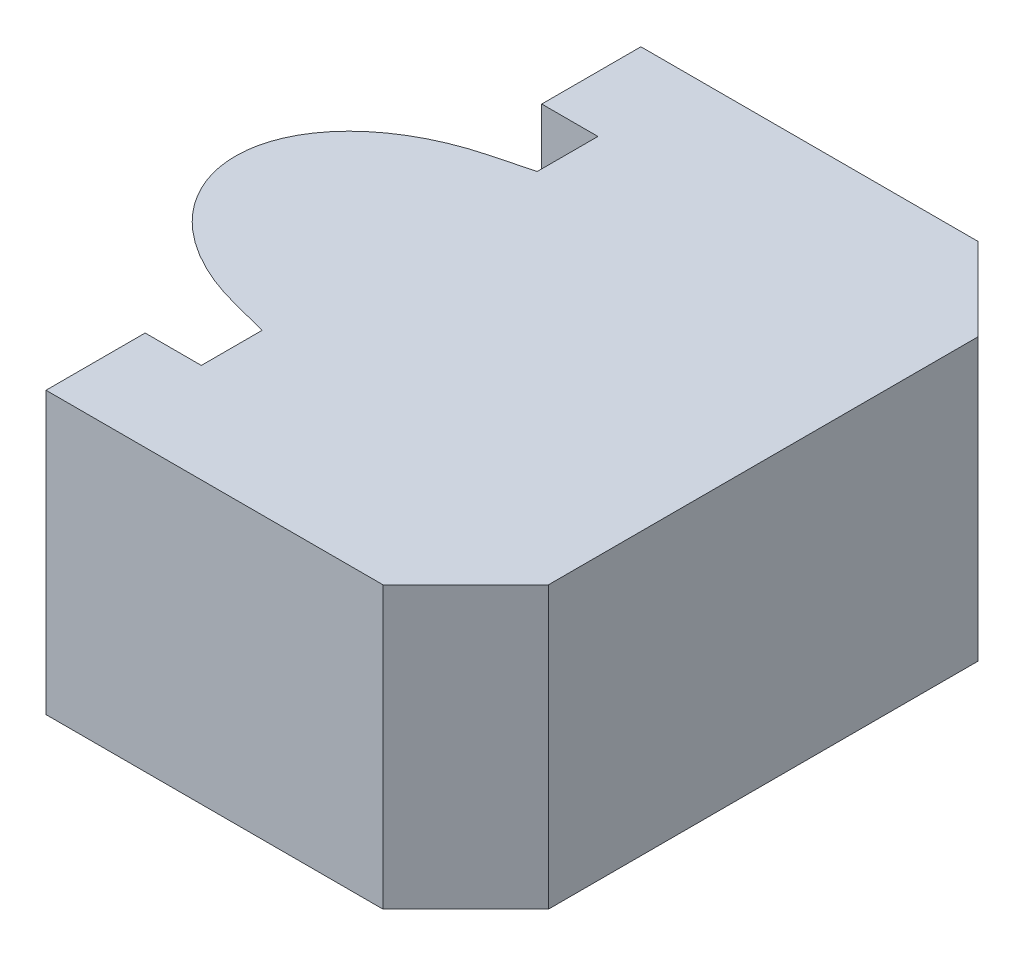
ISO-10303-21;
HEADER;
FILE_DESCRIPTION(('STEP AP214'),'2;1');
FILE_NAME('part.step','',(''),(''),'','','');
FILE_SCHEMA(('AUTOMOTIVE_DESIGN { 1 0 10303 214 1 1 1 1 }'));
ENDSEC;
DATA;
#1=APPLICATION_CONTEXT('core data for automotive mechanical design processes');
#2=APPLICATION_PROTOCOL_DEFINITION('international standard','automotive_design',2000,#1);
#3=PRODUCT_CONTEXT('',#1,'mechanical');
#4=PRODUCT('Part','Part','',(#3));
#5=PRODUCT_RELATED_PRODUCT_CATEGORY('part','',(#4));
#6=PRODUCT_DEFINITION_FORMATION('','',#4);
#7=PRODUCT_DEFINITION_CONTEXT('part definition',#1,'design');
#8=PRODUCT_DEFINITION('design','',#6,#7);
#9=PRODUCT_DEFINITION_SHAPE('','',#8);
#10=(LENGTH_UNIT() NAMED_UNIT(*) SI_UNIT(.MILLI.,.METRE.));
#11=(NAMED_UNIT(*) PLANE_ANGLE_UNIT() SI_UNIT($,.RADIAN.));
#12=(NAMED_UNIT(*) SI_UNIT($,.STERADIAN.) SOLID_ANGLE_UNIT());
#13=UNCERTAINTY_MEASURE_WITH_UNIT(LENGTH_MEASURE(1.E-05),#10,'distance_accuracy_value','');
#14=(GEOMETRIC_REPRESENTATION_CONTEXT(3) GLOBAL_UNCERTAINTY_ASSIGNED_CONTEXT((#13)) GLOBAL_UNIT_ASSIGNED_CONTEXT((#10,
#11,#12)) REPRESENTATION_CONTEXT('',''));
#15=CARTESIAN_POINT('',(0.,0.,0.));
#16=DIRECTION('',(0.,0.,1.));
#17=DIRECTION('',(1.,0.,0.));
#18=AXIS2_PLACEMENT_3D('',#15,#16,#17);
#19=CARTESIAN_POINT('',(-21.6603765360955,-8.5,10.766004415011));
#20=DIRECTION('',(1.,0.,0.));
#21=DIRECTION('',(0.,0.,-1.));
#22=AXIS2_PLACEMENT_3D('',#19,#20,#21);
#23=PLANE('',#22);
#24=DIRECTION('',(0.,0.,-1.));
#25=VECTOR('',#24,1.);
#26=CARTESIAN_POINT('',(-21.6603765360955,-3.,-1.23399558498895));
#27=LINE('',#26,#25);
#28=CARTESIAN_POINT('',(-21.6603765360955,-3.,10.766004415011));
#29=VERTEX_POINT('',#28);
#30=CARTESIAN_POINT('',(-21.6603765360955,-3.,8.92947311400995));
#31=VERTEX_POINT('',#30);
#32=EDGE_CURVE('E217',#29,#31,#27,.T.);
#33=ORIENTED_EDGE('',*,*,#32,.T.);
#34=DIRECTION('',(0.,0.967111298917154,0.254353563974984));
#35=VECTOR('',#34,1.);
#36=CARTESIAN_POINT('',(-21.6603765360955,-5.663596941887,8.22893805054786));
#37=LINE('',#36,#35);
#38=CARTESIAN_POINT('',(-21.6603765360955,-4.18362732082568,8.61817509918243));
#39=VERTEX_POINT('',#38);
#40=EDGE_CURVE('E37',#31,#39,#37,.F.);
#41=ORIENTED_EDGE('',*,*,#40,.T.);
#42=CARTESIAN_POINT('',(-21.6603765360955,-2.15735931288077,4.76600441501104));
#43=DIRECTION('',(1.,0.,0.));
#44=DIRECTION('',(0.,-1.,0.));
#45=AXIS2_PLACEMENT_3D('',#42,#43,#44);
#46=ELLIPSE('',#45,5.81241774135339,4.11);
#47=CARTESIAN_POINT('',(-21.6603765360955,-4.18362732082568,0.913833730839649));
#48=VERTEX_POINT('',#47);
#49=EDGE_CURVE('E48',#39,#48,#46,.T.);
#50=ORIENTED_EDGE('',*,*,#49,.T.);
#51=DIRECTION('',(0.,-0.967111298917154,0.254353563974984));
#52=VECTOR('',#51,1.);
#53=CARTESIAN_POINT('',(-21.6603765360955,-3.41528904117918,0.711758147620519));
#54=LINE('',#53,#52);
#55=CARTESIAN_POINT('',(-21.6603765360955,-3.,0.602535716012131));
#56=VERTEX_POINT('',#55);
#57=EDGE_CURVE('E201',#48,#56,#54,.F.);
#58=ORIENTED_EDGE('',*,*,#57,.T.);
#59=CARTESIAN_POINT('',(-21.6603765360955,-3.,-1.23399558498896));
#60=VERTEX_POINT('',#59);
#61=EDGE_CURVE('E206',#56,#60,#27,.T.);
#62=ORIENTED_EDGE('',*,*,#61,.T.);
#63=DIRECTION('',(0.,1.,0.));
#64=VECTOR('',#63,1.);
#65=CARTESIAN_POINT('',(-21.6603765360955,-8.5,-1.23399558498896));
#66=LINE('',#65,#64);
#67=CARTESIAN_POINT('',(-21.6603765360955,-8.5,-1.23399558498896));
#68=VERTEX_POINT('',#67);
#69=EDGE_CURVE('E331',#68,#60,#66,.T.);
#70=ORIENTED_EDGE('',*,*,#69,.F.);
#71=DIRECTION('',(0.,0.,-1.));
#72=VECTOR('',#71,1.);
#73=CARTESIAN_POINT('',(-21.6603765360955,-8.5,10.766004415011));
#74=LINE('',#73,#72);
#75=CARTESIAN_POINT('',(-21.6603765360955,-8.5,10.766004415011));
#76=VERTEX_POINT('',#75);
#77=EDGE_CURVE('E308',#76,#68,#74,.T.);
#78=ORIENTED_EDGE('',*,*,#77,.F.);
#79=DIRECTION('',(0.,1.,0.));
#80=VECTOR('',#79,1.);
#81=CARTESIAN_POINT('',(-21.6603765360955,-8.5,10.766004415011));
#82=LINE('',#81,#80);
#83=EDGE_CURVE('E333',#76,#29,#82,.T.);
#84=ORIENTED_EDGE('',*,*,#83,.T.);
#85=EDGE_LOOP('',(#33,#41,#50,#58,#62,#70,#78,#84));
#86=FACE_BOUND('',#85,.T.);
#87=ADVANCED_FACE('F29',(#86),#23,.F.);
#88=CARTESIAN_POINT('',(-24.6603765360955,-3.,10.766004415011));
#89=DIRECTION('',(0.,0.,1.));
#90=DIRECTION('',(1.,0.,0.));
#91=AXIS2_PLACEMENT_3D('',#88,#89,#90);
#92=CYLINDRICAL_SURFACE('',#91,3.);
#93=DIRECTION('',(0.,0.,-1.));
#94=VECTOR('',#93,1.);
#95=CARTESIAN_POINT('',(-24.6603765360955,0.,10.766004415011));
#96=LINE('',#95,#94);
#97=CARTESIAN_POINT('',(-24.6603765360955,0.,8.92947311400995));
#98=VERTEX_POINT('',#97);
#99=CARTESIAN_POINT('',(-24.6603765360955,0.,10.766004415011));
#100=VERTEX_POINT('',#99);
#101=EDGE_CURVE('E339',#98,#100,#96,.F.);
#102=ORIENTED_EDGE('',*,*,#101,.F.);
#103=CARTESIAN_POINT('',(-24.6603765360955,-3.,8.69277005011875));
#104=DIRECTION('',(-0.0784143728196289,-0.0784143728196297,0.993832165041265));
#105=DIRECTION('',(0.702745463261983,0.70274546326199,0.1108946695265));
#106=AXIS2_PLACEMENT_3D('',#103,#104,#105);
#107=ELLIPSE('',#106,3.01861833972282,3.);
#108=EDGE_CURVE('E199',#98,#31,#107,.F.);
#109=ORIENTED_EDGE('',*,*,#108,.T.);
#110=ORIENTED_EDGE('',*,*,#32,.F.);
#111=CARTESIAN_POINT('',(-24.6603765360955,-3.,10.766004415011));
#112=DIRECTION('',(0.,0.,1.));
#113=DIRECTION('',(1.,0.,0.));
#114=AXIS2_PLACEMENT_3D('',#111,#112,#113);
#115=CIRCLE('',#114,3.);
#116=EDGE_CURVE('E341',#100,#29,#115,.F.);
#117=ORIENTED_EDGE('',*,*,#116,.F.);
#118=EDGE_LOOP('',(#102,#109,#110,#117));
#119=FACE_BOUND('',#118,.T.);
#120=ADVANCED_FACE('F247',(#119),#92,.F.);
#121=ORIENTED_EDGE('',*,*,#61,.F.);
#122=CARTESIAN_POINT('',(-24.6603765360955,-3.,0.839238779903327));
#123=DIRECTION('',(-0.0784143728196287,-0.0784143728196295,-0.993832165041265));
#124=DIRECTION('',(-0.702745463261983,-0.70274546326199,0.1108946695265));
#125=AXIS2_PLACEMENT_3D('',#122,#123,#124);
#126=ELLIPSE('',#125,3.01861833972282,3.);
#127=CARTESIAN_POINT('',(-24.6603765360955,0.,0.602535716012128));
#128=VERTEX_POINT('',#127);
#129=EDGE_CURVE('E11',#56,#128,#126,.F.);
#130=ORIENTED_EDGE('',*,*,#129,.T.);
#131=CARTESIAN_POINT('',(-24.6603765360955,0.,-1.23399558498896));
#132=VERTEX_POINT('',#131);
#133=EDGE_CURVE('E165',#132,#128,#96,.F.);
#134=ORIENTED_EDGE('',*,*,#133,.F.);
#135=CARTESIAN_POINT('',(-24.6603765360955,-3.,-1.23399558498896));
#136=DIRECTION('',(0.,0.,-1.));
#137=DIRECTION('',(-1.,0.,0.));
#138=AXIS2_PLACEMENT_3D('',#135,#136,#137);
#139=CIRCLE('',#138,3.);
#140=EDGE_CURVE('E215',#60,#132,#139,.F.);
#141=ORIENTED_EDGE('',*,*,#140,.F.);
#142=EDGE_LOOP('',(#121,#130,#134,#141));
#143=FACE_BOUND('',#142,.T.);
#144=ADVANCED_FACE('F212',(#143),#92,.F.);
#145=CARTESIAN_POINT('',(-26.3603765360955,-8.5,13.766004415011));
#146=DIRECTION('',(1.,0.,0.));
#147=DIRECTION('',(0.,0.,-1.));
#148=AXIS2_PLACEMENT_3D('',#145,#146,#147);
#149=PLANE('',#148);
#150=DIRECTION('',(0.,0.,-1.));
#151=VECTOR('',#150,1.);
#152=CARTESIAN_POINT('',(-26.3603765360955,0.,13.766004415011));
#153=LINE('',#152,#151);
#154=CARTESIAN_POINT('',(-26.3603765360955,0.,13.766004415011));
#155=VERTEX_POINT('',#154);
#156=CARTESIAN_POINT('',(-26.3603765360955,0.,10.766004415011));
#157=VERTEX_POINT('',#156);
#158=EDGE_CURVE('E282',#155,#157,#153,.T.);
#159=ORIENTED_EDGE('',*,*,#158,.T.);
#160=DIRECTION('',(0.,1.,0.));
#161=VECTOR('',#160,1.);
#162=CARTESIAN_POINT('',(-26.3603765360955,-8.5,10.766004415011));
#163=LINE('',#162,#161);
#164=CARTESIAN_POINT('',(-26.3603765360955,-8.5,10.766004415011));
#165=VERTEX_POINT('',#164);
#166=EDGE_CURVE('E218',#165,#157,#163,.T.);
#167=ORIENTED_EDGE('',*,*,#166,.F.);
#168=DIRECTION('',(0.,0.,-1.));
#169=VECTOR('',#168,1.);
#170=CARTESIAN_POINT('',(-26.3603765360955,-8.5,13.766004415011));
#171=LINE('',#170,#169);
#172=CARTESIAN_POINT('',(-26.3603765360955,-8.5,13.766004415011));
#173=VERTEX_POINT('',#172);
#174=EDGE_CURVE('E303',#173,#165,#171,.T.);
#175=ORIENTED_EDGE('',*,*,#174,.F.);
#176=DIRECTION('',(0.,1.,0.));
#177=VECTOR('',#176,1.);
#178=CARTESIAN_POINT('',(-26.3603765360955,-8.5,13.766004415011));
#179=LINE('',#178,#177);
#180=EDGE_CURVE('E322',#173,#155,#179,.T.);
#181=ORIENTED_EDGE('',*,*,#180,.T.);
#182=EDGE_LOOP('',(#159,#167,#175,#181));
#183=FACE_BOUND('',#182,.T.);
#184=ADVANCED_FACE('F402',(#183),#149,.F.);
#185=CARTESIAN_POINT('',(-26.3603765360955,-8.5,10.766004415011));
#186=DIRECTION('',(0.,0.,1.));
#187=DIRECTION('',(1.,0.,0.));
#188=AXIS2_PLACEMENT_3D('',#185,#186,#187);
#189=PLANE('',#188);
#190=DIRECTION('',(1.,0.,0.));
#191=VECTOR('',#190,1.);
#192=CARTESIAN_POINT('',(-26.3603765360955,0.,10.766004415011));
#193=LINE('',#192,#191);
#194=EDGE_CURVE('E285',#157,#100,#193,.T.);
#195=ORIENTED_EDGE('',*,*,#194,.T.);
#196=ORIENTED_EDGE('',*,*,#116,.T.);
#197=ORIENTED_EDGE('',*,*,#83,.F.);
#198=DIRECTION('',(1.,0.,0.));
#199=VECTOR('',#198,1.);
#200=CARTESIAN_POINT('',(-26.3603765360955,-8.5,10.766004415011));
#201=LINE('',#200,#199);
#202=EDGE_CURVE('E306',#165,#76,#201,.T.);
#203=ORIENTED_EDGE('',*,*,#202,.F.);
#204=ORIENTED_EDGE('',*,*,#166,.T.);
#205=EDGE_LOOP('',(#195,#196,#197,#203,#204));
#206=FACE_BOUND('',#205,.T.);
#207=ADVANCED_FACE('F394',(#206),#189,.F.);
#208=CARTESIAN_POINT('',(-21.6603765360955,-8.5,-1.23399558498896));
#209=DIRECTION('',(0.,0.,-1.));
#210=DIRECTION('',(-1.,0.,0.));
#211=AXIS2_PLACEMENT_3D('',#208,#209,#210);
#212=PLANE('',#211);
#213=ORIENTED_EDGE('',*,*,#69,.T.);
#214=ORIENTED_EDGE('',*,*,#140,.T.);
#215=DIRECTION('',(-1.,0.,0.));
#216=VECTOR('',#215,1.);
#217=CARTESIAN_POINT('',(-21.6603765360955,0.,-1.23399558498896));
#218=LINE('',#217,#216);
#219=CARTESIAN_POINT('',(-26.3603765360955,0.,-1.23399558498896));
#220=VERTEX_POINT('',#219);
#221=EDGE_CURVE('E288',#132,#220,#218,.T.);
#222=ORIENTED_EDGE('',*,*,#221,.T.);
#223=DIRECTION('',(0.,1.,0.));
#224=VECTOR('',#223,1.);
#225=CARTESIAN_POINT('',(-26.3603765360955,-8.5,-1.23399558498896));
#226=LINE('',#225,#224);
#227=CARTESIAN_POINT('',(-26.3603765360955,-8.5,-1.23399558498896));
#228=VERTEX_POINT('',#227);
#229=EDGE_CURVE('E328',#228,#220,#226,.T.);
#230=ORIENTED_EDGE('',*,*,#229,.F.);
#231=DIRECTION('',(-1.,0.,0.));
#232=VECTOR('',#231,1.);
#233=CARTESIAN_POINT('',(-21.6603765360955,-8.5,-1.23399558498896));
#234=LINE('',#233,#232);
#235=EDGE_CURVE('E310',#68,#228,#234,.T.);
#236=ORIENTED_EDGE('',*,*,#235,.F.);
#237=EDGE_LOOP('',(#213,#214,#222,#230,#236));
#238=FACE_BOUND('',#237,.T.);
#239=ADVANCED_FACE('F430',(#238),#212,.F.);
#240=CARTESIAN_POINT('',(-26.3603765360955,-8.5,-4.23399558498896));
#241=DIRECTION('',(1.,0.,0.));
#242=DIRECTION('',(0.,0.,-1.));
#243=AXIS2_PLACEMENT_3D('',#240,#241,#242);
#244=PLANE('',#243);
#245=DIRECTION('',(0.,0.,-1.));
#246=VECTOR('',#245,1.);
#247=CARTESIAN_POINT('',(-26.3603765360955,0.,-4.23399558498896));
#248=LINE('',#247,#246);
#249=CARTESIAN_POINT('',(-26.3603765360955,0.,-4.23399558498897));
#250=VERTEX_POINT('',#249);
#251=EDGE_CURVE('E291',#220,#250,#248,.T.);
#252=ORIENTED_EDGE('',*,*,#251,.T.);
#253=DIRECTION('',(0.,1.,0.));
#254=VECTOR('',#253,1.);
#255=CARTESIAN_POINT('',(-26.3603765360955,-8.5,-4.23399558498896));
#256=LINE('',#255,#254);
#257=CARTESIAN_POINT('',(-26.3603765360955,-8.5,-4.23399558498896));
#258=VERTEX_POINT('',#257);
#259=EDGE_CURVE('E325',#258,#250,#256,.T.);
#260=ORIENTED_EDGE('',*,*,#259,.F.);
#261=DIRECTION('',(0.,0.,-1.));
#262=VECTOR('',#261,1.);
#263=CARTESIAN_POINT('',(-26.3603765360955,-8.5,-4.23399558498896));
#264=LINE('',#263,#262);
#265=EDGE_CURVE('E312',#228,#258,#264,.T.);
#266=ORIENTED_EDGE('',*,*,#265,.F.);
#267=ORIENTED_EDGE('',*,*,#229,.T.);
#268=EDGE_LOOP('',(#252,#260,#266,#267));
#269=FACE_BOUND('',#268,.T.);
#270=ADVANCED_FACE('F428',(#269),#244,.F.);
#271=CARTESIAN_POINT('',(-26.3603765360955,-8.5,-4.23399558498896));
#272=DIRECTION('',(0.,0.,1.));
#273=DIRECTION('',(1.,0.,0.));
#274=AXIS2_PLACEMENT_3D('',#271,#272,#273);
#275=PLANE('',#274);
#276=DIRECTION('',(1.,0.,0.));
#277=VECTOR('',#276,1.);
#278=CARTESIAN_POINT('',(-26.3603765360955,0.,-4.23399558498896));
#279=LINE('',#278,#277);
#280=CARTESIAN_POINT('',(-16.1603765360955,0.,-4.23399558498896));
#281=VERTEX_POINT('',#280);
#282=EDGE_CURVE('E294',#250,#281,#279,.T.);
#283=ORIENTED_EDGE('',*,*,#282,.T.);
#284=DIRECTION('',(0.,-1.,0.));
#285=VECTOR('',#284,1.);
#286=CARTESIAN_POINT('',(-16.1603765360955,-8.5,-4.23399558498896));
#287=LINE('',#286,#285);
#288=CARTESIAN_POINT('',(-16.1603765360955,-8.5,-4.23399558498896));
#289=VERTEX_POINT('',#288);
#290=EDGE_CURVE('E355',#281,#289,#287,.T.);
#291=ORIENTED_EDGE('',*,*,#290,.T.);
#292=DIRECTION('',(1.,0.,0.));
#293=VECTOR('',#292,1.);
#294=CARTESIAN_POINT('',(-26.3603765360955,-8.5,-4.23399558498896));
#295=LINE('',#294,#293);
#296=EDGE_CURVE('E314',#258,#289,#295,.T.);
#297=ORIENTED_EDGE('',*,*,#296,.F.);
#298=ORIENTED_EDGE('',*,*,#259,.T.);
#299=EDGE_LOOP('',(#283,#291,#297,#298));
#300=FACE_BOUND('',#299,.T.);
#301=ADVANCED_FACE('F423',(#300),#275,.F.);
#302=CARTESIAN_POINT('',(-13.6603765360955,-8.5,13.766004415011));
#303=DIRECTION('',(-1.,0.,0.));
#304=DIRECTION('',(0.,0.,1.));
#305=AXIS2_PLACEMENT_3D('',#302,#303,#304);
#306=PLANE('',#305);
#307=DIRECTION('',(0.,0.,1.));
#308=VECTOR('',#307,1.);
#309=CARTESIAN_POINT('',(-13.6603765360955,0.,13.766004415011));
#310=LINE('',#309,#308);
#311=CARTESIAN_POINT('',(-13.6603765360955,0.,-1.73399558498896));
#312=VERTEX_POINT('',#311);
#313=CARTESIAN_POINT('',(-13.6603765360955,0.,11.266004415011));
#314=VERTEX_POINT('',#313);
#315=EDGE_CURVE('E297',#312,#314,#310,.T.);
#316=ORIENTED_EDGE('',*,*,#315,.T.);
#317=DIRECTION('',(0.,-1.,0.));
#318=VECTOR('',#317,1.);
#319=CARTESIAN_POINT('',(-13.6603765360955,-8.5,11.266004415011));
#320=LINE('',#319,#318);
#321=CARTESIAN_POINT('',(-13.6603765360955,-8.5,11.266004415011));
#322=VERTEX_POINT('',#321);
#323=EDGE_CURVE('E349',#314,#322,#320,.T.);
#324=ORIENTED_EDGE('',*,*,#323,.T.);
#325=DIRECTION('',(0.,0.,1.));
#326=VECTOR('',#325,1.);
#327=CARTESIAN_POINT('',(-13.6603765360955,-8.5,13.766004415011));
#328=LINE('',#327,#326);
#329=CARTESIAN_POINT('',(-13.6603765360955,-8.5,-1.73399558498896));
#330=VERTEX_POINT('',#329);
#331=EDGE_CURVE('E317',#330,#322,#328,.T.);
#332=ORIENTED_EDGE('',*,*,#331,.F.);
#333=DIRECTION('',(0.,1.,0.));
#334=VECTOR('',#333,1.);
#335=CARTESIAN_POINT('',(-13.6603765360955,-8.5,-1.73399558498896));
#336=LINE('',#335,#334);
#337=EDGE_CURVE('E346',#330,#312,#336,.T.);
#338=ORIENTED_EDGE('',*,*,#337,.T.);
#339=EDGE_LOOP('',(#316,#324,#332,#338));
#340=FACE_BOUND('',#339,.T.);
#341=ADVANCED_FACE('F415',(#340),#306,.F.);
#342=CARTESIAN_POINT('',(-26.3603765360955,-8.5,13.766004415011));
#343=DIRECTION('',(0.,0.,-1.));
#344=DIRECTION('',(-1.,0.,0.));
#345=AXIS2_PLACEMENT_3D('',#342,#343,#344);
#346=PLANE('',#345);
#347=DIRECTION('',(-1.,0.,0.));
#348=VECTOR('',#347,1.);
#349=CARTESIAN_POINT('',(-26.3603765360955,-8.5,13.766004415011));
#350=LINE('',#349,#348);
#351=CARTESIAN_POINT('',(-16.1603765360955,-8.5,13.766004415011));
#352=VERTEX_POINT('',#351);
#353=EDGE_CURVE('E320',#352,#173,#350,.T.);
#354=ORIENTED_EDGE('',*,*,#353,.F.);
#355=DIRECTION('',(0.,1.,0.));
#356=VECTOR('',#355,1.);
#357=CARTESIAN_POINT('',(-16.1603765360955,-8.5,13.766004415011));
#358=LINE('',#357,#356);
#359=CARTESIAN_POINT('',(-16.1603765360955,0.,13.766004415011));
#360=VERTEX_POINT('',#359);
#361=EDGE_CURVE('E343',#352,#360,#358,.T.);
#362=ORIENTED_EDGE('',*,*,#361,.T.);
#363=DIRECTION('',(-1.,0.,0.));
#364=VECTOR('',#363,1.);
#365=CARTESIAN_POINT('',(-26.3603765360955,0.,13.766004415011));
#366=LINE('',#365,#364);
#367=EDGE_CURVE('E300',#360,#155,#366,.T.);
#368=ORIENTED_EDGE('',*,*,#367,.T.);
#369=ORIENTED_EDGE('',*,*,#180,.F.);
#370=EDGE_LOOP('',(#354,#362,#368,#369));
#371=FACE_BOUND('',#370,.T.);
#372=ADVANCED_FACE('F407',(#371),#346,.F.);
#373=CARTESIAN_POINT('',(-26.3603765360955,-8.5,10.766004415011));
#374=DIRECTION('',(0.,-1.,0.));
#375=DIRECTION('',(0.,0.,-1.));
#376=AXIS2_PLACEMENT_3D('',#373,#374,#375);
#377=PLANE('',#376);
#378=ORIENTED_EDGE('',*,*,#331,.T.);
#379=DIRECTION('',(0.707106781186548,0.,-0.707106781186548));
#380=VECTOR('',#379,1.);
#381=CARTESIAN_POINT('',(-19.7603765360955,-8.5,17.366004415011));
#382=LINE('',#381,#380);
#383=EDGE_CURVE('E353',#322,#352,#382,.F.);
#384=ORIENTED_EDGE('',*,*,#383,.T.);
#385=ORIENTED_EDGE('',*,*,#353,.T.);
#386=ORIENTED_EDGE('',*,*,#174,.T.);
#387=ORIENTED_EDGE('',*,*,#202,.T.);
#388=ORIENTED_EDGE('',*,*,#77,.T.);
#389=ORIENTED_EDGE('',*,*,#235,.T.);
#390=ORIENTED_EDGE('',*,*,#265,.T.);
#391=ORIENTED_EDGE('',*,*,#296,.T.);
#392=DIRECTION('',(-0.707106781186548,0.,-0.707106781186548));
#393=VECTOR('',#392,1.);
#394=CARTESIAN_POINT('',(-13.7603765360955,-8.5,-1.83399558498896));
#395=LINE('',#394,#393);
#396=EDGE_CURVE('E351',#289,#330,#395,.F.);
#397=ORIENTED_EDGE('',*,*,#396,.T.);
#398=EDGE_LOOP('',(#378,#384,#385,#386,#387,#388,#389,#390,#391,#397));
#399=FACE_BOUND('',#398,.T.);
#400=ADVANCED_FACE('F254',(#399),#377,.T.);
#401=CARTESIAN_POINT('',(-33.6811918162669,7.76345596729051,4.76600441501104));
#402=DIRECTION('',(0.707106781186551,-0.707106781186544,0.));
#403=DIRECTION('',(0.707106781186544,0.707106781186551,0.));
#404=AXIS2_PLACEMENT_3D('',#401,#402,#403);
#405=CYLINDRICAL_SURFACE('',#404,2.01);
#406=DIRECTION('',(0.707106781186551,-0.707106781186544,0.));
#407=VECTOR('',#406,1.);
#408=CARTESIAN_POINT('',(-34.1766661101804,7.26798167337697,6.64991270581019));
#409=LINE('',#408,#407);
#410=CARTESIAN_POINT('',(-25.3263441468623,-1.58234028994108,6.64991270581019));
#411=VERTEX_POINT('',#410);
#412=CARTESIAN_POINT('',(-23.2427168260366,-3.66596761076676,6.64991270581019));
#413=VERTEX_POINT('',#412);
#414=EDGE_CURVE('E279',#411,#413,#409,.T.);
#415=ORIENTED_EDGE('',*,*,#414,.F.);
#416=CARTESIAN_POINT('',(-23.8177358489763,-2.1,4.76600441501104));
#417=DIRECTION('',(-0.324561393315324,-0.945864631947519,0.));
#418=DIRECTION('',(0.945864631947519,-0.324561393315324,0.));
#419=AXIS2_PLACEMENT_3D('',#416,#417,#418);
#420=ELLIPSE('',#419,4.57517212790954,2.01);
#421=CARTESIAN_POINT('',(-25.3263441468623,-1.58234028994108,2.88209612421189));
#422=VERTEX_POINT('',#421);
#423=EDGE_CURVE('E191',#411,#422,#420,.T.);
#424=ORIENTED_EDGE('',*,*,#423,.T.);
#425=DIRECTION('',(0.707106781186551,-0.707106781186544,0.));
#426=VECTOR('',#425,1.);
#427=CARTESIAN_POINT('',(-34.1766661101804,7.26798167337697,2.88209612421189));
#428=LINE('',#427,#426);
#429=CARTESIAN_POINT('',(-23.2427168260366,-3.66596761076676,2.88209612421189));
#430=VERTEX_POINT('',#429);
#431=EDGE_CURVE('E276',#422,#430,#428,.T.);
#432=ORIENTED_EDGE('',*,*,#431,.T.);
#433=CARTESIAN_POINT('',(-23.7603765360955,-2.15735931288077,4.76600441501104));
#434=DIRECTION('',(-0.945864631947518,-0.324561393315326,0.));
#435=DIRECTION('',(0.324561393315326,-0.945864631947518,0.));
#436=AXIS2_PLACEMENT_3D('',#433,#434,#435);
#437=ELLIPSE('',#436,4.57517212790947,2.01);
#438=EDGE_CURVE('E168',#430,#413,#437,.T.);
#439=ORIENTED_EDGE('',*,*,#438,.T.);
#440=EDGE_LOOP('',(#415,#424,#432,#439));
#441=FACE_BOUND('',#440,.T.);
#442=ADVANCED_FACE('F252',(#441),#405,.T.);
#443=CARTESIAN_POINT('',(-34.1766661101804,7.26798167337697,6.64991270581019));
#444=DIRECTION('',(0.24650462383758,0.246504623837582,-0.937267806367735));
#445=DIRECTION('',(0.,0.967111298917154,0.254353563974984));
#446=AXIS2_PLACEMENT_3D('',#443,#444,#445);
#447=PLANE('',#446);
#448=CARTESIAN_POINT('',(-24.1427168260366,-2.48234028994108,6.72450765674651));
#449=DIRECTION('',(0.24650462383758,0.246504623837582,-0.937267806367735));
#450=DIRECTION('',(0.662748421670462,0.662748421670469,0.348610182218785));
#451=AXIS2_PLACEMENT_3D('',#448,#449,#450);
#452=ELLIPSE('',#451,0.960237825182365,0.9);
#453=CARTESIAN_POINT('',(-23.2427168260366,-2.48234028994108,6.9612107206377));
#454=VERTEX_POINT('',#453);
#455=CARTESIAN_POINT('',(-24.1427168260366,-1.58234028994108,6.96121072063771));
#456=VERTEX_POINT('',#455);
#457=EDGE_CURVE('E195',#454,#456,#452,.F.);
#458=ORIENTED_EDGE('',*,*,#457,.T.);
#459=DIRECTION('',(-0.967111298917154,0.,-0.254353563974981));
#460=VECTOR('',#459,1.);
#461=CARTESIAN_POINT('',(-26.8063137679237,-1.58234028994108,6.26067565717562));
#462=LINE('',#461,#460);
#463=EDGE_CURVE('E197',#456,#411,#462,.T.);
#464=ORIENTED_EDGE('',*,*,#463,.T.);
#465=ORIENTED_EDGE('',*,*,#414,.T.);
#466=DIRECTION('',(0.,0.967111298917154,0.254353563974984));
#467=VECTOR('',#466,1.);
#468=CARTESIAN_POINT('',(-23.2427168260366,-2.89762933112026,6.85198828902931));
#469=LINE('',#468,#467);
#470=EDGE_CURVE('E193',#413,#454,#469,.T.);
#471=ORIENTED_EDGE('',*,*,#470,.T.);
#472=EDGE_LOOP('',(#458,#464,#465,#471));
#473=FACE_BOUND('',#472,.T.);
#474=ADVANCED_FACE('F270',(#473),#447,.F.);
#475=CARTESIAN_POINT('',(-34.1766661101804,7.26798167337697,2.88209612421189));
#476=DIRECTION('',(0.24650462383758,0.246504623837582,0.937267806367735));
#477=DIRECTION('',(0.,-0.967111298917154,0.254353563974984));
#478=AXIS2_PLACEMENT_3D('',#475,#476,#477);
#479=PLANE('',#478);
#480=ORIENTED_EDGE('',*,*,#431,.F.);
#481=DIRECTION('',(0.967111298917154,0.,-0.254353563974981));
#482=VECTOR('',#481,1.);
#483=CARTESIAN_POINT('',(-24.5580058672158,-1.58234028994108,2.68002054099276));
#484=LINE('',#483,#482);
#485=CARTESIAN_POINT('',(-24.1427168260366,-1.58234028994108,2.57079810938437));
#486=VERTEX_POINT('',#485);
#487=EDGE_CURVE('E175',#422,#486,#484,.T.);
#488=ORIENTED_EDGE('',*,*,#487,.T.);
#489=CARTESIAN_POINT('',(-24.1427168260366,-2.48234028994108,2.80750117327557));
#490=DIRECTION('',(0.24650462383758,0.246504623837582,0.937267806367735));
#491=DIRECTION('',(-0.662748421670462,-0.662748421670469,0.348610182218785));
#492=AXIS2_PLACEMENT_3D('',#489,#490,#491);
#493=ELLIPSE('',#492,0.960237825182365,0.9);
#494=CARTESIAN_POINT('',(-23.2427168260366,-2.48234028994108,2.57079810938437));
#495=VERTEX_POINT('',#494);
#496=EDGE_CURVE('E228',#486,#495,#493,.F.);
#497=ORIENTED_EDGE('',*,*,#496,.T.);
#498=DIRECTION('',(0.,-0.967111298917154,0.254353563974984));
#499=VECTOR('',#498,1.);
#500=CARTESIAN_POINT('',(-23.2427168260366,-5.14593723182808,3.27133317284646));
#501=LINE('',#500,#499);
#502=EDGE_CURVE('E223',#495,#430,#501,.T.);
#503=ORIENTED_EDGE('',*,*,#502,.T.);
#504=EDGE_LOOP('',(#480,#488,#497,#503));
#505=FACE_BOUND('',#504,.T.);
#506=ADVANCED_FACE('F243',(#505),#479,.F.);
#507=CARTESIAN_POINT('',(-16.1603765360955,-8.5,13.766004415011));
#508=DIRECTION('',(-0.707106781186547,0.,-0.707106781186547));
#509=DIRECTION('',(-0.707106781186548,0.,0.707106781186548));
#510=AXIS2_PLACEMENT_3D('',#507,#508,#509);
#511=PLANE('',#510);
#512=ORIENTED_EDGE('',*,*,#383,.F.);
#513=ORIENTED_EDGE('',*,*,#323,.F.);
#514=DIRECTION('',(-0.707106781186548,0.,0.707106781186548));
#515=VECTOR('',#514,1.);
#516=CARTESIAN_POINT('',(-40.2188472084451,0.,37.8244750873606));
#517=LINE('',#516,#515);
#518=EDGE_CURVE('E357',#360,#314,#517,.F.);
#519=ORIENTED_EDGE('',*,*,#518,.F.);
#520=ORIENTED_EDGE('',*,*,#361,.F.);
#521=EDGE_LOOP('',(#512,#513,#519,#520));
#522=FACE_BOUND('',#521,.T.);
#523=ADVANCED_FACE('F411',(#522),#511,.F.);
#524=CARTESIAN_POINT('',(-13.6603765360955,-8.5,-1.73399558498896));
#525=DIRECTION('',(-0.707106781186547,0.,0.707106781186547));
#526=DIRECTION('',(0.707106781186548,0.,0.707106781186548));
#527=AXIS2_PLACEMENT_3D('',#524,#525,#526);
#528=PLANE('',#527);
#529=ORIENTED_EDGE('',*,*,#396,.F.);
#530=ORIENTED_EDGE('',*,*,#290,.F.);
#531=DIRECTION('',(0.707106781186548,0.,0.707106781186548));
#532=VECTOR('',#531,1.);
#533=CARTESIAN_POINT('',(-11.6228207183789,0.,0.303560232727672));
#534=LINE('',#533,#532);
#535=EDGE_CURVE('E359',#312,#281,#534,.F.);
#536=ORIENTED_EDGE('',*,*,#535,.F.);
#537=ORIENTED_EDGE('',*,*,#337,.F.);
#538=EDGE_LOOP('',(#529,#530,#536,#537));
#539=FACE_BOUND('',#538,.T.);
#540=ADVANCED_FACE('F420',(#539),#528,.F.);
#541=CARTESIAN_POINT('',(-23.7603765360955,6.04294207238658,11.3077976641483));
#542=DIRECTION('',(0.,-0.967111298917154,-0.254353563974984));
#543=DIRECTION('',(0.,0.254353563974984,-0.967111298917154));
#544=AXIS2_PLACEMENT_3D('',#541,#542,#543);
#545=CYLINDRICAL_SURFACE('',#544,2.1);
#546=CARTESIAN_POINT('',(-23.7603765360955,-4.18362732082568,8.61817509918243));
#547=DIRECTION('',(0.,0.967111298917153,0.254353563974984));
#548=DIRECTION('',(0.,-0.254353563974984,0.967111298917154));
#549=AXIS2_PLACEMENT_3D('',#546,#547,#548);
#550=CIRCLE('',#549,2.1);
#551=EDGE_CURVE('E370',#39,#413,#550,.T.);
#552=ORIENTED_EDGE('',*,*,#551,.F.);
#553=ORIENTED_EDGE('',*,*,#40,.F.);
#554=CARTESIAN_POINT('',(-23.7603765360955,-3.,8.92947311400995));
#555=DIRECTION('',(0.,-0.967111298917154,-0.254353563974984));
#556=DIRECTION('',(0.,0.254353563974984,-0.967111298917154));
#557=AXIS2_PLACEMENT_3D('',#554,#555,#556);
#558=CIRCLE('',#557,2.1);
#559=EDGE_CURVE('E275',#454,#31,#558,.T.);
#560=ORIENTED_EDGE('',*,*,#559,.F.);
#561=ORIENTED_EDGE('',*,*,#470,.F.);
#562=EDGE_LOOP('',(#552,#553,#560,#561));
#563=FACE_BOUND('',#562,.T.);
#564=ADVANCED_FACE('F264',(#563),#545,.F.);
#565=CARTESIAN_POINT('',(-22.5390561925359,-0.878679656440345,9.02751873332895));
#566=CARTESIAN_POINT('',(-22.5390561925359,-0.878679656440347,7.56804406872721));
#567=CARTESIAN_POINT('',(-23.5063207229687,-1.84594418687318,7.0592563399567));
#568=CARTESIAN_POINT('',(-22.4464600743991,-0.971275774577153,9.02751873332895));
#569=CARTESIAN_POINT('',(-22.4632150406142,-0.954520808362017,7.56804406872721));
#570=CARTESIAN_POINT('',(-23.4785418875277,-1.87372302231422,7.0592563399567));
#571=CARTESIAN_POINT('',(-22.3599402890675,-1.0699482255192,9.0265598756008));
#572=CARTESIAN_POINT('',(-22.3911962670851,-1.0342966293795,7.56600393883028));
#573=CARTESIAN_POINT('',(-23.4525859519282,-1.90332475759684,7.05829748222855));
#574=CARTESIAN_POINT('',(-22.2005070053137,-1.27772525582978,9.02274550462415));
#575=CARTESIAN_POINT('',(-22.2556375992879,-1.20077630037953,7.55787160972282));
#576=CARTESIAN_POINT('',(-23.4047559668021,-1.96565786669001,7.0544831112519));
#577=CARTESIAN_POINT('',(-22.127625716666,-1.38685363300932,9.01988557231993));
#578=CARTESIAN_POINT('',(-22.1920308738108,-1.28762850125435,7.55175797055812));
#579=CARTESIAN_POINT('',(-23.3828915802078,-1.99839637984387,7.05162317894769));
#580=CARTESIAN_POINT('',(-21.9966822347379,-1.61365333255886,9.01232241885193));
#581=CARTESIAN_POINT('',(-22.0738778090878,-1.46752702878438,7.53551870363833));
#582=CARTESIAN_POINT('',(-23.3436085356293,-2.06643628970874,7.04406002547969));
#583=CARTESIAN_POINT('',(-21.938687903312,-1.731360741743,9.00761099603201));
#584=CARTESIAN_POINT('',(-22.0193161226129,-1.56074613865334,7.52535166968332));
#585=CARTESIAN_POINT('',(-23.3262102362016,-2.10174851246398,7.03934860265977));
#586=CARTESIAN_POINT('',(-21.8384745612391,-1.97329530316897,8.99642904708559));
#587=CARTESIAN_POINT('',(-21.9198153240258,-1.75262458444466,7.50105603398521));
#588=CARTESIAN_POINT('',(-23.2961462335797,-2.17432888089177,7.02816665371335));
#589=CARTESIAN_POINT('',(-21.796356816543,-2.09755872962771,8.98994766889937));
#590=CARTESIAN_POINT('',(-21.8749144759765,-1.8514687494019,7.48686875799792));
#591=CARTESIAN_POINT('',(-23.2835109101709,-2.21160790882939,7.02168527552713));
#592=CARTESIAN_POINT('',(-21.7285852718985,-2.35048249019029,8.97533896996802));
#593=CARTESIAN_POINT('',(-21.7952881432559,-2.05381758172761,7.45459232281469));
#594=CARTESIAN_POINT('',(-23.2631794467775,-2.28748503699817,7.00707657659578));
#595=CARTESIAN_POINT('',(-21.7030587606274,-2.47916902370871,8.96719953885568));
#596=CARTESIAN_POINT('',(-21.7606529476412,-2.15750737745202,7.43643072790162));
#597=CARTESIAN_POINT('',(-23.2555214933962,-2.32609099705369,6.99893714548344));
#598=CARTESIAN_POINT('',(-21.6688834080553,-2.73875038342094,8.94941477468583));
#599=CARTESIAN_POINT('',(-21.7021116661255,-2.3687322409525,7.39627442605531));
#600=CARTESIAN_POINT('',(-23.2452688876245,-2.40396540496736,6.98115238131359));
#601=CARTESIAN_POINT('',(-21.6603769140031,-2.86965467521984,8.93975746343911));
#602=CARTESIAN_POINT('',(-21.6783433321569,-2.47644262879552,7.37419738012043));
#603=CARTESIAN_POINT('',(-23.2427169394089,-2.44323669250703,6.97149507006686));
#604=CARTESIAN_POINT('',(-21.6603761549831,-3.13145071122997,8.91910154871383));
#605=CARTESIAN_POINT('',(-21.6421003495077,-2.69484368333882,7.32628918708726));
#606=CARTESIAN_POINT('',(-23.2427167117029,-2.52177550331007,6.95083915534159));
#607=CARTESIAN_POINT('',(-21.6690267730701,-3.26233293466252,8.90809226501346));
#608=CARTESIAN_POINT('',(-21.6298043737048,-2.80569183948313,7.30036962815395));
#609=CARTESIAN_POINT('',(-23.245311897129,-2.56104017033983,6.93982987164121));
#610=CARTESIAN_POINT('',(-21.7031942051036,-3.52186542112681,8.88491904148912));
#611=CARTESIAN_POINT('',(-21.617089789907,-3.02943409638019,7.24486863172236));
#612=CARTESIAN_POINT('',(-23.255562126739,-2.63889991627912,6.91665664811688));
#613=CARTESIAN_POINT('',(-21.7288463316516,-3.65048920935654,8.87274651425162));
#614=CARTESIAN_POINT('',(-21.6168831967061,-3.14246184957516,7.2151962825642));
#615=CARTESIAN_POINT('',(-23.2632577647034,-2.67748705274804,6.90448412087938));
#616=CARTESIAN_POINT('',(-21.7965918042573,-3.90332084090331,8.84745265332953));
#617=CARTESIAN_POINT('',(-21.6289553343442,-3.36953386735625,7.15230055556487));
#618=CARTESIAN_POINT('',(-23.2835814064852,-2.75333654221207,6.87919025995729));
#619=CARTESIAN_POINT('',(-21.8388007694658,-4.02749077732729,8.83432518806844));
#620=CARTESIAN_POINT('',(-21.6414714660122,-3.48368353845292,7.11898701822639));
#621=CARTESIAN_POINT('',(-23.2962440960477,-2.79058752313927,6.8660627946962));
#622=CARTESIAN_POINT('',(-21.9389611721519,-4.26930044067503,8.80734340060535));
#623=CARTESIAN_POINT('',(-21.6796210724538,-3.71184206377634,7.04894707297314));
#624=CARTESIAN_POINT('',(-23.3262922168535,-2.86313042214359,6.83908100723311));
#625=CARTESIAN_POINT('',(-21.9970014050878,-4.38689868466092,8.79348534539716));
#626=CARTESIAN_POINT('',(-21.7055092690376,-3.82592471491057,7.01213426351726));
#627=CARTESIAN_POINT('',(-23.3437042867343,-2.89840989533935,6.82522295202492));
#628=CARTESIAN_POINT('',(-22.1278609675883,-4.61355463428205,8.76527700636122));
#629=CARTESIAN_POINT('',(-21.7710501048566,-4.05262363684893,6.93527421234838));
#630=CARTESIAN_POINT('',(-23.3829621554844,-2.96640668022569,6.79701461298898));
#631=CARTESIAN_POINT('',(-22.2007386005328,-4.72257621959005,8.75092497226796));
#632=CARTESIAN_POINT('',(-21.8109664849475,-4.16527929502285,6.89514724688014));
#633=CARTESIAN_POINT('',(-23.4048254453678,-2.99911315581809,6.78266257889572));
#634=CARTESIAN_POINT('',(-22.3600583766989,-4.93020601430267,8.72197227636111));
#635=CARTESIAN_POINT('',(-21.9052032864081,-4.38758303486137,6.81189600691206));
#636=CARTESIAN_POINT('',(-23.4526213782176,-3.06140209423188,6.75370988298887));
#637=CARTESIAN_POINT('',(-22.4465281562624,-5.02879230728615,8.70737116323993));
#638=CARTESIAN_POINT('',(-21.9597874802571,-4.49723361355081,6.76870170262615));
#639=CARTESIAN_POINT('',(-23.4785623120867,-3.09097798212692,6.73910876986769));
#640=CARTESIAN_POINT('',(-22.6315842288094,-5.21384837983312,8.67816893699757));
#641=CARTESIAN_POINT('',(-22.0839494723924,-4.71171835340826,6.679636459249));
#642=CARTESIAN_POINT('',(-23.5340791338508,-3.14649480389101,6.70990654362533));
#643=CARTESIAN_POINT('',(-22.7301705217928,-5.3003181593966,8.6635678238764));
#644=CARTESIAN_POINT('',(-22.1537807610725,-4.81651607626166,6.63370843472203));
#645=CARTESIAN_POINT('',(-23.5636550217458,-3.17243573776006,6.69530543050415));
#646=CARTESIAN_POINT('',(-22.9378003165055,-5.45963793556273,8.63461512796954));
#647=CARTESIAN_POINT('',(-22.3089064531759,-5.01916768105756,6.53961178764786));
#648=CARTESIAN_POINT('',(-23.6259439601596,-3.22023167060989,6.6663527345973));
#649=CARTESIAN_POINT('',(-23.0468219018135,-5.53251556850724,8.62026309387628));
#650=CARTESIAN_POINT('',(-22.3944317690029,-5.11694514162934,6.49140253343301));
#651=CARTESIAN_POINT('',(-23.658650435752,-3.24209496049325,6.65200070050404));
#652=CARTESIAN_POINT('',(-23.2734778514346,-5.66337513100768,8.59205475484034));
#653=CARTESIAN_POINT('',(-22.581189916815,-5.30307078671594,6.39333282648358));
#654=CARTESIAN_POINT('',(-23.7266472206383,-3.28135282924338,6.6237923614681));
#655=CARTESIAN_POINT('',(-23.3910760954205,-5.72141536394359,8.57819669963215));
#656=CARTESIAN_POINT('',(-22.6826163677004,-5.39130355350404,6.34345180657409));
#657=CARTESIAN_POINT('',(-23.7619266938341,-3.29876489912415,6.60993430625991));
#658=CARTESIAN_POINT('',(-23.6328857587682,-5.82157576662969,8.55121491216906));
#659=CARTESIAN_POINT('',(-22.9010508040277,-5.55548492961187,6.24282254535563));
#660=CARTESIAN_POINT('',(-23.8344695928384,-3.32881301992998,6.58295251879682));
#661=CARTESIAN_POINT('',(-23.7570556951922,-5.86378473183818,8.53808744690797));
#662=CARTESIAN_POINT('',(-23.0181980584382,-5.63128360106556,6.192077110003));
#663=CARTESIAN_POINT('',(-23.8717205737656,-3.34147570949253,6.56982505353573));
#664=CARTESIAN_POINT('',(-24.009887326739,-5.93153020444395,8.51279358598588));
#665=CARTESIAN_POINT('',(-23.2673934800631,-5.76741181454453,6.09073568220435));
#666=CARTESIAN_POINT('',(-23.9475700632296,-3.36179935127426,6.54453119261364));
#667=CARTESIAN_POINT('',(-24.1385111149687,-5.9571823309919,8.50062105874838));
#668=CARTESIAN_POINT('',(-23.3995081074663,-5.82756652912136,6.04016819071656));
#669=CARTESIAN_POINT('',(-23.9861571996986,-3.36949498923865,6.53235866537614));
#670=CARTESIAN_POINT('',(-24.398043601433,-5.99134976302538,8.47744783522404));
#671=CARTESIAN_POINT('',(-23.6771929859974,-5.92900878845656,5.94045646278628));
#672=CARTESIAN_POINT('',(-24.0640169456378,-3.37974521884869,6.5091854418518));
#673=CARTESIAN_POINT('',(-24.5289258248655,-6.00000038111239,8.46643855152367));
#674=CARTESIAN_POINT('',(-23.8227391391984,-5.97011284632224,5.89136682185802));
#675=CARTESIAN_POINT('',(-24.1032816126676,-3.3823404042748,6.49817615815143));
#676=CARTESIAN_POINT('',(-24.7907218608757,-5.99999962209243,8.4457826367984));
#677=CARTESIAN_POINT('',(-24.1248722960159,-6.03006188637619,5.7961379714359));
#678=CARTESIAN_POINT('',(-24.1818204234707,-3.38234017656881,6.47752024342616));
#679=CARTESIAN_POINT('',(-24.9216261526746,-5.99149312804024,8.43612532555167));
#680=CARTESIAN_POINT('',(-24.2813310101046,-6.04873809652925,5.75007689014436));
#681=CARTESIAN_POINT('',(-24.2210917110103,-3.37978822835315,6.46786293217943));
#682=CARTESIAN_POINT('',(-25.1812075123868,-5.95731777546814,8.41834056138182));
#683=CARTESIAN_POINT('',(-24.601756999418,-6.06077753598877,5.66263735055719));
#684=CARTESIAN_POINT('',(-24.298966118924,-3.36953562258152,6.45007816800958));
#685=CARTESIAN_POINT('',(-25.3098940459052,-5.93179126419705,8.41020113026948));
#686=CARTESIAN_POINT('',(-24.7654866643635,-6.05401603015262,5.62135419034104));
#687=CARTESIAN_POINT('',(-24.3375720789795,-3.36187766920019,6.44193873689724));
#688=CARTESIAN_POINT('',(-25.5628178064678,-5.86401971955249,8.39559243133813));
#689=CARTESIAN_POINT('',(-25.0957805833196,-6.01288985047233,5.54530209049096));
#690=CARTESIAN_POINT('',(-24.4134492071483,-3.34154620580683,6.42733003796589));
#691=CARTESIAN_POINT('',(-25.6870812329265,-5.82190197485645,8.38911105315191));
#692=CARTESIAN_POINT('',(-25.2620056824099,-5.97847611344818,5.51063525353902));
#693=CARTESIAN_POINT('',(-24.4507282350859,-3.32891088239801,6.42084865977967));
#694=CARTESIAN_POINT('',(-25.9290157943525,-5.72168863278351,8.37792910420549));
#695=CARTESIAN_POINT('',(-25.5916395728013,-5.88097790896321,5.44958277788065));
#696=CARTESIAN_POINT('',(-24.5233086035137,-3.29884687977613,6.40966671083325));
#697=CARTESIAN_POINT('',(-26.0467232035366,-5.66369430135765,8.37321768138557));
#698=CARTESIAN_POINT('',(-25.7546311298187,-5.81794788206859,5.42329255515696));
#699=CARTESIAN_POINT('',(-24.5586208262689,-3.28144858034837,6.40495528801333));
#700=CARTESIAN_POINT('',(-26.2735229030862,-5.53275081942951,8.36565452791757));
#701=CARTESIAN_POINT('',(-26.0715575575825,-5.66376253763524,5.38049109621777));
#702=CARTESIAN_POINT('',(-24.6266607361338,-3.24216553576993,6.39739213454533));
#703=CARTESIAN_POINT('',(-26.3826512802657,-5.45986953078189,8.36279459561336));
#704=CARTESIAN_POINT('',(-26.2250356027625,-5.57278171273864,5.36405411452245));
#705=CARTESIAN_POINT('',(-24.6593992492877,-3.22030114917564,6.39453220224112));
#706=CARTESIAN_POINT('',(-26.5904283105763,-5.30043624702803,8.35898022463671));
#707=CARTESIAN_POINT('',(-26.5166873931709,-5.36505588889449,5.34198129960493));
#708=CARTESIAN_POINT('',(-24.7217323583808,-3.17247116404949,6.39071783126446));
#709=CARTESIAN_POINT('',(-26.6891007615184,-5.21391646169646,8.35802136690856));
#710=CARTESIAN_POINT('',(-26.65441302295,-5.24860420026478,5.33638618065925));
#711=CARTESIAN_POINT('',(-24.7513340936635,-3.14651522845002,6.38975897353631));
#712=CARTESIAN_POINT('',(-26.874292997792,-5.02872422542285,8.35802136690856));
#713=CARTESIAN_POINT('',(-26.9089807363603,-4.99403648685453,5.33638618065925));
#714=CARTESIAN_POINT('',(-24.8068917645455,-3.09095755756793,6.38975897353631));
#715=CARTESIAN_POINT('',(-26.9608127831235,-4.9300517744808,8.35898022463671));
#716=CARTESIAN_POINT('',(-27.02543242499,-4.85631085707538,5.34198129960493));
#717=CARTESIAN_POINT('',(-24.832847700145,-3.06135582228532,6.39071783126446));
#718=CARTESIAN_POINT('',(-27.1202460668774,-4.72227474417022,8.36279459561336));
#719=CARTESIAN_POINT('',(-27.2331582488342,-4.56465906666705,5.36405411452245));
#720=CARTESIAN_POINT('',(-24.8806776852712,-2.99902271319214,6.39453220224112));
#721=CARTESIAN_POINT('',(-27.193127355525,-4.61314636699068,8.36565452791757));
#722=CARTESIAN_POINT('',(-27.3241390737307,-4.411181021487,5.38049109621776));
#723=CARTESIAN_POINT('',(-24.9025420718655,-2.96628420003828,6.39739213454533));
#724=CARTESIAN_POINT('',(-27.3240708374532,-4.38634666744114,8.37321768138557));
#725=CARTESIAN_POINT('',(-27.4783244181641,-4.09425459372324,5.42329255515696));
#726=CARTESIAN_POINT('',(-24.9418251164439,-2.89824429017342,6.40495528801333));
#727=CARTESIAN_POINT('',(-27.382065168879,-4.26863925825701,8.37792910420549));
#728=CARTESIAN_POINT('',(-27.5413544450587,-3.9312630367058,5.44958277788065));
#729=CARTESIAN_POINT('',(-24.9592234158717,-2.86293206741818,6.40966671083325));
#730=CARTESIAN_POINT('',(-27.482278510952,-4.02670469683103,8.38911105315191));
#731=CARTESIAN_POINT('',(-27.6388526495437,-3.60162914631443,5.51063525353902));
#732=CARTESIAN_POINT('',(-24.9892874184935,-2.79035169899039,6.42084865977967));
#733=CARTESIAN_POINT('',(-27.524396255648,-3.9024412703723,8.39559243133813));
#734=CARTESIAN_POINT('',(-27.6732663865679,-3.43540404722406,5.54530209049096));
#735=CARTESIAN_POINT('',(-25.0019227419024,-2.75307267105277,6.42733003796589));
#736=CARTESIAN_POINT('',(-27.5921678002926,-3.64951750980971,8.41020113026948));
#737=CARTESIAN_POINT('',(-27.7143925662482,-3.10511012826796,5.62135419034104));
#738=CARTESIAN_POINT('',(-25.0222542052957,-2.67719554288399,6.44193873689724));
#739=CARTESIAN_POINT('',(-27.6176943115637,-3.52083097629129,8.41834056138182));
#740=CARTESIAN_POINT('',(-27.7211540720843,-2.94138046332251,5.66263735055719));
#741=CARTESIAN_POINT('',(-25.0299121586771,-2.63858958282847,6.45007816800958));
#742=CARTESIAN_POINT('',(-27.6518696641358,-3.26124961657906,8.43612532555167));
#743=CARTESIAN_POINT('',(-27.7091146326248,-2.62095447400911,5.75007689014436));
#744=CARTESIAN_POINT('',(-25.0401647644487,-2.5607151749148,6.46786293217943));
#745=CARTESIAN_POINT('',(-27.660376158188,-3.13034532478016,8.4457826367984));
#746=CARTESIAN_POINT('',(-27.6904384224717,-2.46449575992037,5.79613797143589));
#747=CARTESIAN_POINT('',(-25.0427167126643,-2.52144388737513,6.47752024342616));
#748=CARTESIAN_POINT('',(-27.6603769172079,-2.86854928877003,8.46643855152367));
#749=CARTESIAN_POINT('',(-27.6304893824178,-2.16236260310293,5.89136682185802));
#750=CARTESIAN_POINT('',(-25.0427169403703,-2.44290507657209,6.49817615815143));
#751=CARTESIAN_POINT('',(-27.6517262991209,-2.73766706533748,8.47744783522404));
#752=CARTESIAN_POINT('',(-27.5893853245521,-2.01681644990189,5.94045646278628));
#753=CARTESIAN_POINT('',(-25.0401217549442,-2.40364040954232,6.5091854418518));
#754=CARTESIAN_POINT('',(-27.6175588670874,-2.47813457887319,8.50062105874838));
#755=CARTESIAN_POINT('',(-27.4879430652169,-1.73913157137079,6.04016819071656));
#756=CARTESIAN_POINT('',(-25.0298715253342,-2.32578066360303,6.53235866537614));
#757=CARTESIAN_POINT('',(-27.5919067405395,-2.34951079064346,8.51279358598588));
#758=CARTESIAN_POINT('',(-27.4277883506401,-1.60701694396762,6.09073568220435));
#759=CARTESIAN_POINT('',(-25.0221758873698,-2.28719352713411,6.54453119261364));
#760=CARTESIAN_POINT('',(-27.5241612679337,-2.09667915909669,8.53808744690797));
#761=CARTESIAN_POINT('',(-27.2916601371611,-1.35782152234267,6.192077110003));
#762=CARTESIAN_POINT('',(-25.0018522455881,-2.21134403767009,6.56982505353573));
#763=CARTESIAN_POINT('',(-27.4819523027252,-1.97250922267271,8.55121491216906));
#764=CARTESIAN_POINT('',(-27.2158614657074,-1.24067426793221,6.24282254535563));
#765=CARTESIAN_POINT('',(-24.9891895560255,-2.17409305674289,6.58295251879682));
#766=CARTESIAN_POINT('',(-27.3817919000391,-1.73069955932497,8.57819669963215));
#767=CARTESIAN_POINT('',(-27.0516800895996,-1.02223983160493,6.34345180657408));
#768=CARTESIAN_POINT('',(-24.9591414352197,-2.10155015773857,6.60993430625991));
#769=CARTESIAN_POINT('',(-27.3237516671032,-1.61310131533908,8.59205475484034));
#770=CARTESIAN_POINT('',(-26.9634473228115,-0.920813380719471,6.39333282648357));
#771=CARTESIAN_POINT('',(-24.9417293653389,-2.0662706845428,6.6237923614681));
#772=CARTESIAN_POINT('',(-27.1928921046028,-1.38644536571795,8.62026309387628));
#773=CARTESIAN_POINT('',(-26.7773216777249,-0.734055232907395,6.491402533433));
#774=CARTESIAN_POINT('',(-24.9024714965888,-1.99827389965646,6.65200070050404));
#775=CARTESIAN_POINT('',(-27.1200144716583,-1.27742378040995,8.63461512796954));
#776=CARTESIAN_POINT('',(-26.6795442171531,-0.648529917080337,6.53961178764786));
#777=CARTESIAN_POINT('',(-24.8806082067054,-1.96556742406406,6.6663527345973));
#778=CARTESIAN_POINT('',(-26.9606946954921,-1.06979398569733,8.66356782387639));
#779=CARTESIAN_POINT('',(-26.4768926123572,-0.493404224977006,6.63370843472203));
#780=CARTESIAN_POINT('',(-24.8328122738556,-1.90327848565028,6.69530543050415));
#781=CARTESIAN_POINT('',(-26.8742249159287,-0.971207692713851,8.67816893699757));
#782=CARTESIAN_POINT('',(-26.3720948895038,-0.423572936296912,6.679636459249));
#783=CARTESIAN_POINT('',(-24.8068713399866,-1.87370259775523,6.70990654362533));
#784=CARTESIAN_POINT('',(-26.6891688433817,-0.786151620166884,8.70737116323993));
#785=CARTESIAN_POINT('',(-26.1576101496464,-0.299410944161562,6.76870170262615));
#786=CARTESIAN_POINT('',(-24.7513545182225,-1.81818577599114,6.73910876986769));
#787=CARTESIAN_POINT('',(-26.5905825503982,-0.699681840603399,8.72197227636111));
#788=CARTESIAN_POINT('',(-26.0479595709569,-0.244826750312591,6.81189600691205));
#789=CARTESIAN_POINT('',(-24.7217786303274,-1.7922448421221,6.75370988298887));
#790=CARTESIAN_POINT('',(-26.3829527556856,-0.540362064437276,8.75092497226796));
#791=CARTESIAN_POINT('',(-25.8256558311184,-0.150589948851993,6.89514724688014));
#792=CARTESIAN_POINT('',(-24.6594896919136,-1.74444890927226,6.78266257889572));
#793=CARTESIAN_POINT('',(-26.2739311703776,-0.467484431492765,8.76527700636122));
#794=CARTESIAN_POINT('',(-25.7130001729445,-0.110673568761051,6.93527421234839));
#795=CARTESIAN_POINT('',(-24.6267832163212,-1.72258561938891,6.79701461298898));
#796=CARTESIAN_POINT('',(-26.0472752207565,-0.336624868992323,8.79348534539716));
#797=CARTESIAN_POINT('',(-25.4863012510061,-0.0451327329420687,7.01213426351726));
#798=CARTESIAN_POINT('',(-24.5587864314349,-1.68332775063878,6.82522295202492));
#799=CARTESIAN_POINT('',(-25.9296769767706,-0.278584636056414,8.80734340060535));
#800=CARTESIAN_POINT('',(-25.3722185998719,-0.0192445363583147,7.04894707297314));
#801=CARTESIAN_POINT('',(-24.5235069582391,-1.665915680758,6.83908100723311));
#802=CARTESIAN_POINT('',(-25.6878673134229,-0.178424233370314,8.83432518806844));
#803=CARTESIAN_POINT('',(-25.1440600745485,0.0189050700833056,7.11898701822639));
#804=CARTESIAN_POINT('',(-24.4509640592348,-1.63586755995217,6.8660627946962));
#805=CARTESIAN_POINT('',(-25.5636973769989,-0.136215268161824,8.84745265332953));
#806=CARTESIAN_POINT('',(-25.0299104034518,0.0314212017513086,7.15230055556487));
#807=CARTESIAN_POINT('',(-24.4137130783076,-1.62320487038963,6.87919025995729));
#808=CARTESIAN_POINT('',(-25.3108657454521,-0.0684697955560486,8.87274651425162));
#809=CARTESIAN_POINT('',(-24.8028383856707,0.043493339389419,7.2151962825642));
#810=CARTESIAN_POINT('',(-24.3378635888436,-1.60288122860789,6.90448412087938));
#811=CARTESIAN_POINT('',(-25.1822419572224,-0.0428176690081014,8.88491904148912));
#812=CARTESIAN_POINT('',(-24.6898106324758,0.0432867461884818,7.24486863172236));
#813=CARTESIAN_POINT('',(-24.2992764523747,-1.59518559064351,6.91665664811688));
#814=CARTESIAN_POINT('',(-24.9227094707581,-0.00865023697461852,8.90809226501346));
#815=CARTESIAN_POINT('',(-24.4660683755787,0.0305721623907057,7.30036962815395));
#816=CARTESIAN_POINT('',(-24.2214167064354,-1.58493536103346,6.93982987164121));
#817=CARTESIAN_POINT('',(-24.7918272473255,3.81112392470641E-07,8.91910154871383));
#818=CARTESIAN_POINT('',(-24.3552202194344,0.0182761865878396,7.32628918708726));
#819=CARTESIAN_POINT('',(-24.1821520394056,-1.58234017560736,6.95083915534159));
#820=CARTESIAN_POINT('',(-24.5300312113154,-3.77907568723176E-07,8.93975746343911));
#821=CARTESIAN_POINT('',(-24.1368191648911,-0.017966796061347,7.37419738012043));
#822=CARTESIAN_POINT('',(-24.1036132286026,-1.58234040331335,6.97149507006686));
#823=CARTESIAN_POINT('',(-24.3991269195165,-0.00850687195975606,8.94941477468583));
#824=CARTESIAN_POINT('',(-24.0291087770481,-0.0417351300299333,7.39627442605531));
#825=CARTESIAN_POINT('',(-24.0643419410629,-1.584892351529,6.98115238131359));
#826=CARTESIAN_POINT('',(-24.1395455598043,-0.042682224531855,8.96719953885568));
#827=CARTESIAN_POINT('',(-23.8178839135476,-0.100276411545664,7.43643072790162));
#828=CARTESIAN_POINT('',(-23.9864675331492,-1.59514495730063,6.99893714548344));
#829=CARTESIAN_POINT('',(-24.0108590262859,-0.0682087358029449,8.97533896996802));
#830=CARTESIAN_POINT('',(-23.7141941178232,-0.134911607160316,7.45459232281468));
#831=CARTESIAN_POINT('',(-23.9478615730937,-1.60280291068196,7.00707657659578));
#832=CARTESIAN_POINT('',(-23.7579352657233,-0.135980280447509,8.98994766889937));
#833=CARTESIAN_POINT('',(-23.5118452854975,-0.214537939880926,7.48686875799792));
#834=CARTESIAN_POINT('',(-23.8719844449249,-1.62313437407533,7.02168527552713));
#835=CARTESIAN_POINT('',(-23.6336718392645,-0.178098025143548,8.99642904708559));
#836=CARTESIAN_POINT('',(-23.4130011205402,-0.259438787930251,7.50105603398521));
#837=CARTESIAN_POINT('',(-23.8347054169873,-1.63576969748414,7.02816665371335));
#838=CARTESIAN_POINT('',(-23.3917372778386,-0.278311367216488,9.00761099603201));
#839=CARTESIAN_POINT('',(-23.2211226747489,-0.358939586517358,7.52535166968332));
#840=CARTESIAN_POINT('',(-23.7621250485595,-1.66583370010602,7.03934860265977));
#841=CARTESIAN_POINT('',(-23.2740298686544,-0.336305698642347,9.01232241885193));
#842=CARTESIAN_POINT('',(-23.1279035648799,-0.413501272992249,7.53551870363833));
#843=CARTESIAN_POINT('',(-23.7268128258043,-1.68323199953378,7.04406002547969));
#844=CARTESIAN_POINT('',(-23.0472301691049,-0.467249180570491,9.01988557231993));
#845=CARTESIAN_POINT('',(-22.9480050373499,-0.531654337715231,7.55175797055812));
#846=CARTESIAN_POINT('',(-23.6587729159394,-1.72251504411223,7.05162317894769));
#847=CARTESIAN_POINT('',(-22.9381017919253,-0.540130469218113,9.02274550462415));
#848=CARTESIAN_POINT('',(-22.8611528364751,-0.595261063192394,7.55787160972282));
#849=CARTESIAN_POINT('',(-23.6260344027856,-1.74437943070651,7.0544831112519));
#850=CARTESIAN_POINT('',(-22.7303247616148,-0.699563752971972,9.0265598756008));
#851=CARTESIAN_POINT('',(-22.694673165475,-0.730819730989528,7.56600393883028));
#852=CARTESIAN_POINT('',(-23.5637012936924,-1.79220941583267,7.05829748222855));
#853=CARTESIAN_POINT('',(-22.6316523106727,-0.786083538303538,9.02751873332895));
#854=CARTESIAN_POINT('',(-22.6148973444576,-0.802838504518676,7.56804406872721));
#855=CARTESIAN_POINT('',(-23.5340995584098,-1.81816535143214,7.0592563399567));
#856=CARTESIAN_POINT('',(-22.5390561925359,-0.878679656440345,9.02751873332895));
#857=CARTESIAN_POINT('',(-22.5390561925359,-0.878679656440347,7.56804406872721));
#858=CARTESIAN_POINT('',(-23.5063207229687,-1.84594418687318,7.0592563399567));
#859=(BOUNDED_SURFACE() B_SPLINE_SURFACE(3,2,((#565,#566,#567),(#568,#569,#570),(#571,#572,
#573),(#574,#575,#576),(#577,#578,#579),(#580,#581,#582),(#583,#584,#585),(#586,#587,#588),
(#589,#590,#591),(#592,#593,#594),(#595,#596,#597),(#598,#599,#600),(#601,#602,#603),(#604,#605,
#606),(#607,#608,#609),(#610,#611,#612),(#613,#614,#615),(#616,#617,#618),(#619,#620,#621),
(#622,#623,#624),(#625,#626,#627),(#628,#629,#630),(#631,#632,#633),(#634,#635,#636),(#637,#638,
#639),(#640,#641,#642),(#643,#644,#645),(#646,#647,#648),(#649,#650,#651),(#652,#653,#654),
(#655,#656,#657),(#658,#659,#660),(#661,#662,#663),(#664,#665,#666),(#667,#668,#669),(#670,#671,
#672),(#673,#674,#675),(#676,#677,#678),(#679,#680,#681),(#682,#683,#684),(#685,#686,#687),
(#688,#689,#690),(#691,#692,#693),(#694,#695,#696),(#697,#698,#699),(#700,#701,#702),(#703,#704,
#705),(#706,#707,#708),(#709,#710,#711),(#712,#713,#714),(#715,#716,#717),(#718,#719,#720),
(#721,#722,#723),(#724,#725,#726),(#727,#728,#729),(#730,#731,#732),(#733,#734,#735),(#736,#737,
#738),(#739,#740,#741),(#742,#743,#744),(#745,#746,#747),(#748,#749,#750),(#751,#752,#753),
(#754,#755,#756),(#757,#758,#759),(#760,#761,#762),(#763,#764,#765),(#766,#767,#768),(#769,#770,
#771),(#772,#773,#774),(#775,#776,#777),(#778,#779,#780),(#781,#782,#783),(#784,#785,#786),
(#787,#788,#789),(#790,#791,#792),(#793,#794,#795),(#796,#797,#798),(#799,#800,#801),(#802,#803,
#804),(#805,#806,#807),(#808,#809,#810),(#811,#812,#813),(#814,#815,#816),(#817,#818,#819),
(#820,#821,#822),(#823,#824,#825),(#826,#827,#828),(#829,#830,#831),(#832,#833,#834),(#835,#836,
#837),(#838,#839,#840),(#841,#842,#843),(#844,#845,#846),(#847,#848,#849),(#850,#851,#852),
(#853,#854,#855),(#856,#857,#858)),.UNSPECIFIED.,.T.,.F.,.F.) B_SPLINE_SURFACE_WITH_KNOTS((4,2,
2,2,2,2,2,2,2,2,2,2,2,2,2,2,2,2,2,2,2,2,2,2,2,2,2,2,2,2,2,2,2,2,2,2,2,2,2,2,2,2,2,2,2,2,2,2,4),
(3,3),(0.,0.117760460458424,0.235795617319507,0.35435964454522,0.473667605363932,
0.593880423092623,0.715094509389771,0.83733654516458,0.960563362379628,1.0846664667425,
1.20948049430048,1.33479478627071,1.46036725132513,1.58593971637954,1.71125400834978,
1.83606803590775,1.96017114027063,2.08339795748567,2.20563999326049,2.32685407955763,
2.44706689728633,2.56637485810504,2.68493888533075,2.80297404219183,2.92073450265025,
3.03849496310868,3.15653011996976,3.27509414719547,3.39440210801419,3.51461492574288,
3.63582901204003,3.75807104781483,3.88129786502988,4.00540096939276,4.13021499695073,
4.25552928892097,4.38110175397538,4.5066742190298,4.63198851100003,4.75680253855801,
4.88090564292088,5.00413246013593,5.12637449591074,5.24758858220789,5.36780139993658,
5.48710936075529,5.605673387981,5.72370854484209,5.84146900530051),(0.,1.),
.UNSPECIFIED.) GEOMETRIC_REPRESENTATION_ITEM() RATIONAL_B_SPLINE_SURFACE(((1.,0.821160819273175,
1.),(1.,0.821160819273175,1.),(1.,0.820856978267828,1.),(1.,0.819646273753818,1.),(1.,
0.8187380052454,1.),(1.,0.816329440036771,1.),(1.,0.814826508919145,1.),(1.,0.81124581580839,
1.),(1.,0.809164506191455,1.),(1.,0.804450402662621,1.),(1.,0.801813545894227,1.),(1.,
0.796017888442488,1.),(1.,0.792854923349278,1.),(1.,0.786042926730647,1.),(1.,0.782390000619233,
1.),(1.,0.774640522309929,1.),(1.,0.770540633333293,1.),(1.,0.761946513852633,1.),(1.,
0.757449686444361,1.),(1.,0.748118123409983,1.),(1.,0.743281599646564,1.),(1.,0.733334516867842,
1.),(1.,0.728222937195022,1.),(1.,0.717797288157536,1.),(1.,0.712482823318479,1.),(1.,
0.701730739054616,1.),(1.,0.696293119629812,1.),(1.,0.685381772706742,1.),(1.,0.679908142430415,
1.),(1.,0.66901915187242,1.),(1.,0.663603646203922,1.),(1.,0.652931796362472,1.),(1.,
0.647674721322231,1.),(1.,0.637425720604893,1.),(1.,0.632432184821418,1.),(1.,0.622819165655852,
1.),(1.,0.618197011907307,1.),(1.,0.60943549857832,1.),(1.,0.605292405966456,1.),(1.,
0.597593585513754,1.),(1.,0.594033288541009,1.),(1.,0.587595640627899,1.),(1.,0.584713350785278,
1.),(1.,0.579713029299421,1.),(1.,0.57759034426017,1.),(1.,0.574171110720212,1.),(1.,
0.572870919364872,1.),(1.,0.571134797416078,1.),(1.,0.570696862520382,1.),(1.,0.570696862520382,
1.),(1.,0.571134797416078,1.),(1.,0.572870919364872,1.),(1.,0.574171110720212,1.),(1.,
0.57759034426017,1.),(1.,0.57971302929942,1.),(1.,0.584713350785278,1.),(1.,0.587595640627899,
1.),(1.,0.594033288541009,1.),(1.,0.597593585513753,1.),(1.,0.605292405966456,1.),(1.,
0.60943549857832,1.),(1.,0.618197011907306,1.),(1.,0.622819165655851,1.),(1.,0.632432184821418,
1.),(1.,0.637425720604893,1.),(1.,0.647674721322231,1.),(1.,0.652931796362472,1.),(1.,
0.663603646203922,1.),(1.,0.66901915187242,1.),(1.,0.679908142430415,1.),(1.,0.685381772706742,
1.),(1.,0.696293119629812,1.),(1.,0.701730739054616,1.),(1.,0.712482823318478,1.),(1.,
0.717797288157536,1.),(1.,0.728222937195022,1.),(1.,0.733334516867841,1.),(1.,0.743281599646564,
1.),(1.,0.748118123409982,1.),(1.,0.757449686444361,1.),(1.,0.761946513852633,1.),(1.,
0.770540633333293,1.),(1.,0.774640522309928,1.),(1.,0.782390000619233,1.),(1.,0.786042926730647,
1.),(1.,0.792854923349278,1.),(1.,0.796017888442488,1.),(1.,0.801813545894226,1.),(1.,
0.804450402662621,1.),(1.,0.809164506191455,1.),(1.,0.81124581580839,1.),(1.,0.814826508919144,
1.),(1.,0.816329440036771,1.),(1.,0.8187380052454,1.),(1.,0.819646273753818,1.),(1.,
0.820856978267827,1.),(1.,0.821160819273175,1.),(1.,0.821160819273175,1.))) REPRESENTATION_ITEM('') SURFACE());
#860=ORIENTED_EDGE('',*,*,#559,.T.);
#861=ORIENTED_EDGE('',*,*,#108,.F.);
#862=CARTESIAN_POINT('',(-24.6603765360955,-2.1,8.92947311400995));
#863=DIRECTION('',(0.967111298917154,0.,0.254353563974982));
#864=DIRECTION('',(0.254353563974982,0.,-0.967111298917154));
#865=AXIS2_PLACEMENT_3D('',#862,#863,#864);
#866=CIRCLE('',#865,2.1);
#867=EDGE_CURVE('E371',#456,#98,#866,.T.);
#868=ORIENTED_EDGE('',*,*,#867,.F.);
#869=ORIENTED_EDGE('',*,*,#457,.F.);
#870=EDGE_LOOP('',(#860,#861,#868,#869));
#871=FACE_BOUND('',#870,.T.);
#872=ADVANCED_FACE('F258',(#871),#859,.F.);
#873=CARTESIAN_POINT('',(-21.6603765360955,-7.96977705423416,4.76600441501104));
#874=CARTESIAN_POINT('',(-21.6603765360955,-7.55206108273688,4.76600441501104));
#875=CARTESIAN_POINT('',(-21.8202295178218,-7.16614184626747,4.76600441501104));
#876=CARTESIAN_POINT('',(-21.9800824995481,-6.78022260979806,4.76600441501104));
#877=CARTESIAN_POINT('',(-22.2754522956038,-6.4848528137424,4.76600441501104));
#878=CARTESIAN_POINT('',(-21.6603765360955,-7.96977705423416,4.58616882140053));
#879=CARTESIAN_POINT('',(-21.6603765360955,-7.55206108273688,4.61201805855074));
#880=CARTESIAN_POINT('',(-21.8202295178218,-7.16614184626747,4.6358982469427));
#881=CARTESIAN_POINT('',(-21.9800824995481,-6.78022260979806,4.65977942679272));
#882=CARTESIAN_POINT('',(-22.2754522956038,-6.4848528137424,4.67805562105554));
#883=CARTESIAN_POINT('',(-21.6603765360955,-7.95296170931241,4.40633322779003));
#884=CARTESIAN_POINT('',(-21.6603765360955,-7.53607249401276,4.45798743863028));
#885=CARTESIAN_POINT('',(-21.8213909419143,-7.15116706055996,4.50579207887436));
#886=CARTESIAN_POINT('',(-21.982406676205,-6.76624449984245,4.55352390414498));
#887=CARTESIAN_POINT('',(-22.2797481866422,-6.47233335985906,4.59010682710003));
#888=CARTESIAN_POINT('',(-21.6603765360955,-7.88659136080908,4.04980137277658));
#889=CARTESIAN_POINT('',(-21.6603765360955,-7.47302669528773,4.15310722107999));
#890=CARTESIAN_POINT('',(-21.8259874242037,-7.09209541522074,4.24837854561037));
#891=CARTESIAN_POINT('',(-21.9915996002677,-6.71114763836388,4.34357613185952));
#892=CARTESIAN_POINT('',(-22.2967041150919,-6.42291893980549,4.41574453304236));
#893=CARTESIAN_POINT('',(-21.6603765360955,-7.83649492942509,3.87320751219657));
#894=CARTESIAN_POINT('',(-21.6603765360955,-7.42541986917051,4.00227098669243));
#895=CARTESIAN_POINT('',(-21.8294600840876,-7.04751695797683,4.12115406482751));
#896=CARTESIAN_POINT('',(-21.9985487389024,-6.66954875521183,4.23989957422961));
#897=CARTESIAN_POINT('',(-22.3095024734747,-6.38562086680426,4.32938111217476));
#898=CARTESIAN_POINT('',(-21.6603765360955,-7.7049474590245,3.5260168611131));
#899=CARTESIAN_POINT('',(-21.6603765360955,-7.30055896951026,3.70659176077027));
#900=CARTESIAN_POINT('',(-21.8386190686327,-6.93057061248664,3.87206347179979));
#901=CARTESIAN_POINT('',(-22.0168669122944,-6.56051452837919,4.03738937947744));
#902=CARTESIAN_POINT('',(-22.3431094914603,-6.28768041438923,4.15958714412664));
#903=CARTESIAN_POINT('',(-21.6603765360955,-7.62257381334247,3.35577494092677));
#904=CARTESIAN_POINT('',(-21.6603765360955,-7.22236694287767,3.56201555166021));
#905=CARTESIAN_POINT('',(-21.8443705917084,-6.85738519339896,3.750485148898));
#906=CARTESIAN_POINT('',(-22.0283758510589,-6.49226184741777,3.93876256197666));
#907=CARTESIAN_POINT('',(-22.3641538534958,-6.22635113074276,4.07633014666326));
#908=CARTESIAN_POINT('',(-21.6603765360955,-7.42818880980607,3.0239117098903));
#909=CARTESIAN_POINT('',(-21.6603765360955,-7.0381088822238,3.28142854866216));
#910=CARTESIAN_POINT('',(-21.8580257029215,-6.68491479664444,3.51503232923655));
#911=CARTESIAN_POINT('',(-22.0556869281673,-6.33156849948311,3.74842714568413));
#912=CARTESIAN_POINT('',(-22.4138142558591,-6.08162652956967,3.91403207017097));
#913=CARTESIAN_POINT('',(-21.6603765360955,-7.31510108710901,2.86292971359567));
#914=CARTESIAN_POINT('',(-21.6603765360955,-6.93094623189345,3.14597605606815));
#915=CARTESIAN_POINT('',(-21.8660078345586,-6.58468303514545,3.40167782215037));
#916=CARTESIAN_POINT('',(-22.0716586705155,-6.23817675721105,3.6571456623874));
#917=CARTESIAN_POINT('',(-22.4427052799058,-5.9974298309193,3.83530364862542));
#918=CARTESIAN_POINT('',(-21.6603765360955,-7.06128913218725,2.55205945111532));
#919=CARTESIAN_POINT('',(-21.6603765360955,-6.69082577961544,2.88604277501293));
#920=CARTESIAN_POINT('',(-21.8840622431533,-6.3601229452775,3.18485802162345));
#921=CARTESIAN_POINT('',(-22.1077693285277,-6.02915428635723,3.4834157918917));
#922=CARTESIAN_POINT('',(-22.5075477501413,-5.80846034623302,3.68327220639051));
#923=CARTESIAN_POINT('',(-21.6603765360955,-6.9195293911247,2.40302744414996));
#924=CARTESIAN_POINT('',(-21.6603765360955,-6.55681045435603,2.76235274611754));
#925=CARTESIAN_POINT('',(-21.8942140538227,-6.23489522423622,3.08209165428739));
#926=CARTESIAN_POINT('',(-22.1280816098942,-5.91261371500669,3.4015705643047));
#927=CARTESIAN_POINT('',(-22.5437637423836,-5.70291659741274,3.61038794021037));
#928=CARTESIAN_POINT('',(-21.6603765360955,-6.61069087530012,2.11841908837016));
#929=CARTESIAN_POINT('',(-21.6603765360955,-6.26540278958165,2.52821667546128));
#930=CARTESIAN_POINT('',(-21.9165412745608,-5.96268718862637,2.88849205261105));
#931=CARTESIAN_POINT('',(-22.1727390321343,-5.65956908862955,3.24848063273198));
#932=CARTESIAN_POINT('',(-22.6226640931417,-5.47297843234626,3.47119991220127));
#933=CARTESIAN_POINT('',(-21.6603765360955,-6.4427344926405,1.98380611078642));
#934=CARTESIAN_POINT('',(-21.6603765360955,-6.10711208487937,2.41869114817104));
#935=CARTESIAN_POINT('',(-21.9287894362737,-5.81496049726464,2.79844805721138));
#936=CARTESIAN_POINT('',(-22.1972449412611,-5.52230216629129,3.17793733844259));
#937=CARTESIAN_POINT('',(-22.6655726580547,-5.34793061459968,3.40536728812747));
#938=CARTESIAN_POINT('',(-21.6603765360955,-6.08418031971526,1.73026677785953));
#939=CARTESIAN_POINT('',(-21.6603765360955,-5.76995771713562,2.2149974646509));
#940=CARTESIAN_POINT('',(-21.9552324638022,-5.50047795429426,2.63216679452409));
#941=CARTESIAN_POINT('',(-22.2501350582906,-5.23044324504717,3.0490423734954));
#942=CARTESIAN_POINT('',(-22.757174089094,-5.08097787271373,3.28137359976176));
#943=CARTESIAN_POINT('',(-21.6603765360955,-5.89290759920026,1.61230498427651));
#944=CARTESIAN_POINT('',(-21.6603765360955,-5.5904014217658,2.12177757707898));
#945=CARTESIAN_POINT('',(-21.9694897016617,-5.33316785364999,2.55672218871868));
#946=CARTESIAN_POINT('',(-22.2786599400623,-5.07527547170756,2.99141242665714));
#947=CARTESIAN_POINT('',(-22.8060393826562,-4.93857044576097,3.22368425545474));
#948=CARTESIAN_POINT('',(-21.6603765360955,-5.49077534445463,1.39411420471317));
#949=CARTESIAN_POINT('',(-21.6603765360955,-5.2139264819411,1.95259028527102));
#950=CARTESIAN_POINT('',(-21.9998588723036,-4.982634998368,2.42128573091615));
#951=CARTESIAN_POINT('',(-22.3394031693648,-4.75062839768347,2.88970469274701));
#952=CARTESIAN_POINT('',(-22.908773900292,-4.63917270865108,3.11697781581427));
#953=CARTESIAN_POINT('',(-21.6603765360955,-5.27944059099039,1.29476955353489));
#954=CARTESIAN_POINT('',(-21.6603765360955,-5.01651788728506,1.87751835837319));
#955=CARTESIAN_POINT('',(-22.0160218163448,-4.79904475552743,2.3620218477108));
#956=CARTESIAN_POINT('',(-22.3717402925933,-4.58075601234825,2.84630685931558));
#957=CARTESIAN_POINT('',(-22.9627645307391,-4.48182858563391,3.06839320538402));
#958=CARTESIAN_POINT('',(-21.6603765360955,-4.84059864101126,1.11561306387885));
#959=CARTESIAN_POINT('',(-21.6603765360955,-4.60794262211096,1.74623389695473));
#960=CARTESIAN_POINT('',(-22.0500918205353,-4.4194434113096,2.26029992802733));
#961=CARTESIAN_POINT('',(-22.4398855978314,-4.23006972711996,2.77413154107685));
#962=CARTESIAN_POINT('',(-23.074877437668,-4.15509954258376,2.98077652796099));
#963=CARTESIAN_POINT('',(-21.6603765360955,-4.61278817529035,1.03655077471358));
#964=CARTESIAN_POINT('',(-21.6603765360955,-4.39645883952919,1.69080853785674));
#965=CARTESIAN_POINT('',(-22.0680387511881,-4.22322239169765,2.21845846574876));
#966=CARTESIAN_POINT('',(-22.4757915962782,-4.04901676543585,2.74594920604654));
#967=CARTESIAN_POINT('',(-23.1330771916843,-3.98548883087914,2.94211102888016));
#968=CARTESIAN_POINT('',(-21.6603765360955,-4.14472527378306,0.899458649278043));
#969=CARTESIAN_POINT('',(-21.6603765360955,-3.9636914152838,1.60006851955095));
#970=CARTESIAN_POINT('',(-22.1055448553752,-3.82218381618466,2.15257899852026));
#971=CARTESIAN_POINT('',(-22.5508089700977,-3.6796520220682,2.7049212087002));
#972=CARTESIAN_POINT('',(-23.2526553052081,-3.63700404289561,2.87506597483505));
#973=CARTESIAN_POINT('',(-21.6603765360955,-3.90430391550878,0.842010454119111));
#974=CARTESIAN_POINT('',(-21.6603765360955,-3.74222208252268,1.56539824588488));
#975=CARTESIAN_POINT('',(-22.1251333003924,-3.61727430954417,2.12901733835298));
#976=CARTESIAN_POINT('',(-22.5899989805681,-3.49121582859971,2.69255938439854));
#977=CARTESIAN_POINT('',(-23.3140768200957,-3.45800419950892,2.84697087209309));
#978=CARTESIAN_POINT('',(-21.6603765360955,-3.41500533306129,0.749304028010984));
#979=CARTESIAN_POINT('',(-21.6603765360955,-3.29373778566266,1.51700313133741));
#980=CARTESIAN_POINT('',(-22.1657665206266,-3.20295587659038,2.10028290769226));
#981=CARTESIAN_POINT('',(-22.6712698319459,-3.11101857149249,2.68348256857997));
#982=CARTESIAN_POINT('',(-23.4390801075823,-3.09370890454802,2.80163269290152));
#983=CARTESIAN_POINT('',(-21.6603765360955,-3.1660538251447,0.714441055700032));
#984=CARTESIAN_POINT('',(-21.6603765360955,-3.0666237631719,1.50376084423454));
#985=CARTESIAN_POINT('',(-22.1868304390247,-2.99352982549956,2.09543069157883));
#986=CARTESIAN_POINT('',(-22.7134118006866,-2.91920504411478,2.6871263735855));
#987=CARTESIAN_POINT('',(-23.5026808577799,-2.9083581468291,2.78458291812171));
#988=CARTESIAN_POINT('',(-21.6603765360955,-2.66386693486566,0.667691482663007));
#989=CARTESIAN_POINT('',(-21.6603765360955,-2.61133010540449,1.49858426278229));
#990=CARTESIAN_POINT('',(-22.2302312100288,-2.57447685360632,2.10423637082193));
#991=CARTESIAN_POINT('',(-22.8002163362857,-2.53636420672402,2.70991497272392));
#992=CARTESIAN_POINT('',(-23.6309767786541,-2.53446717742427,2.76171998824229));
#993=CARTESIAN_POINT('',(-21.6603765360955,-2.41061312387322,0.656004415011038));
#994=CARTESIAN_POINT('',(-21.6603765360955,-2.38309346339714,1.50696254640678));
#995=CARTESIAN_POINT('',(-22.2525774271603,-2.36486360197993,2.11805330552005));
#996=CARTESIAN_POINT('',(-22.8449238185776,-2.34531367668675,2.72928957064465));
#997=CARTESIAN_POINT('',(-23.6956766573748,-2.34591324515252,2.75600441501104));
#998=CARTESIAN_POINT('',(-21.6603765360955,-1.90410550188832,0.656004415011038));
#999=CARTESIAN_POINT('',(-21.6603765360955,-1.93018017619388,1.54486416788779));
#1000=CARTESIAN_POINT('',(-22.2983271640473,-1.94985502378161,2.16380400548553));
#1001=CARTESIAN_POINT('',(-22.9364242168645,-1.96820180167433,2.78289026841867));
#1002=CARTESIAN_POINT('',(-23.8250764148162,-1.96880538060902,2.75600441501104));
#1003=CARTESIAN_POINT('',(-21.6603765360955,-1.65085169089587,0.667691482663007));
#1004=CARTESIAN_POINT('',(-21.6603765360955,-1.70544525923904,1.57453009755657));
#1005=CARTESIAN_POINT('',(-22.3217306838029,-1.74445969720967,2.1957377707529));
#1006=CARTESIAN_POINT('',(-22.9832469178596,-1.7821049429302,2.8172213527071));
#1007=CARTESIAN_POINT('',(-23.8897762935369,-1.78025144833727,2.76171998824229));
#1008=CARTESIAN_POINT('',(-21.6603765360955,-1.14866480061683,0.714441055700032));
#1009=CARTESIAN_POINT('',(-21.6603765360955,-1.26421496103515,1.65426391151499));
#1010=CARTESIAN_POINT('',(-22.3693404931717,-1.34233301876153,2.2767625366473));
#1011=CARTESIAN_POINT('',(-23.0784648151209,-1.41909674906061,2.89953401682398));
#1012=CARTESIAN_POINT('',(-24.0180722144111,-1.40636047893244,2.78458291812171));
#1013=CARTESIAN_POINT('',(-21.6603765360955,-0.899713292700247,0.749304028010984));
#1014=CARTESIAN_POINT('',(-21.6603765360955,-1.04761800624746,1.70431161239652));
#1015=CARTESIAN_POINT('',(-22.3935382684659,-1.14554286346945,2.32570539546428));
#1016=CARTESIAN_POINT('',(-23.1268760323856,-1.2420976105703,2.94750780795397));
#1017=CARTESIAN_POINT('',(-24.0816729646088,-1.22100972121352,2.80163269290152));
#1018=CARTESIAN_POINT('',(-21.6603765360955,-0.410414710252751,0.842010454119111));
#1019=CARTESIAN_POINT('',(-21.6603765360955,-0.627288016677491,1.82342682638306));
#1020=CARTESIAN_POINT('',(-22.4424339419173,-0.764988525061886,2.43916677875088));
#1021=CARTESIAN_POINT('',(-23.2246625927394,-0.901356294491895,3.05530395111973));
#1022=CARTESIAN_POINT('',(-24.2066762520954,-0.856714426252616,2.84697087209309));
#1023=CARTESIAN_POINT('',(-21.6603765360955,-0.169993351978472,0.899458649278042));
#1024=CARTESIAN_POINT('',(-21.6603765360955,-0.423369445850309,1.89232665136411));
#1025=CARTESIAN_POINT('',(-22.4671166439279,-0.581061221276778,2.5034102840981));
#1026=CARTESIAN_POINT('',(-23.2740426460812,-0.737436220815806,3.1150266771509));
#1027=CARTESIAN_POINT('',(-24.268097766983,-0.677714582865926,2.87506597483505));
#1028=CARTESIAN_POINT('',(-21.6603765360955,0.298069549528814,1.03655077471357));
#1029=CARTESIAN_POINT('',(-21.6603765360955,-0.0328269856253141,2.04706186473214));
#1030=CARTESIAN_POINT('',(-22.5166190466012,-0.230368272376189,2.6452108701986));
#1031=CARTESIAN_POINT('',(-23.3730394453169,-0.426649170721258,3.24386918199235));
#1032=CARTESIAN_POINT('',(-24.3876758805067,-0.3292297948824,2.94211102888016));
#1033=CARTESIAN_POINT('',(-21.6603765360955,0.525880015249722,1.11561306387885));
#1034=CARTESIAN_POINT('',(-21.6603765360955,0.154104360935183,2.13260777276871));
#1035=CARTESIAN_POINT('',(-22.5414203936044,-0.0632914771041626,2.72240099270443));
#1036=CARTESIAN_POINT('',(-23.4226542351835,-0.279480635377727,3.3128292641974));
#1037=CARTESIAN_POINT('',(-24.445875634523,-0.159619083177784,2.98077652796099));
#1038=CARTESIAN_POINT('',(-21.6603765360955,0.964721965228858,1.29476955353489));
#1039=CARTESIAN_POINT('',(-21.6603765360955,0.50662297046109,2.3177893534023));
#1040=CARTESIAN_POINT('',(-22.5907206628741,0.249984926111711,2.88710018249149));
#1041=CARTESIAN_POINT('',(-23.5212437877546,-0.00551513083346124,3.45700864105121));
#1042=CARTESIAN_POINT('',(-24.557988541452,0.167109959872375,3.06839320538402));
#1043=CARTESIAN_POINT('',(-21.6603765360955,1.17605671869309,1.39411420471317));
#1044=CARTESIAN_POINT('',(-21.6603765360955,0.672670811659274,2.41705319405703));
#1045=CARTESIAN_POINT('',(-22.615204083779,0.396679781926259,2.97420259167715));
#1046=CARTESIAN_POINT('',(-23.5702180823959,0.121731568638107,3.53205270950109));
#1047=CARTESIAN_POINT('',(-24.6119791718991,0.324454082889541,3.11697781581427));
#1048=CARTESIAN_POINT('',(-21.6603765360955,1.57818897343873,1.61230498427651));
#1049=CARTESIAN_POINT('',(-21.6603765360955,0.980019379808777,2.62603291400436));
#1050=CARTESIAN_POINT('',(-22.6633341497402,0.666170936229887,3.15498188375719));
#1051=CARTESIAN_POINT('',(-23.6664650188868,0.353293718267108,3.68458122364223));
#1052=CARTESIAN_POINT('',(-24.7147136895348,0.62385181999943,3.22368425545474));
#1053=CARTESIAN_POINT('',(-21.6603765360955,1.76946169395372,1.73026677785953));
#1054=CARTESIAN_POINT('',(-21.6603765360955,1.12194960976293,2.73535010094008));
#1055=CARTESIAN_POINT('',(-22.6869772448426,0.789663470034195,3.2482832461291));
#1056=CARTESIAN_POINT('',(-23.7137514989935,0.45821335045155,3.76193191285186));
#1057=CARTESIAN_POINT('',(-24.763578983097,0.766259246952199,3.28137359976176));
#1058=CARTESIAN_POINT('',(-21.6603765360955,2.12801586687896,1.98380611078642));
#1059=CARTESIAN_POINT('',(-21.6603765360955,1.37867695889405,2.96006558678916));
#1060=CARTESIAN_POINT('',(-22.73277896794,1.01080483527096,3.43704792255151));
#1061=CARTESIAN_POINT('',(-23.8053409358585,0.643704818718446,3.91468749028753));
#1062=CARTESIAN_POINT('',(-24.8551804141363,1.03321198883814,3.40536728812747));
#1063=CARTESIAN_POINT('',(-21.6603765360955,2.29597224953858,2.11841908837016));
#1064=CARTESIAN_POINT('',(-21.6603765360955,1.49425852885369,3.07510696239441));
#1065=CARTESIAN_POINT('',(-22.7549579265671,1.10933053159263,3.53224979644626));
#1066=CARTESIAN_POINT('',(-23.8496894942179,0.725009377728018,3.99006243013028));
#1067=CARTESIAN_POINT('',(-24.8980889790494,1.15825980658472,3.47119991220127));
#1068=CARTESIAN_POINT('',(-21.6603765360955,2.60481076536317,2.40302744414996));
#1069=CARTESIAN_POINT('',(-21.6603765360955,1.69739494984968,3.30642910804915));
#1070=CARTESIAN_POINT('',(-22.7970600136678,1.28015510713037,3.7200361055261));
#1071=CARTESIAN_POINT('',(-23.9338808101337,0.863474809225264,4.13425560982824));
#1072=CARTESIAN_POINT('',(-24.9769893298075,1.3881979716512,3.61038794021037));
#1073=CARTESIAN_POINT('',(-21.6603765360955,2.74657050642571,2.55205945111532));
#1074=CARTESIAN_POINT('',(-21.6603765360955,1.78582819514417,3.42246131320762));
#1075=CARTESIAN_POINT('',(-22.8170397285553,1.35343377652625,3.81254585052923));
#1076=CARTESIAN_POINT('',(-23.9738198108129,0.921424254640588,4.20319497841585));
#1077=CARTESIAN_POINT('',(-25.0132053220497,1.49374172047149,3.68327220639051));
#1078=CARTESIAN_POINT('',(-21.6603765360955,3.00038246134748,2.86292971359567));
#1079=CARTESIAN_POINT('',(-21.6603765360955,1.93574512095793,3.65108400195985));
#1080=CARTESIAN_POINT('',(-22.8538618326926,1.47542159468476,3.99049199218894));
#1081=CARTESIAN_POINT('',(-24.0474544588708,1.01545589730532,4.33041894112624));
#1082=CARTESIAN_POINT('',(-25.0780477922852,1.68271120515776,3.83530364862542));
#1083=CARTESIAN_POINT('',(-21.6603765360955,3.11347018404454,3.0239117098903));
#1084=CARTESIAN_POINT('',(-21.6603765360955,1.99808592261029,3.76356616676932));
#1085=CARTESIAN_POINT('',(-22.8708038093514,1.52507290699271,4.07606033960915));
#1086=CARTESIAN_POINT('',(-24.0813082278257,1.05226228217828,4.38897175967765));
#1087=CARTESIAN_POINT('',(-25.1069388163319,1.76690790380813,3.91403207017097));
#1088=CARTESIAN_POINT('',(-21.6603765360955,3.30785518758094,3.35577494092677));
#1089=CARTESIAN_POINT('',(-21.6603765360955,2.09903957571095,3.98168309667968));
#1090=CARTESIAN_POINT('',(-22.9006202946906,1.6036486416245,4.23718011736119));
#1091=CARTESIAN_POINT('',(-24.1409363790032,1.10844918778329,4.49306760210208));
#1092=CARTESIAN_POINT('',(-25.1565992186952,1.91163250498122,4.07633014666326));
#1093=CARTESIAN_POINT('',(-21.6603765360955,3.39022883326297,3.5260168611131));
#1094=CARTESIAN_POINT('',(-21.6603765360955,2.13834606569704,4.08730892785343));
#1095=CARTESIAN_POINT('',(-22.9136286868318,1.63331216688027,4.31299329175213));
#1096=CARTESIAN_POINT('',(-24.1669190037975,1.12835898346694,4.5389370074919));
#1097=CARTESIAN_POINT('',(-25.1776435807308,1.97296178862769,4.15958714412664));
#1098=CARTESIAN_POINT('',(-21.6603765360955,3.52177630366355,3.87320751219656));
#1099=CARTESIAN_POINT('',(-21.6603765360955,2.19794833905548,4.29095831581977));
#1100=CARTESIAN_POINT('',(-22.9347298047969,1.67721239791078,4.45460636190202));
#1101=CARTESIAN_POINT('',(-24.2091207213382,1.15655350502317,4.61850394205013));
#1102=CARTESIAN_POINT('',(-25.2112505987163,2.07090224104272,4.32938111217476));
#1103=CARTESIAN_POINT('',(-21.6603765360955,3.57187273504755,4.04980137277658));
#1104=CARTESIAN_POINT('',(-21.6603765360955,2.21867764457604,4.38896200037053));
#1105=CARTESIAN_POINT('',(-22.9429584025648,1.69188557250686,4.52063856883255));
#1106=CARTESIAN_POINT('',(-24.2255500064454,1.16511219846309,4.65243454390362));
#1107=CARTESIAN_POINT('',(-25.2240489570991,2.10820031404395,4.41574453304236));
#1108=CARTESIAN_POINT('',(-21.6603765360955,3.63824308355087,4.40633322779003));
#1109=CARTESIAN_POINT('',(-21.6603765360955,2.24555327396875,4.58002840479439));
#1110=CARTESIAN_POINT('',(-22.9539201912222,1.71065024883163,4.6463914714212));
#1111=CARTESIAN_POINT('',(-24.2474747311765,1.17576385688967,4.71287182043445));
#1112=CARTESIAN_POINT('',(-25.2410048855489,2.15761473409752,4.59010682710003));
#1113=CARTESIAN_POINT('',(-21.6603765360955,3.65505842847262,4.58616882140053));
#1114=CARTESIAN_POINT('',(-21.6603765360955,2.2518832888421,4.67297120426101));
#1115=CARTESIAN_POINT('',(-22.9567413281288,1.71491141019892,4.70619794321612));
#1116=CARTESIAN_POINT('',(-24.2531061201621,1.17793953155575,4.73942520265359));
#1117=CARTESIAN_POINT('',(-25.2453007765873,2.17013418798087,4.67805562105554));
#1118=CARTESIAN_POINT('',(-21.6603765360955,3.65505842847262,4.94584000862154));
#1119=CARTESIAN_POINT('',(-21.6603765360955,2.2518832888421,4.85903762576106));
#1120=CARTESIAN_POINT('',(-22.9567413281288,1.71491141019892,4.82581088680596));
#1121=CARTESIAN_POINT('',(-24.2531061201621,1.17793953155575,4.79258362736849));
#1122=CARTESIAN_POINT('',(-25.2453007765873,2.17013418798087,4.85395320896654));
#1123=CARTESIAN_POINT('',(-21.6603765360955,3.63824308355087,5.12567560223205));
#1124=CARTESIAN_POINT('',(-21.6603765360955,2.24555327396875,4.95198042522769));
#1125=CARTESIAN_POINT('',(-22.9539201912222,1.71065024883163,4.88561735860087));
#1126=CARTESIAN_POINT('',(-24.2474747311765,1.17576385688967,4.81913700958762));
#1127=CARTESIAN_POINT('',(-25.2410048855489,2.15761473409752,4.94190200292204));
#1128=CARTESIAN_POINT('',(-21.6603765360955,3.57187273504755,5.48220745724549));
#1129=CARTESIAN_POINT('',(-21.6603765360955,2.21867764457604,5.14304682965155));
#1130=CARTESIAN_POINT('',(-22.9429584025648,1.69188557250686,5.01137026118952));
#1131=CARTESIAN_POINT('',(-24.2255500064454,1.16511219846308,4.87957428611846));
#1132=CARTESIAN_POINT('',(-25.2240489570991,2.10820031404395,5.11626429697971));
#1133=CARTESIAN_POINT('',(-21.6603765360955,3.52177630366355,5.65880131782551));
#1134=CARTESIAN_POINT('',(-21.6603765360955,2.19794833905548,5.24105051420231));
#1135=CARTESIAN_POINT('',(-22.9347298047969,1.67721239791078,5.07740246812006));
#1136=CARTESIAN_POINT('',(-24.2091207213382,1.15655350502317,4.91350488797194));
#1137=CARTESIAN_POINT('',(-25.2112505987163,2.07090224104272,5.20262771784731));
#1138=CARTESIAN_POINT('',(-21.6603765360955,3.39022883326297,6.00599196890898));
#1139=CARTESIAN_POINT('',(-21.6603765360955,2.13834606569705,5.44469990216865));
#1140=CARTESIAN_POINT('',(-22.9136286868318,1.63331216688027,5.21901553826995));
#1141=CARTESIAN_POINT('',(-24.1669190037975,1.12835898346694,4.99307182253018));
#1142=CARTESIAN_POINT('',(-25.1776435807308,1.97296178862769,5.37242168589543));
#1143=CARTESIAN_POINT('',(-21.6603765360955,3.30785518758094,6.1762338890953));
#1144=CARTESIAN_POINT('',(-21.6603765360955,2.09903957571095,5.55032573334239));
#1145=CARTESIAN_POINT('',(-22.9006202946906,1.6036486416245,5.29482871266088));
#1146=CARTESIAN_POINT('',(-24.1409363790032,1.10844918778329,5.03894122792));
#1147=CARTESIAN_POINT('',(-25.1565992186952,1.91163250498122,5.45567868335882));
#1148=CARTESIAN_POINT('',(-21.6603765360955,3.11347018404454,6.50809712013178));
#1149=CARTESIAN_POINT('',(-21.6603765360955,1.99808592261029,5.76844266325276));
#1150=CARTESIAN_POINT('',(-22.8708038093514,1.52507290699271,5.45594849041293));
#1151=CARTESIAN_POINT('',(-24.0813082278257,1.05226228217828,5.14303707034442));
#1152=CARTESIAN_POINT('',(-25.1069388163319,1.76690790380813,5.61797675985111));
#1153=CARTESIAN_POINT('',(-21.6603765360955,3.00038246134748,6.66907911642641));
#1154=CARTESIAN_POINT('',(-21.6603765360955,1.93574512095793,5.88092482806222));
#1155=CARTESIAN_POINT('',(-22.8538618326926,1.47542159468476,5.54151683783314));
#1156=CARTESIAN_POINT('',(-24.0474544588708,1.01545589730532,5.20158988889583));
#1157=CARTESIAN_POINT('',(-25.0780477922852,1.68271120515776,5.69670518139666));
#1158=CARTESIAN_POINT('',(-21.6603765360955,2.74657050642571,6.97994937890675));
#1159=CARTESIAN_POINT('',(-21.6603765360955,1.78582819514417,6.10954751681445));
#1160=CARTESIAN_POINT('',(-22.8170397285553,1.35343377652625,5.71946297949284));
#1161=CARTESIAN_POINT('',(-23.9738198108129,0.921424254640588,5.32881385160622));
#1162=CARTESIAN_POINT('',(-25.0132053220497,1.49374172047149,5.84873662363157));
#1163=CARTESIAN_POINT('',(-21.6603765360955,2.60481076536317,7.12898138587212));
#1164=CARTESIAN_POINT('',(-21.6603765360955,1.69739494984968,6.22557972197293));
#1165=CARTESIAN_POINT('',(-22.7970600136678,1.28015510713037,5.81197272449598));
#1166=CARTESIAN_POINT('',(-23.9338808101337,0.863474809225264,5.39775322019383));
#1167=CARTESIAN_POINT('',(-24.9769893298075,1.3881979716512,5.92162088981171));
#1168=CARTESIAN_POINT('',(-21.6603765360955,2.29597224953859,7.41358974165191));
#1169=CARTESIAN_POINT('',(-21.6603765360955,1.49425852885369,6.45690186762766));
#1170=CARTESIAN_POINT('',(-22.7549579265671,1.10933053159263,5.99975903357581));
#1171=CARTESIAN_POINT('',(-23.8496894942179,0.725009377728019,5.5419463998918));
#1172=CARTESIAN_POINT('',(-24.8980889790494,1.15825980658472,6.06080891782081));
#1173=CARTESIAN_POINT('',(-21.6603765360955,2.12801586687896,7.54820271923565));
#1174=CARTESIAN_POINT('',(-21.6603765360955,1.37867695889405,6.57194324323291));
#1175=CARTESIAN_POINT('',(-22.73277896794,1.01080483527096,6.09496090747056));
#1176=CARTESIAN_POINT('',(-23.8053409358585,0.643704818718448,5.61732133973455));
#1177=CARTESIAN_POINT('',(-24.8551804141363,1.03321198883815,6.12664154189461));
#1178=CARTESIAN_POINT('',(-21.6603765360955,1.76946169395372,7.80174205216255));
#1179=CARTESIAN_POINT('',(-21.6603765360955,1.12194960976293,6.79665872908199));
#1180=CARTESIAN_POINT('',(-22.6869772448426,0.789663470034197,6.28372558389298));
#1181=CARTESIAN_POINT('',(-23.7137514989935,0.458213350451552,5.77007691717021));
#1182=CARTESIAN_POINT('',(-24.763578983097,0.766259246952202,6.25063523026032));
#1183=CARTESIAN_POINT('',(-21.6603765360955,1.57818897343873,7.91970384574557));
#1184=CARTESIAN_POINT('',(-21.6603765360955,0.980019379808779,6.90597591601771));
#1185=CARTESIAN_POINT('',(-22.6633341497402,0.666170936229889,6.37702694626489));
#1186=CARTESIAN_POINT('',(-23.6664650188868,0.35329371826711,5.84742760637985));
#1187=CARTESIAN_POINT('',(-24.7147136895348,0.623851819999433,6.30832457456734));
#1188=CARTESIAN_POINT('',(-21.6603765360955,1.17605671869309,8.1378946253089));
#1189=CARTESIAN_POINT('',(-21.6603765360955,0.672670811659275,7.11495563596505));
#1190=CARTESIAN_POINT('',(-22.615204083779,0.396679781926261,6.55780623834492));
#1191=CARTESIAN_POINT('',(-23.5702180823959,0.121731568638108,5.99995612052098));
#1192=CARTESIAN_POINT('',(-24.6119791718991,0.324454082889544,6.4150310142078));
#1193=CARTESIAN_POINT('',(-21.6603765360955,0.964721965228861,8.23723927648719));
#1194=CARTESIAN_POINT('',(-21.6603765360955,0.506622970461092,7.21421947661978));
#1195=CARTESIAN_POINT('',(-22.5907206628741,0.249984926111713,6.64490864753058));
#1196=CARTESIAN_POINT('',(-23.5212437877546,-0.00551513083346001,6.07500018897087));
#1197=CARTESIAN_POINT('',(-24.557988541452,0.167109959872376,6.46361562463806));
#1198=CARTESIAN_POINT('',(-21.6603765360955,0.525880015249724,8.41639576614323));
#1199=CARTESIAN_POINT('',(-21.6603765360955,0.154104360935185,7.39940105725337));
#1200=CARTESIAN_POINT('',(-22.5414203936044,-0.0632914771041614,6.80960783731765));
#1201=CARTESIAN_POINT('',(-23.4226542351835,-0.279480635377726,6.21917956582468));
#1202=CARTESIAN_POINT('',(-24.445875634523,-0.159619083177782,6.55123230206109));
#1203=CARTESIAN_POINT('',(-21.6603765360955,0.298069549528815,8.4954580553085));
#1204=CARTESIAN_POINT('',(-21.6603765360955,-0.0328269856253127,7.48494696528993));
#1205=CARTESIAN_POINT('',(-22.5166190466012,-0.230368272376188,6.88679795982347));
#1206=CARTESIAN_POINT('',(-23.3730394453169,-0.426649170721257,6.28813964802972));
#1207=CARTESIAN_POINT('',(-24.3876758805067,-0.329229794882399,6.58989780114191));
#1208=CARTESIAN_POINT('',(-21.6603765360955,-0.169993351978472,8.63255018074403));
#1209=CARTESIAN_POINT('',(-21.6603765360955,-0.423369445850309,7.63968217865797));
#1210=CARTESIAN_POINT('',(-22.4671166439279,-0.581061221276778,7.02859854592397));
#1211=CARTESIAN_POINT('',(-23.2740426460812,-0.737436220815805,6.41698215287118));
#1212=CARTESIAN_POINT('',(-24.268097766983,-0.677714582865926,6.65694285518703));
#1213=CARTESIAN_POINT('',(-21.6603765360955,-0.410414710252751,8.68999837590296));
#1214=CARTESIAN_POINT('',(-21.6603765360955,-0.627288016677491,7.70858200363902));
#1215=CARTESIAN_POINT('',(-22.4424339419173,-0.764988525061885,7.09284205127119));
#1216=CARTESIAN_POINT('',(-23.2246625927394,-0.901356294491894,6.47670487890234));
#1217=CARTESIAN_POINT('',(-24.2066762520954,-0.856714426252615,6.68503795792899));
#1218=CARTESIAN_POINT('',(-21.6603765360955,-0.899713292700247,8.78270480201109));
#1219=CARTESIAN_POINT('',(-21.6603765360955,-1.04761800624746,7.82769721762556));
#1220=CARTESIAN_POINT('',(-22.3935382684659,-1.14554286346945,7.2063034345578));
#1221=CARTESIAN_POINT('',(-23.1268760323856,-1.2420976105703,6.58450102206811));
#1222=CARTESIAN_POINT('',(-24.0816729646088,-1.22100972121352,6.73037613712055));
#1223=CARTESIAN_POINT('',(-21.6603765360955,-1.14866480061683,8.81756777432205));
#1224=CARTESIAN_POINT('',(-21.6603765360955,-1.26421496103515,7.87774491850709));
#1225=CARTESIAN_POINT('',(-22.3693404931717,-1.34233301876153,7.25524629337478));
#1226=CARTESIAN_POINT('',(-23.0784648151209,-1.41909674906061,6.6324748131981));
#1227=CARTESIAN_POINT('',(-24.0180722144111,-1.40636047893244,6.74742591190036));
#1228=CARTESIAN_POINT('',(-21.6603765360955,-1.65085169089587,8.86431734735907));
#1229=CARTESIAN_POINT('',(-21.6603765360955,-1.70544525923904,7.95747873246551));
#1230=CARTESIAN_POINT('',(-22.3217306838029,-1.74445969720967,7.33627105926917));
#1231=CARTESIAN_POINT('',(-22.9832469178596,-1.7821049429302,6.71478747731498));
#1232=CARTESIAN_POINT('',(-23.8897762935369,-1.78025144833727,6.77028884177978));
#1233=CARTESIAN_POINT('',(-21.6603765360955,-1.90410550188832,8.87600441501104));
#1234=CARTESIAN_POINT('',(-21.6603765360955,-1.93018017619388,7.98714466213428));
#1235=CARTESIAN_POINT('',(-22.2983271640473,-1.94985502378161,7.36820482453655));
#1236=CARTESIAN_POINT('',(-22.9364242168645,-1.96820180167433,6.7491185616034));
#1237=CARTESIAN_POINT('',(-23.8250764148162,-1.96880538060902,6.77600441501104));
#1238=CARTESIAN_POINT('',(-21.6603765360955,-2.41061312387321,8.87600441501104));
#1239=CARTESIAN_POINT('',(-21.6603765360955,-2.38309346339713,8.0250462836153));
#1240=CARTESIAN_POINT('',(-22.2525774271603,-2.36486360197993,7.41395552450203));
#1241=CARTESIAN_POINT('',(-22.8449238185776,-2.34531367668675,6.80271925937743));
#1242=CARTESIAN_POINT('',(-23.6956766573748,-2.34591324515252,6.77600441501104));
#1243=CARTESIAN_POINT('',(-21.6603765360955,-2.66386693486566,8.86431734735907));
#1244=CARTESIAN_POINT('',(-21.6603765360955,-2.61133010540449,8.03342456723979));
#1245=CARTESIAN_POINT('',(-22.2302312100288,-2.57447685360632,7.42777245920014));
#1246=CARTESIAN_POINT('',(-22.8002163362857,-2.53636420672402,6.82209385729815));
#1247=CARTESIAN_POINT('',(-23.6309767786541,-2.53446717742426,6.77028884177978));
#1248=CARTESIAN_POINT('',(-21.6603765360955,-3.1660538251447,8.81756777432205));
#1249=CARTESIAN_POINT('',(-21.6603765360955,-3.0666237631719,8.02824798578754));
#1250=CARTESIAN_POINT('',(-22.1868304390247,-2.99352982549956,7.43657813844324));
#1251=CARTESIAN_POINT('',(-22.7134118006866,-2.91920504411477,6.84488245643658));
#1252=CARTESIAN_POINT('',(-23.5026808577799,-2.9083581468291,6.74742591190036));
#1253=CARTESIAN_POINT('',(-21.6603765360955,-3.41500533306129,8.78270480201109));
#1254=CARTESIAN_POINT('',(-21.6603765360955,-3.29373778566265,8.01500569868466));
#1255=CARTESIAN_POINT('',(-22.1657665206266,-3.20295587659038,7.43172592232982));
#1256=CARTESIAN_POINT('',(-22.6712698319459,-3.11101857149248,6.8485262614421));
#1257=CARTESIAN_POINT('',(-23.4390801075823,-3.09370890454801,6.73037613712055));
#1258=CARTESIAN_POINT('',(-21.6603765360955,-3.90430391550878,8.68999837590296));
#1259=CARTESIAN_POINT('',(-21.6603765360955,-3.74222208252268,7.9666105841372));
#1260=CARTESIAN_POINT('',(-22.1251333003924,-3.61727430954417,7.4029914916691));
#1261=CARTESIAN_POINT('',(-22.5899989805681,-3.49121582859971,6.83944944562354));
#1262=CARTESIAN_POINT('',(-23.3140768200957,-3.45800419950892,6.68503795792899));
#1263=CARTESIAN_POINT('',(-21.6603765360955,-4.14472527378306,8.63255018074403));
#1264=CARTESIAN_POINT('',(-21.6603765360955,-3.9636914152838,7.93194031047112));
#1265=CARTESIAN_POINT('',(-22.1055448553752,-3.82218381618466,7.37942983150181));
#1266=CARTESIAN_POINT('',(-22.5508089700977,-3.6796520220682,6.82708762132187));
#1267=CARTESIAN_POINT('',(-23.2526553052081,-3.63700404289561,6.65694285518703));
#1268=CARTESIAN_POINT('',(-21.6603765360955,-4.61278817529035,8.4954580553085));
#1269=CARTESIAN_POINT('',(-21.6603765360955,-4.39645883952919,7.84120029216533));
#1270=CARTESIAN_POINT('',(-22.0680387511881,-4.22322239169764,7.31355036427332));
#1271=CARTESIAN_POINT('',(-22.4757915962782,-4.04901676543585,6.78605962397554));
#1272=CARTESIAN_POINT('',(-23.1330771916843,-3.98548883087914,6.58989780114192));
#1273=CARTESIAN_POINT('',(-21.6603765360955,-4.84059864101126,8.41639576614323));
#1274=CARTESIAN_POINT('',(-21.6603765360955,-4.60794262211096,7.78577493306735));
#1275=CARTESIAN_POINT('',(-22.0500918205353,-4.4194434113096,7.27170890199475));
#1276=CARTESIAN_POINT('',(-22.4398855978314,-4.23006972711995,6.75787728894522));
#1277=CARTESIAN_POINT('',(-23.074877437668,-4.15509954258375,6.55123230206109));
#1278=CARTESIAN_POINT('',(-21.6603765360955,-5.27944059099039,8.23723927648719));
#1279=CARTESIAN_POINT('',(-21.6603765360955,-5.01651788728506,7.65449047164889));
#1280=CARTESIAN_POINT('',(-22.0160218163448,-4.79904475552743,7.16998698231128));
#1281=CARTESIAN_POINT('',(-22.3717402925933,-4.58075601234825,6.68570197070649));
#1282=CARTESIAN_POINT('',(-22.9627645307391,-4.48182858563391,6.46361562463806));
#1283=CARTESIAN_POINT('',(-21.6603765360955,-5.49077534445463,8.1378946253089));
#1284=CARTESIAN_POINT('',(-21.6603765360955,-5.2139264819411,7.57941854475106));
#1285=CARTESIAN_POINT('',(-21.9998588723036,-4.982634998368,7.11072309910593));
#1286=CARTESIAN_POINT('',(-22.3394031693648,-4.75062839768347,6.64230413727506));
#1287=CARTESIAN_POINT('',(-22.908773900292,-4.63917270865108,6.4150310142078));
#1288=CARTESIAN_POINT('',(-21.6603765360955,-5.89290759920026,7.91970384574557));
#1289=CARTESIAN_POINT('',(-21.6603765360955,-5.5904014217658,7.4102312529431));
#1290=CARTESIAN_POINT('',(-21.9694897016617,-5.33316785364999,6.97528664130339));
#1291=CARTESIAN_POINT('',(-22.2786599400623,-5.07527547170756,6.54059640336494));
#1292=CARTESIAN_POINT('',(-22.8060393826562,-4.93857044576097,6.30832457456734));
#1293=CARTESIAN_POINT('',(-21.6603765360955,-6.08418031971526,7.80174205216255));
#1294=CARTESIAN_POINT('',(-21.6603765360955,-5.76995771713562,7.31701136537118));
#1295=CARTESIAN_POINT('',(-21.9552324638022,-5.50047795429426,6.89984203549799));
#1296=CARTESIAN_POINT('',(-22.2501350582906,-5.23044324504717,6.48296645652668));
#1297=CARTESIAN_POINT('',(-22.757174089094,-5.08097787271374,6.25063523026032));
#1298=CARTESIAN_POINT('',(-21.6603765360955,-6.4427344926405,7.54820271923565));
#1299=CARTESIAN_POINT('',(-21.6603765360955,-6.10711208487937,7.11331768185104));
#1300=CARTESIAN_POINT('',(-21.9287894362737,-5.81496049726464,6.73356077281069));
#1301=CARTESIAN_POINT('',(-22.1972449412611,-5.52230216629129,6.35407149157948));
#1302=CARTESIAN_POINT('',(-22.6655726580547,-5.34793061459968,6.12664154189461));
#1303=CARTESIAN_POINT('',(-21.6603765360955,-6.61069087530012,7.41358974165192));
#1304=CARTESIAN_POINT('',(-21.6603765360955,-6.26540278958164,7.00379215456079));
#1305=CARTESIAN_POINT('',(-21.9165412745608,-5.96268718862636,6.64351677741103));
#1306=CARTESIAN_POINT('',(-22.1727390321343,-5.65956908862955,6.2835281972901));
#1307=CARTESIAN_POINT('',(-22.6226640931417,-5.47297843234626,6.06080891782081));
#1308=CARTESIAN_POINT('',(-21.6603765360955,-6.9195293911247,7.12898138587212));
#1309=CARTESIAN_POINT('',(-21.6603765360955,-6.55681045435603,6.76965608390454));
#1310=CARTESIAN_POINT('',(-21.8942140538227,-6.23489522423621,6.44991717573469));
#1311=CARTESIAN_POINT('',(-22.1280816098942,-5.91261371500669,6.13043826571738));
#1312=CARTESIAN_POINT('',(-22.5437637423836,-5.70291659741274,5.92162088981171));
#1313=CARTESIAN_POINT('',(-21.6603765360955,-7.06128913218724,6.97994937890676));
#1314=CARTESIAN_POINT('',(-21.6603765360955,-6.69082577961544,6.64596605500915));
#1315=CARTESIAN_POINT('',(-21.8840622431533,-6.3601229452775,6.34715080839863));
#1316=CARTESIAN_POINT('',(-22.1077693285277,-6.02915428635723,6.04859303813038));
#1317=CARTESIAN_POINT('',(-22.5075477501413,-5.80846034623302,5.84873662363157));
#1318=CARTESIAN_POINT('',(-21.6603765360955,-7.31510108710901,6.66907911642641));
#1319=CARTESIAN_POINT('',(-21.6603765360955,-6.93094623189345,6.38603277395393));
#1320=CARTESIAN_POINT('',(-21.8660078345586,-6.58468303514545,6.13033100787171));
#1321=CARTESIAN_POINT('',(-22.0716586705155,-6.23817675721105,5.87486316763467));
#1322=CARTESIAN_POINT('',(-22.4427052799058,-5.9974298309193,5.69670518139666));
#1323=CARTESIAN_POINT('',(-21.6603765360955,-7.42818880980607,6.50809712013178));
#1324=CARTESIAN_POINT('',(-21.6603765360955,-7.0381088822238,6.25058028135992));
#1325=CARTESIAN_POINT('',(-21.8580257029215,-6.68491479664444,6.01697650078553));
#1326=CARTESIAN_POINT('',(-22.0556869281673,-6.33156849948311,5.78358168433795));
#1327=CARTESIAN_POINT('',(-22.4138142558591,-6.08162652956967,5.61797675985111));
#1328=CARTESIAN_POINT('',(-21.6603765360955,-7.62257381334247,6.17623388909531));
#1329=CARTESIAN_POINT('',(-21.6603765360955,-7.22236694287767,5.96999327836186));
#1330=CARTESIAN_POINT('',(-21.8443705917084,-6.85738519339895,5.78152368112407));
#1331=CARTESIAN_POINT('',(-22.0283758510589,-6.49226184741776,5.59324626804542));
#1332=CARTESIAN_POINT('',(-22.3641538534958,-6.22635113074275,5.45567868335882));
#1333=CARTESIAN_POINT('',(-21.6603765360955,-7.7049474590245,6.00599196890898));
#1334=CARTESIAN_POINT('',(-21.6603765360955,-7.30055896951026,5.82541706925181));
#1335=CARTESIAN_POINT('',(-21.8386190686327,-6.93057061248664,5.65994535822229));
#1336=CARTESIAN_POINT('',(-22.0168669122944,-6.56051452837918,5.49461945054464));
#1337=CARTESIAN_POINT('',(-22.3431094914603,-6.28768041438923,5.37242168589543));
#1338=CARTESIAN_POINT('',(-21.6603765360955,-7.83649492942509,5.65880131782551));
#1339=CARTESIAN_POINT('',(-21.6603765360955,-7.42541986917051,5.52973784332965));
#1340=CARTESIAN_POINT('',(-21.8294600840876,-7.04751695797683,5.41085476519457));
#1341=CARTESIAN_POINT('',(-21.9985487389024,-6.66954875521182,5.29210925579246));
#1342=CARTESIAN_POINT('',(-22.3095024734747,-6.38562086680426,5.20262771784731));
#1343=CARTESIAN_POINT('',(-21.6603765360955,-7.88659136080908,5.4822074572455));
#1344=CARTESIAN_POINT('',(-21.6603765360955,-7.47302669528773,5.37890160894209));
#1345=CARTESIAN_POINT('',(-21.8259874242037,-7.09209541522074,5.2836302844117));
#1346=CARTESIAN_POINT('',(-21.9915996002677,-6.71114763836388,5.18843269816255));
#1347=CARTESIAN_POINT('',(-22.2967041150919,-6.42291893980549,5.11626429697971));
#1348=CARTESIAN_POINT('',(-21.6603765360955,-7.95296170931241,5.12567560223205));
#1349=CARTESIAN_POINT('',(-21.6603765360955,-7.53607249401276,5.07402139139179));
#1350=CARTESIAN_POINT('',(-21.8213909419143,-7.15116706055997,5.02621675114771));
#1351=CARTESIAN_POINT('',(-21.982406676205,-6.76624449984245,4.9784849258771));
#1352=CARTESIAN_POINT('',(-22.2797481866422,-6.47233335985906,4.94190200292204));
#1353=CARTESIAN_POINT('',(-21.6603765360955,-7.96977705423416,4.94584000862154));
#1354=CARTESIAN_POINT('',(-21.6603765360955,-7.55206108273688,4.91999077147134));
#1355=CARTESIAN_POINT('',(-21.8202295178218,-7.16614184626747,4.89611058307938));
#1356=CARTESIAN_POINT('',(-21.9800824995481,-6.78022260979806,4.87222940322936));
#1357=CARTESIAN_POINT('',(-22.2754522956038,-6.4848528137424,4.85395320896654));
#1358=CARTESIAN_POINT('',(-21.6603765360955,-7.96977705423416,4.76600441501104));
#1359=CARTESIAN_POINT('',(-21.6603765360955,-7.55206108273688,4.76600441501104));
#1360=CARTESIAN_POINT('',(-21.8202295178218,-7.16614184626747,4.76600441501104));
#1361=CARTESIAN_POINT('',(-21.9800824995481,-6.78022260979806,4.76600441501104));
#1362=CARTESIAN_POINT('',(-22.2754522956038,-6.4848528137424,4.76600441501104));
#1363=(BOUNDED_SURFACE() B_SPLINE_SURFACE(3,2,((#873,#874,#875,#876,#877),(#878,#879,#880,#881,
#882),(#883,#884,#885,#886,#887),(#888,#889,#890,#891,#892),(#893,#894,#895,#896,#897),(#898,
#899,#900,#901,#902),(#903,#904,#905,#906,#907),(#908,#909,#910,#911,#912),(#913,#914,#915,#916,
#917),(#918,#919,#920,#921,#922),(#923,#924,#925,#926,#927),(#928,#929,#930,#931,#932),(#933,
#934,#935,#936,#937),(#938,#939,#940,#941,#942),(#943,#944,#945,#946,#947),(#948,#949,#950,#951,
#952),(#953,#954,#955,#956,#957),(#958,#959,#960,#961,#962),(#963,#964,#965,#966,#967),(#968,
#969,#970,#971,#972),(#973,#974,#975,#976,#977),(#978,#979,#980,#981,#982),(#983,#984,#985,#986,
#987),(#988,#989,#990,#991,#992),(#993,#994,#995,#996,#997),(#998,#999,#1000,#1001,#1002),
(#1003,#1004,#1005,#1006,#1007),(#1008,#1009,#1010,#1011,#1012),(#1013,#1014,#1015,#1016,#1017),
(#1018,#1019,#1020,#1021,#1022),(#1023,#1024,#1025,#1026,#1027),(#1028,#1029,#1030,#1031,#1032),
(#1033,#1034,#1035,#1036,#1037),(#1038,#1039,#1040,#1041,#1042),(#1043,#1044,#1045,#1046,#1047),
(#1048,#1049,#1050,#1051,#1052),(#1053,#1054,#1055,#1056,#1057),(#1058,#1059,#1060,#1061,#1062),
(#1063,#1064,#1065,#1066,#1067),(#1068,#1069,#1070,#1071,#1072),(#1073,#1074,#1075,#1076,#1077),
(#1078,#1079,#1080,#1081,#1082),(#1083,#1084,#1085,#1086,#1087),(#1088,#1089,#1090,#1091,#1092),
(#1093,#1094,#1095,#1096,#1097),(#1098,#1099,#1100,#1101,#1102),(#1103,#1104,#1105,#1106,#1107),
(#1108,#1109,#1110,#1111,#1112),(#1113,#1114,#1115,#1116,#1117),(#1118,#1119,#1120,#1121,#1122),
(#1123,#1124,#1125,#1126,#1127),(#1128,#1129,#1130,#1131,#1132),(#1133,#1134,#1135,#1136,#1137),
(#1138,#1139,#1140,#1141,#1142),(#1143,#1144,#1145,#1146,#1147),(#1148,#1149,#1150,#1151,#1152),
(#1153,#1154,#1155,#1156,#1157),(#1158,#1159,#1160,#1161,#1162),(#1163,#1164,#1165,#1166,#1167),
(#1168,#1169,#1170,#1171,#1172),(#1173,#1174,#1175,#1176,#1177),(#1178,#1179,#1180,#1181,#1182),
(#1183,#1184,#1185,#1186,#1187),(#1188,#1189,#1190,#1191,#1192),(#1193,#1194,#1195,#1196,#1197),
(#1198,#1199,#1200,#1201,#1202),(#1203,#1204,#1205,#1206,#1207),(#1208,#1209,#1210,#1211,#1212),
(#1213,#1214,#1215,#1216,#1217),(#1218,#1219,#1220,#1221,#1222),(#1223,#1224,#1225,#1226,#1227),
(#1228,#1229,#1230,#1231,#1232),(#1233,#1234,#1235,#1236,#1237),(#1238,#1239,#1240,#1241,#1242),
(#1243,#1244,#1245,#1246,#1247),(#1248,#1249,#1250,#1251,#1252),(#1253,#1254,#1255,#1256,#1257),
(#1258,#1259,#1260,#1261,#1262),(#1263,#1264,#1265,#1266,#1267),(#1268,#1269,#1270,#1271,#1272),
(#1273,#1274,#1275,#1276,#1277),(#1278,#1279,#1280,#1281,#1282),(#1283,#1284,#1285,#1286,#1287),
(#1288,#1289,#1290,#1291,#1292),(#1293,#1294,#1295,#1296,#1297),(#1298,#1299,#1300,#1301,#1302),
(#1303,#1304,#1305,#1306,#1307),(#1308,#1309,#1310,#1311,#1312),(#1313,#1314,#1315,#1316,#1317),
(#1318,#1319,#1320,#1321,#1322),(#1323,#1324,#1325,#1326,#1327),(#1328,#1329,#1330,#1331,#1332),
(#1333,#1334,#1335,#1336,#1337),(#1338,#1339,#1340,#1341,#1342),(#1343,#1344,#1345,#1346,#1347),
(#1348,#1349,#1350,#1351,#1352),(#1353,#1354,#1355,#1356,#1357),(#1358,#1359,#1360,#1361,
#1362)),.UNSPECIFIED.,.T.,.F.,.F.) B_SPLINE_SURFACE_WITH_KNOTS((4,2,2,2,2,2,2,2,2,2,2,2,2,2,2,2,
2,2,2,2,2,2,2,2,2,2,2,2,2,2,2,2,2,2,2,2,2,2,2,2,2,2,2,2,2,2,2,2,4),(3,2,3),(0.,
0.538762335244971,1.08651137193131,1.65121651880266,2.23906689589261,2.85407873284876,
3.498035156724,4.17064623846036,4.8698214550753,5.5919831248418,6.33238412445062,
7.08541568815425,7.84490281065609,8.60438993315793,9.35742149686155,10.0978224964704,
10.8199841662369,11.5191593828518,12.1917704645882,12.8357268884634,13.4507387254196,
14.0385891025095,14.6032942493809,15.1510432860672,15.6898056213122,16.2285679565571,
16.7763169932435,17.3410221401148,17.9288725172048,18.5438843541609,19.1878407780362,
19.8604518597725,20.5596270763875,21.281788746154,22.0221897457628,22.7752213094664,
23.5347084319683,24.2941955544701,25.0472271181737,25.7876281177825,26.509789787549,
27.208965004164,27.8815760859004,28.5255325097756,29.1405443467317,29.7283947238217,
30.293099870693,30.8408489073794,31.3796112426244),(0.,0.5,1.),
.UNSPECIFIED.) GEOMETRIC_REPRESENTATION_ITEM() RATIONAL_B_SPLINE_SURFACE(((1.,0.98078528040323,
1.,0.98078528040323,1.),(1.,0.98078528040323,1.,0.98078528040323,1.),(1.,0.980644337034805,1.,
0.980644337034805,1.),(1.,0.980086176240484,1.,0.980086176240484,1.),(1.,0.979664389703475,1.,
0.979664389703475,1.),(1.,0.978550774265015,1.,0.978550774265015,1.),(1.,0.977850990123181,1.,
0.977850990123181,1.),(1.,0.976187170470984,1.,0.976187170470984,1.),(1.,0.9752134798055,1.,
0.9752134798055,1.),(1.,0.973007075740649,1.,0.973007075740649,1.),(1.,0.971764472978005,1.,
0.971764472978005,1.),(1.,0.96902546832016,1.,0.96902546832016,1.),(1.,0.967519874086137,1.,
0.967519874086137,1.),(1.,0.964260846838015,1.,0.964260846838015,1.),(1.,0.962499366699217,1.,
0.962499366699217,1.),(1.,0.958735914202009,1.,0.958735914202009,1.),(1.,0.95672719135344,1.,
0.95672719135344,1.),(1.,0.952478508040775,1.,0.952478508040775,1.),(1.,0.950233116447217,1.,
0.950233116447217,1.),(1.,0.94552272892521,1.,0.94552272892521,1.),(1.,0.943053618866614,1.,
0.943053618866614,1.),(1.,0.937910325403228,1.,0.937910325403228,1.),(1.,0.935233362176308,1.,
0.935233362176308,1.),(1.,0.929692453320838,1.,0.929692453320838,1.),(1.,0.926827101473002,1.,
0.926827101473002,1.),(1.,0.920931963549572,1.,0.920931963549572,1.),(1.,0.917902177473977,1.,
0.917902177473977,1.),(1.,0.911706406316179,1.,0.911706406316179,1.),(1.,0.908541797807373,1.,
0.908541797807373,1.),(1.,0.902111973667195,1.,0.902111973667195,1.),(1.,0.898849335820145,1.,
0.898849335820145,1.),(1.,0.892268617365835,1.,0.892268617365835,1.),(1.,0.888953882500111,1.,
0.888953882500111,1.),(1.,0.882326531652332,1.,0.882326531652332,1.),(1.,0.879017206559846,1.,
0.879017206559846,1.),(1.,0.872473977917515,1.,0.872473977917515,1.),(1.,0.869241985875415,1.,
0.869241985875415,1.),(1.,0.862945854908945,1.,0.862945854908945,1.),(1.,0.859880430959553,1.,
0.859880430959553,1.),(1.,0.854031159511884,1.,0.854031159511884,1.),(1.,0.851240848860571,1.,
0.851240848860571,1.),(1.,0.846075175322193,1.,0.846075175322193,1.),(1.,0.84368692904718,1.,
0.84368692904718,1.),(1.,0.83946897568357,1.,0.83946897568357,1.),(1.,0.837620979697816,1.,
0.837620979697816,1.),(1.,0.834616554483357,1.,0.834616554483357,1.),(1.,0.833441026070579,1.,
0.833441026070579,1.),(1.,0.831873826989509,1.,0.831873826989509,1.),(1.,0.831469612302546,1.,
0.831469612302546,1.),(1.,0.831469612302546,1.,0.831469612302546,1.),(1.,0.831873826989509,1.,
0.831873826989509,1.),(1.,0.833441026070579,1.,0.833441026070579,1.),(1.,0.834616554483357,1.,
0.834616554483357,1.),(1.,0.837620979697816,1.,0.837620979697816,1.),(1.,0.83946897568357,1.,
0.83946897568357,1.),(1.,0.84368692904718,1.,0.84368692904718,1.),(1.,0.846075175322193,1.,
0.846075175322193,1.),(1.,0.851240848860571,1.,0.851240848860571,1.),(1.,0.854031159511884,1.,
0.854031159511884,1.),(1.,0.859880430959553,1.,0.859880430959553,1.),(1.,0.862945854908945,1.,
0.862945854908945,1.),(1.,0.869241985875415,1.,0.869241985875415,1.),(1.,0.872473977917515,1.,
0.872473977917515,1.),(1.,0.879017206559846,1.,0.879017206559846,1.),(1.,0.882326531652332,1.,
0.882326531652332,1.),(1.,0.888953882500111,1.,0.888953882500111,1.),(1.,0.892268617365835,1.,
0.892268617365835,1.),(1.,0.898849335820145,1.,0.898849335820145,1.),(1.,0.902111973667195,1.,
0.902111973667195,1.),(1.,0.908541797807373,1.,0.908541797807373,1.),(1.,0.911706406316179,1.,
0.911706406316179,1.),(1.,0.917902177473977,1.,0.917902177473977,1.),(1.,0.920931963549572,1.,
0.920931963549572,1.),(1.,0.926827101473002,1.,0.926827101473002,1.),(1.,0.929692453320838,1.,
0.929692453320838,1.),(1.,0.935233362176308,1.,0.935233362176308,1.),(1.,0.937910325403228,1.,
0.937910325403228,1.),(1.,0.943053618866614,1.,0.943053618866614,1.),(1.,0.94552272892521,1.,
0.94552272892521,1.),(1.,0.950233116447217,1.,0.950233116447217,1.),(1.,0.952478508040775,1.,
0.952478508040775,1.),(1.,0.95672719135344,1.,0.95672719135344,1.),(1.,0.958735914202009,1.,
0.958735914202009,1.),(1.,0.962499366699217,1.,0.962499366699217,1.),(1.,0.964260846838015,1.,
0.964260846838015,1.),(1.,0.967519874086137,1.,0.967519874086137,1.),(1.,0.96902546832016,1.,
0.96902546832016,1.),(1.,0.971764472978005,1.,0.971764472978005,1.),(1.,0.973007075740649,1.,
0.973007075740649,1.),(1.,0.9752134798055,1.,0.9752134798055,1.),(1.,0.976187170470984,1.,
0.976187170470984,1.),(1.,0.977850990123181,1.,0.977850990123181,1.),(1.,0.978550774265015,1.,
0.978550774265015,1.),(1.,0.979664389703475,1.,0.979664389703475,1.),(1.,0.980086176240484,1.,
0.980086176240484,1.),(1.,0.980644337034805,1.,0.980644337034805,1.),(1.,0.98078528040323,1.,
0.98078528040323,1.),(1.,0.98078528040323,1.,0.98078528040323,1.))) REPRESENTATION_ITEM('') SURFACE());
#1364=ORIENTED_EDGE('',*,*,#551,.T.);
#1365=ORIENTED_EDGE('',*,*,#438,.F.);
#1366=CARTESIAN_POINT('',(-23.7603765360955,-4.18362732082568,0.913833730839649));
#1367=DIRECTION('',(0.,-0.967111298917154,0.254353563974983));
#1368=DIRECTION('',(0.,-0.254353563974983,-0.967111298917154));
#1369=AXIS2_PLACEMENT_3D('',#1366,#1367,#1368);
#1370=CIRCLE('',#1369,2.1);
#1371=EDGE_CURVE('E369',#48,#430,#1370,.T.);
#1372=ORIENTED_EDGE('',*,*,#1371,.F.);
#1373=ORIENTED_EDGE('',*,*,#49,.F.);
#1374=EDGE_LOOP('',(#1364,#1365,#1372,#1373));
#1375=FACE_BOUND('',#1374,.T.);
#1376=ADVANCED_FACE('F263',(#1375),#1363,.F.);
#1377=CARTESIAN_POINT('',(-34.1217477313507,-2.1,6.44110028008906));
#1378=DIRECTION('',(0.967111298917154,0.,0.254353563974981));
#1379=DIRECTION('',(0.254353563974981,0.,-0.967111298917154));
#1380=AXIS2_PLACEMENT_3D('',#1377,#1378,#1379);
#1381=CYLINDRICAL_SURFACE('',#1380,2.1);
#1382=ORIENTED_EDGE('',*,*,#867,.T.);
#1383=DIRECTION('',(-0.967111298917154,0.,-0.254353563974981));
#1384=VECTOR('',#1383,1.);
#1385=CARTESIAN_POINT('',(-25.0756655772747,0.,8.82025068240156));
#1386=LINE('',#1385,#1384);
#1387=CARTESIAN_POINT('',(-25.8440038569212,0.,8.61817509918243));
#1388=VERTEX_POINT('',#1387);
#1389=EDGE_CURVE('E185',#1388,#98,#1386,.F.);
#1390=ORIENTED_EDGE('',*,*,#1389,.F.);
#1391=CARTESIAN_POINT('',(-25.8440038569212,-2.1,8.61817509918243));
#1392=DIRECTION('',(0.967111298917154,0.,0.254353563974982));
#1393=DIRECTION('',(0.254353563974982,0.,-0.967111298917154));
#1394=AXIS2_PLACEMENT_3D('',#1391,#1392,#1393);
#1395=CIRCLE('',#1394,2.1);
#1396=EDGE_CURVE('E184',#411,#1388,#1395,.T.);
#1397=ORIENTED_EDGE('',*,*,#1396,.F.);
#1398=ORIENTED_EDGE('',*,*,#463,.F.);
#1399=EDGE_LOOP('',(#1382,#1390,#1397,#1398));
#1400=FACE_BOUND('',#1399,.T.);
#1401=ADVANCED_FACE('F388',(#1400),#1381,.F.);
#1402=CARTESIAN_POINT('',(-23.7603765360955,6.04294207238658,-1.77578883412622));
#1403=DIRECTION('',(0.,0.967111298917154,-0.254353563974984));
#1404=DIRECTION('',(0.,0.254353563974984,0.967111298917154));
#1405=AXIS2_PLACEMENT_3D('',#1402,#1403,#1404);
#1406=CYLINDRICAL_SURFACE('',#1405,2.1);
#1407=ORIENTED_EDGE('',*,*,#1371,.T.);
#1408=ORIENTED_EDGE('',*,*,#502,.F.);
#1409=CARTESIAN_POINT('',(-23.7603765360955,-3.,0.602535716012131));
#1410=DIRECTION('',(0.,-0.967111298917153,0.254353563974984));
#1411=DIRECTION('',(0.,-0.254353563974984,-0.967111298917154));
#1412=AXIS2_PLACEMENT_3D('',#1409,#1410,#1411);
#1413=CIRCLE('',#1412,2.1);
#1414=EDGE_CURVE('E178',#56,#495,#1413,.T.);
#1415=ORIENTED_EDGE('',*,*,#1414,.F.);
#1416=ORIENTED_EDGE('',*,*,#57,.F.);
#1417=EDGE_LOOP('',(#1407,#1408,#1415,#1416));
#1418=FACE_BOUND('',#1417,.T.);
#1419=ADVANCED_FACE('F222',(#1418),#1406,.F.);
#1420=CARTESIAN_POINT('',(-18.0053181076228,0.,4.76600441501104));
#1421=CARTESIAN_POINT('',(-19.4084932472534,0.,4.76600441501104));
#1422=CARTESIAN_POINT('',(-19.9454651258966,-1.29636479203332,4.76600441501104));
#1423=CARTESIAN_POINT('',(-20.4824370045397,-2.59272958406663,4.76600441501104));
#1424=CARTESIAN_POINT('',(-19.4902423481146,-3.58492424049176,4.76600441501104));
#1425=CARTESIAN_POINT('',(-18.0053181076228,0.,4.58616882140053));
#1426=CARTESIAN_POINT('',(-19.4084932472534,0.,4.67297120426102));
#1427=CARTESIAN_POINT('',(-19.9454651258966,-1.29636479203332,4.70619794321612));
#1428=CARTESIAN_POINT('',(-20.4824370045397,-2.59272958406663,4.73942520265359));
#1429=CARTESIAN_POINT('',(-19.4902423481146,-3.58492424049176,4.67805562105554));
#1430=CARTESIAN_POINT('',(-18.0221334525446,0.,4.40633322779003));
#1431=CARTESIAN_POINT('',(-19.4148232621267,0.,4.58002840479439));
#1432=CARTESIAN_POINT('',(-19.9497262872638,-1.29354365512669,4.64639147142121));
#1433=CARTESIAN_POINT('',(-20.4846126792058,-2.58709819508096,4.71287182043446));
#1434=CARTESIAN_POINT('',(-19.5027618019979,-3.58062834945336,4.59010682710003));
#1435=CARTESIAN_POINT('',(-18.0885038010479,0.,4.04980137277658));
#1436=CARTESIAN_POINT('',(-19.4416988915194,0.,4.38896200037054));
#1437=CARTESIAN_POINT('',(-19.9684909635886,-1.28258186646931,4.52063856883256));
#1438=CARTESIAN_POINT('',(-20.4952643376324,-2.56517347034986,4.65243454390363));
#1439=CARTESIAN_POINT('',(-19.5521762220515,-3.5636724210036,4.41574453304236));
#1440=CARTESIAN_POINT('',(-18.1386002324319,0.,3.87320751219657));
#1441=CARTESIAN_POINT('',(-19.46242819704,0.,4.29095831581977));
#1442=CARTESIAN_POINT('',(-19.9831641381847,-1.27435326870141,4.45460636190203));
#1443=CARTESIAN_POINT('',(-20.5038230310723,-2.54874418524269,4.61850394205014));
#1444=CARTESIAN_POINT('',(-19.5894742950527,-3.55087406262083,4.32938111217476));
#1445=CARTESIAN_POINT('',(-18.2701477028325,0.,3.5260168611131));
#1446=CARTESIAN_POINT('',(-19.5220304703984,0.,4.08730892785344));
#1447=CARTESIAN_POINT('',(-20.0270643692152,-1.25325215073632,4.31299329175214));
#1448=CARTESIAN_POINT('',(-20.5320175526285,-2.50654246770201,4.53893700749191));
#1449=CARTESIAN_POINT('',(-19.6874147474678,-3.51726704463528,4.15958714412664));
#1450=CARTESIAN_POINT('',(-18.3525213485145,0.,3.35577494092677));
#1451=CARTESIAN_POINT('',(-19.5613369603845,0.,3.98168309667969));
#1452=CARTESIAN_POINT('',(-20.056727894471,-1.24024375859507,4.2371801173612));
#1453=CARTESIAN_POINT('',(-20.5519273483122,-2.48055984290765,4.49306760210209));
#1454=CARTESIAN_POINT('',(-19.7487440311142,-3.49622268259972,4.07633014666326));
#1455=CARTESIAN_POINT('',(-18.5469063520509,0.,3.0239117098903));
#1456=CARTESIAN_POINT('',(-19.6622906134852,0.,3.76356616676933));
#1457=CARTESIAN_POINT('',(-20.1353036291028,-1.21042727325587,4.07606033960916));
#1458=CARTESIAN_POINT('',(-20.6081142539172,-2.42093169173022,4.38897175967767));
#1459=CARTESIAN_POINT('',(-19.8934686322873,-3.44656228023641,3.91403207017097));
#1460=CARTESIAN_POINT('',(-18.659994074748,0.,2.86292971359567));
#1461=CARTESIAN_POINT('',(-19.7246314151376,0.,3.65108400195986));
#1462=CARTESIAN_POINT('',(-20.1849549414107,-1.1934852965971,3.99049199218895));
#1463=CARTESIAN_POINT('',(-20.6449206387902,-2.38707792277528,4.33041894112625));
#1464=CARTESIAN_POINT('',(-19.9776653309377,-3.41767125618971,3.83530364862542));
#1465=CARTESIAN_POINT('',(-18.9138060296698,0.,2.55205945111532));
#1466=CARTESIAN_POINT('',(-19.8745483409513,0.,3.42246131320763));
#1467=CARTESIAN_POINT('',(-20.3069427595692,-1.15666319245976,3.81254585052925));
#1468=CARTESIAN_POINT('',(-20.7389522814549,-2.31344327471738,4.20319497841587));
#1469=CARTESIAN_POINT('',(-20.166634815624,-3.35282878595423,3.68327220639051));
#1470=CARTESIAN_POINT('',(-19.0555657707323,0.,2.40302744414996));
#1471=CARTESIAN_POINT('',(-19.9629815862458,0.,3.30642910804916));
#1472=CARTESIAN_POINT('',(-20.3802214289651,-1.13668347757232,3.72003610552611));
#1473=CARTESIAN_POINT('',(-20.7969017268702,-2.27350427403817,4.13425560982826));
#1474=CARTESIAN_POINT('',(-20.2721785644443,-3.31661279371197,3.61038794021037));
#1475=CARTESIAN_POINT('',(-19.3644042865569,0.,2.11841908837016));
#1476=CARTESIAN_POINT('',(-20.1661180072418,0.,3.07510696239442));
#1477=CARTESIAN_POINT('',(-20.5510460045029,-1.09458139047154,3.53224979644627));
#1478=CARTESIAN_POINT('',(-20.9353671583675,-2.18931295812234,3.99006243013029));
#1479=CARTESIAN_POINT('',(-20.5021167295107,-3.23771244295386,3.47119991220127));
#1480=CARTESIAN_POINT('',(-19.5323606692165,0.,1.98380611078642));
#1481=CARTESIAN_POINT('',(-20.2816995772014,0.,2.96006558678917));
#1482=CARTESIAN_POINT('',(-20.6495717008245,-1.07240243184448,3.43704792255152));
#1483=CARTESIAN_POINT('',(-21.016671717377,-2.14496439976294,3.91468749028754));
#1484=CARTESIAN_POINT('',(-20.6271645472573,-3.19480387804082,3.40536728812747));
#1485=CARTESIAN_POINT('',(-19.8909148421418,0.,1.73026677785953));
#1486=CARTESIAN_POINT('',(-20.5384269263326,0.,2.73535010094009));
#1487=CARTESIAN_POINT('',(-20.8707130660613,-1.0266007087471,3.2482832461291));
#1488=CARTESIAN_POINT('',(-21.2021631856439,-2.05337496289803,3.76193191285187));
#1489=CARTESIAN_POINT('',(-20.8941172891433,-3.10320244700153,3.28137359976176));
#1490=CARTESIAN_POINT('',(-20.0821875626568,0.,1.61230498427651));
#1491=CARTESIAN_POINT('',(-20.6803571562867,0.,2.62603291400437));
#1492=CARTESIAN_POINT('',(-20.9942055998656,-1.00295761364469,3.1549818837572));
#1493=CARTESIAN_POINT('',(-21.3070828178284,-2.00608848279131,3.68458122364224));
#1494=CARTESIAN_POINT('',(-21.0365247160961,-3.0543371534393,3.22368425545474));
#1495=CARTESIAN_POINT('',(-20.4843198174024,0.,1.39411420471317));
#1496=CARTESIAN_POINT('',(-20.9877057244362,0.,2.41705319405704));
#1497=CARTESIAN_POINT('',(-21.2636967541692,-0.954827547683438,2.97420259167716));
#1498=CARTESIAN_POINT('',(-21.5386449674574,-1.90984154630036,3.5320527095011));
#1499=CARTESIAN_POINT('',(-21.3359224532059,-2.95160263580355,3.11697781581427));
#1500=CARTESIAN_POINT('',(-20.6956545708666,0.,1.29476955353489));
#1501=CARTESIAN_POINT('',(-21.1537535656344,0.,2.3177893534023));
#1502=CARTESIAN_POINT('',(-21.4103916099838,-0.930344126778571,2.8871001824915));
#1503=CARTESIAN_POINT('',(-21.665891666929,-1.86086725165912,3.45700864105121));
#1504=CARTESIAN_POINT('',(-21.4932665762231,-2.89761200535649,3.06839320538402));
#1505=CARTESIAN_POINT('',(-21.1344965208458,0.,1.11561306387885));
#1506=CARTESIAN_POINT('',(-21.5062721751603,0.,2.13260777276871));
#1507=CARTESIAN_POINT('',(-21.7236680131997,-0.881043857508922,2.72240099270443));
#1508=CARTESIAN_POINT('',(-21.9398571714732,-1.76227769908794,3.3128292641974));
#1509=CARTESIAN_POINT('',(-21.8199956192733,-2.78549909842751,2.98077652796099));
#1510=CARTESIAN_POINT('',(-21.3623069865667,0.,1.03655077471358));
#1511=CARTESIAN_POINT('',(-21.6932035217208,0.,2.04706186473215));
#1512=CARTESIAN_POINT('',(-21.8907448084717,-0.85624251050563,2.64521087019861));
#1513=CARTESIAN_POINT('',(-22.0870257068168,-1.7126629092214,3.24386918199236));
#1514=CARTESIAN_POINT('',(-21.9896063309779,-2.72729934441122,2.94211102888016));
#1515=CARTESIAN_POINT('',(-21.830369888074,0.,0.899458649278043));
#1516=CARTESIAN_POINT('',(-22.0837459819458,0.,1.89232665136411));
#1517=CARTESIAN_POINT('',(-22.2414377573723,-0.806740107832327,2.50341028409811));
#1518=CARTESIAN_POINT('',(-22.3978127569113,-1.61366610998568,3.1150266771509));
#1519=CARTESIAN_POINT('',(-22.3380911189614,-2.60772123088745,2.87506597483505));
#1520=CARTESIAN_POINT('',(-22.0707912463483,0.,0.842010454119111));
#1521=CARTESIAN_POINT('',(-22.287664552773,0.,1.82342682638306));
#1522=CARTESIAN_POINT('',(-22.4253650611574,-0.782057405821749,2.43916677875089));
#1523=CARTESIAN_POINT('',(-22.5617328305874,-1.56428605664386,3.05530395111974));
#1524=CARTESIAN_POINT('',(-22.5170909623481,-2.54629971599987,2.84697087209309));
#1525=CARTESIAN_POINT('',(-22.5600898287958,0.,0.749304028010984));
#1526=CARTESIAN_POINT('',(-22.707994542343,0.,1.70431161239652));
#1527=CARTESIAN_POINT('',(-22.805919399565,-0.733161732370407,2.32570539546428));
#1528=CARTESIAN_POINT('',(-22.9024741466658,-1.46649949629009,2.94750780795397));
#1529=CARTESIAN_POINT('',(-22.881386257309,-2.42129642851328,2.80163269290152));
#1530=CARTESIAN_POINT('',(-22.8090413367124,0.,0.714441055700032));
#1531=CARTESIAN_POINT('',(-22.9245914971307,0.,1.65426391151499));
#1532=CARTESIAN_POINT('',(-23.0027095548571,-0.708963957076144,2.2767625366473));
#1533=CARTESIAN_POINT('',(-23.0794732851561,-1.41808827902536,2.89953401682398));
#1534=CARTESIAN_POINT('',(-23.066737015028,-2.35769567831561,2.78458291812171));
#1535=CARTESIAN_POINT('',(-23.3112282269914,0.,0.667691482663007));
#1536=CARTESIAN_POINT('',(-23.3658217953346,0.,1.57453009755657));
#1537=CARTESIAN_POINT('',(-23.4048362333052,-0.661354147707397,2.1957377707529));
#1538=CARTESIAN_POINT('',(-23.4424814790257,-1.32287038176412,2.8172213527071));
#1539=CARTESIAN_POINT('',(-23.4406279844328,-2.2293997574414,2.76171998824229));
#1540=CARTESIAN_POINT('',(-23.5644820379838,0.,0.656004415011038));
#1541=CARTESIAN_POINT('',(-23.5905567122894,0.,1.5448641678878));
#1542=CARTESIAN_POINT('',(-23.6102315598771,-0.637950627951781,2.16380400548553));
#1543=CARTESIAN_POINT('',(-23.6285783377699,-1.27604768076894,2.78289026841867));
#1544=CARTESIAN_POINT('',(-23.6291819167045,-2.1646998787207,2.75600441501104));
#1545=CARTESIAN_POINT('',(-24.0709896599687,0.,0.656004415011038));
#1546=CARTESIAN_POINT('',(-24.0434699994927,0.,1.50696254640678));
#1547=CARTESIAN_POINT('',(-24.0252401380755,-0.592200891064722,2.11805330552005));
#1548=CARTESIAN_POINT('',(-24.0056902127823,-1.18454728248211,2.72928957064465));
#1549=CARTESIAN_POINT('',(-24.0062897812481,-2.0353001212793,2.75600441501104));
#1550=CARTESIAN_POINT('',(-24.3242434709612,0.,0.667691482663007));
#1551=CARTESIAN_POINT('',(-24.2717066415,0.,1.49858426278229));
#1552=CARTESIAN_POINT('',(-24.2348533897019,-0.569854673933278,2.10423637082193));
#1553=CARTESIAN_POINT('',(-24.1967407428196,-1.13983980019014,2.70991497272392));
#1554=CARTESIAN_POINT('',(-24.1948437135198,-1.9706002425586,2.76171998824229));
#1555=CARTESIAN_POINT('',(-24.8264303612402,0.,0.714441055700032));
#1556=CARTESIAN_POINT('',(-24.7270002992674,0.,1.50376084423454));
#1557=CARTESIAN_POINT('',(-24.6539063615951,-0.526453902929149,2.09543069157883));
#1558=CARTESIAN_POINT('',(-24.5795815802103,-1.05303526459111,2.6871263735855));
#1559=CARTESIAN_POINT('',(-24.5687346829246,-1.8423043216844,2.78458291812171));
#1560=CARTESIAN_POINT('',(-25.0753818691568,0.,0.749304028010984));
#1561=CARTESIAN_POINT('',(-24.9541143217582,0.,1.51700313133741));
#1562=CARTESIAN_POINT('',(-24.8633324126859,-0.505389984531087,2.10028290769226));
#1563=CARTESIAN_POINT('',(-24.771395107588,-1.0108932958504,2.68348256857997));
#1564=CARTESIAN_POINT('',(-24.7540854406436,-1.77870357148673,2.80163269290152));
#1565=CARTESIAN_POINT('',(-25.5646804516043,0.,0.842010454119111));
#1566=CARTESIAN_POINT('',(-25.4025986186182,0.,1.56539824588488));
#1567=CARTESIAN_POINT('',(-25.2776508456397,-0.464756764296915,2.12901733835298));
#1568=CARTESIAN_POINT('',(-25.1515923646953,-0.929622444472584,2.69255938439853));
#1569=CARTESIAN_POINT('',(-25.1183807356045,-1.65370028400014,2.84697087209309));
#1570=CARTESIAN_POINT('',(-25.8051018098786,0.,0.899458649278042));
#1571=CARTESIAN_POINT('',(-25.6240679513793,0.,1.60006851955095));
#1572=CARTESIAN_POINT('',(-25.4825603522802,-0.445168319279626,2.15257899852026));
#1573=CARTESIAN_POINT('',(-25.3400285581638,-0.890432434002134,2.7049212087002));
#1574=CARTESIAN_POINT('',(-25.2973805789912,-1.59227876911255,2.87506597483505));
#1575=CARTESIAN_POINT('',(-26.2731647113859,0.,1.03655077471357));
#1576=CARTESIAN_POINT('',(-26.0568353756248,0.,1.69080853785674));
#1577=CARTESIAN_POINT('',(-25.8835989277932,-0.407662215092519,2.21845846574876));
#1578=CARTESIAN_POINT('',(-25.7093933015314,-0.815415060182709,2.74594920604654));
#1579=CARTESIAN_POINT('',(-25.6458653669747,-1.47270065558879,2.94211102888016));
#1580=CARTESIAN_POINT('',(-26.5009751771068,0.,1.11561306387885));
#1581=CARTESIAN_POINT('',(-26.2683191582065,0.,1.74623389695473));
#1582=CARTESIAN_POINT('',(-26.0798199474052,-0.389715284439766,2.26029992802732));
#1583=CARTESIAN_POINT('',(-25.8904462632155,-0.77950906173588,2.77413154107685));
#1584=CARTESIAN_POINT('',(-25.8154760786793,-1.4145009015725,2.98077652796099));
#1585=CARTESIAN_POINT('',(-26.939817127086,0.,1.29476955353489));
#1586=CARTESIAN_POINT('',(-26.6768944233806,0.,1.87751835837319));
#1587=CARTESIAN_POINT('',(-26.459421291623,-0.355645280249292,2.36202184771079));
#1588=CARTESIAN_POINT('',(-26.2411325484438,-0.71136375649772,2.84630685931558));
#1589=CARTESIAN_POINT('',(-26.1422051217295,-1.30238799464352,3.06839320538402));
#1590=CARTESIAN_POINT('',(-27.1511518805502,0.,1.39411420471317));
#1591=CARTESIAN_POINT('',(-26.8743030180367,0.,1.95259028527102));
#1592=CARTESIAN_POINT('',(-26.6430115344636,-0.339482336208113,2.42128573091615));
#1593=CARTESIAN_POINT('',(-26.411004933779,-0.679026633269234,2.88970469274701));
#1594=CARTESIAN_POINT('',(-26.2995492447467,-1.24839736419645,3.11697781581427));
#1595=CARTESIAN_POINT('',(-27.5532841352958,0.,1.61230498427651));
#1596=CARTESIAN_POINT('',(-27.2507779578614,0.,2.12177757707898));
#1597=CARTESIAN_POINT('',(-26.9935443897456,-0.309113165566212,2.55672218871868));
#1598=CARTESIAN_POINT('',(-26.7356520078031,-0.6182834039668,2.99141242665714));
#1599=CARTESIAN_POINT('',(-26.5989469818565,-1.14566284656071,3.22368425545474));
#1600=CARTESIAN_POINT('',(-27.7445568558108,0.,1.73026677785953));
#1601=CARTESIAN_POINT('',(-27.4303342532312,0.,2.2149974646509));
#1602=CARTESIAN_POINT('',(-27.1608544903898,-0.294855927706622,2.63216679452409));
#1603=CARTESIAN_POINT('',(-26.8908197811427,-0.589758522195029,3.0490423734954));
#1604=CARTESIAN_POINT('',(-26.7413544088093,-1.09679755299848,3.28137359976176));
#1605=CARTESIAN_POINT('',(-28.1031110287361,0.,1.98380611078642));
#1606=CARTESIAN_POINT('',(-27.7674886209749,0.,2.41869114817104));
#1607=CARTESIAN_POINT('',(-27.4753370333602,-0.268412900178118,2.79844805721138));
#1608=CARTESIAN_POINT('',(-27.1826787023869,-0.536868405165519,3.17793733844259));
#1609=CARTESIAN_POINT('',(-27.0083071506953,-1.00519612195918,3.40536728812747));
#1610=CARTESIAN_POINT('',(-28.2710674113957,0.,2.11841908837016));
#1611=CARTESIAN_POINT('',(-27.9257793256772,0.,2.52821667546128));
#1612=CARTESIAN_POINT('',(-27.6230637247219,-0.256164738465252,2.88849205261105));
#1613=CARTESIAN_POINT('',(-27.3199456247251,-0.512362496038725,3.24848063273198));
#1614=CARTESIAN_POINT('',(-27.1333549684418,-0.962287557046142,3.47119991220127));
#1615=CARTESIAN_POINT('',(-28.5799059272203,0.,2.40302744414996));
#1616=CARTESIAN_POINT('',(-28.2171869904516,0.,2.76235274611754));
#1617=CARTESIAN_POINT('',(-27.8952717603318,-0.233837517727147,3.08209165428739));
#1618=CARTESIAN_POINT('',(-27.5729902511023,-0.46770507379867,3.4015705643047));
#1619=CARTESIAN_POINT('',(-27.3632931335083,-0.883387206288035,3.61038794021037));
#1620=CARTESIAN_POINT('',(-28.7216656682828,0.,2.55205945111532));
#1621=CARTESIAN_POINT('',(-28.351202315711,0.,2.88604277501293));
#1622=CARTESIAN_POINT('',(-28.0204994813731,-0.223685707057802,3.18485802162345));
#1623=CARTESIAN_POINT('',(-27.6895308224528,-0.44739279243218,3.4834157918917));
#1624=CARTESIAN_POINT('',(-27.4688368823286,-0.84717121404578,3.68327220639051));
#1625=CARTESIAN_POINT('',(-28.9754776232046,0.,2.86292971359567));
#1626=CARTESIAN_POINT('',(-28.591322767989,0.,3.14597605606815));
#1627=CARTESIAN_POINT('',(-28.245059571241,-0.205631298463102,3.40167782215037));
#1628=CARTESIAN_POINT('',(-27.8985532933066,-0.411282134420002,3.6571456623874));
#1629=CARTESIAN_POINT('',(-27.6578063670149,-0.782328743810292,3.83530364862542));
#1630=CARTESIAN_POINT('',(-29.0885653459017,0.,3.0239117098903));
#1631=CARTESIAN_POINT('',(-28.6984854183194,0.,3.28142854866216));
#1632=CARTESIAN_POINT('',(-28.34529133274,-0.197649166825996,3.51503232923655));
#1633=CARTESIAN_POINT('',(-27.9919450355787,-0.395310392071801,3.74842714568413));
#1634=CARTESIAN_POINT('',(-27.7420030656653,-0.753437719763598,3.91403207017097));
#1635=CARTESIAN_POINT('',(-29.2829503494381,0.,3.35577494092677));
#1636=CARTESIAN_POINT('',(-28.8827434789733,0.,3.56201555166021));
#1637=CARTESIAN_POINT('',(-28.5177617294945,-0.183994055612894,3.750485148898));
#1638=CARTESIAN_POINT('',(-28.1526383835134,-0.367999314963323,3.93876256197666));
#1639=CARTESIAN_POINT('',(-27.8867276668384,-0.703777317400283,4.07633014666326));
#1640=CARTESIAN_POINT('',(-29.3653239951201,0.,3.5260168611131));
#1641=CARTESIAN_POINT('',(-28.9609355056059,0.,3.70659176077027));
#1642=CARTESIAN_POINT('',(-28.5909471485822,-0.178242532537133,3.87206347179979));
#1643=CARTESIAN_POINT('',(-28.2208910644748,-0.356490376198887,4.03738937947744));
#1644=CARTESIAN_POINT('',(-27.9480569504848,-0.682732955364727,4.15958714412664));
#1645=CARTESIAN_POINT('',(-29.4968714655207,0.,3.87320751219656));
#1646=CARTESIAN_POINT('',(-29.0857964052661,0.,4.00227098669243));
#1647=CARTESIAN_POINT('',(-28.7078934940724,-0.169083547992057,4.12115406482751));
#1648=CARTESIAN_POINT('',(-28.3299252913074,-0.338172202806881,4.23989957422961));
#1649=CARTESIAN_POINT('',(-28.0459974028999,-0.649125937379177,4.32938111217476));
#1650=CARTESIAN_POINT('',(-29.5469678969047,0.,4.04980137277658));
#1651=CARTESIAN_POINT('',(-29.1334032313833,0.,4.15310722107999));
#1652=CARTESIAN_POINT('',(-28.7524719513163,-0.165610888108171,4.24837854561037));
#1653=CARTESIAN_POINT('',(-28.3715241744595,-0.331223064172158,4.34357613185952));
#1654=CARTESIAN_POINT('',(-28.0832954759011,-0.636327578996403,4.41574453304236));
#1655=CARTESIAN_POINT('',(-29.613338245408,0.,4.40633322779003));
#1656=CARTESIAN_POINT('',(-29.1964490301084,0.,4.45798743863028));
#1657=CARTESIAN_POINT('',(-28.8115435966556,-0.161014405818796,4.50579207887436));
#1658=CARTESIAN_POINT('',(-28.426621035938,-0.322030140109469,4.55352390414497));
#1659=CARTESIAN_POINT('',(-28.1327098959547,-0.619371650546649,4.59010682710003));
#1660=CARTESIAN_POINT('',(-29.6301535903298,0.,4.58616882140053));
#1661=CARTESIAN_POINT('',(-29.2124376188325,0.,4.61201805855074));
#1662=CARTESIAN_POINT('',(-28.8265183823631,-0.159852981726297,4.6358982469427));
#1663=CARTESIAN_POINT('',(-28.4405991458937,-0.319705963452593,4.65977942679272));
#1664=CARTESIAN_POINT('',(-28.145229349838,-0.615075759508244,4.67805562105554));
#1665=CARTESIAN_POINT('',(-29.6301535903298,0.,4.94584000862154));
#1666=CARTESIAN_POINT('',(-29.2124376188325,0.,4.91999077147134));
#1667=CARTESIAN_POINT('',(-28.8265183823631,-0.159852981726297,4.89611058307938));
#1668=CARTESIAN_POINT('',(-28.4405991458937,-0.319705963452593,4.87222940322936));
#1669=CARTESIAN_POINT('',(-28.145229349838,-0.615075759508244,4.85395320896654));
#1670=CARTESIAN_POINT('',(-29.613338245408,0.,5.12567560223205));
#1671=CARTESIAN_POINT('',(-29.1964490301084,0.,5.07402139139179));
#1672=CARTESIAN_POINT('',(-28.8115435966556,-0.161014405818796,5.02621675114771));
#1673=CARTESIAN_POINT('',(-28.426621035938,-0.322030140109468,4.9784849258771));
#1674=CARTESIAN_POINT('',(-28.1327098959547,-0.619371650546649,4.94190200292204));
#1675=CARTESIAN_POINT('',(-29.5469678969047,0.,5.4822074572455));
#1676=CARTESIAN_POINT('',(-29.1334032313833,0.,5.37890160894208));
#1677=CARTESIAN_POINT('',(-28.7524719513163,-0.165610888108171,5.28363028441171));
#1678=CARTESIAN_POINT('',(-28.3715241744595,-0.331223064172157,5.18843269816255));
#1679=CARTESIAN_POINT('',(-28.0832954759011,-0.636327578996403,5.11626429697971));
#1680=CARTESIAN_POINT('',(-29.4968714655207,0.,5.65880131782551));
#1681=CARTESIAN_POINT('',(-29.0857964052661,0.,5.52973784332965));
#1682=CARTESIAN_POINT('',(-28.7078934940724,-0.169083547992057,5.41085476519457));
#1683=CARTESIAN_POINT('',(-28.3299252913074,-0.338172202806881,5.29210925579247));
#1684=CARTESIAN_POINT('',(-28.0459974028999,-0.649125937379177,5.20262771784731));
#1685=CARTESIAN_POINT('',(-29.3653239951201,0.,6.00599196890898));
#1686=CARTESIAN_POINT('',(-28.9609355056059,0.,5.8254170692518));
#1687=CARTESIAN_POINT('',(-28.5909471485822,-0.178242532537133,5.65994535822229));
#1688=CARTESIAN_POINT('',(-28.2208910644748,-0.356490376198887,5.49461945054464));
#1689=CARTESIAN_POINT('',(-27.9480569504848,-0.682732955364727,5.37242168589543));
#1690=CARTESIAN_POINT('',(-29.2829503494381,0.,6.1762338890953));
#1691=CARTESIAN_POINT('',(-28.8827434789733,0.,5.96999327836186));
#1692=CARTESIAN_POINT('',(-28.5177617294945,-0.183994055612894,5.78152368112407));
#1693=CARTESIAN_POINT('',(-28.1526383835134,-0.367999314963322,5.59324626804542));
#1694=CARTESIAN_POINT('',(-27.8867276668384,-0.703777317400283,5.45567868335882));
#1695=CARTESIAN_POINT('',(-29.0885653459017,0.,6.50809712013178));
#1696=CARTESIAN_POINT('',(-28.6984854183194,0.,6.25058028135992));
#1697=CARTESIAN_POINT('',(-28.34529133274,-0.197649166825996,6.01697650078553));
#1698=CARTESIAN_POINT('',(-27.9919450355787,-0.3953103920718,5.78358168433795));
#1699=CARTESIAN_POINT('',(-27.7420030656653,-0.753437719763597,5.61797675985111));
#1700=CARTESIAN_POINT('',(-28.9754776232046,0.,6.66907911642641));
#1701=CARTESIAN_POINT('',(-28.591322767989,0.,6.38603277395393));
#1702=CARTESIAN_POINT('',(-28.245059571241,-0.205631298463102,6.13033100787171));
#1703=CARTESIAN_POINT('',(-27.8985532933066,-0.411282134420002,5.87486316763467));
#1704=CARTESIAN_POINT('',(-27.6578063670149,-0.782328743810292,5.69670518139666));
#1705=CARTESIAN_POINT('',(-28.7216656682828,0.,6.97994937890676));
#1706=CARTESIAN_POINT('',(-28.351202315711,0.,6.64596605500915));
#1707=CARTESIAN_POINT('',(-28.0204994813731,-0.223685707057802,6.34715080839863));
#1708=CARTESIAN_POINT('',(-27.6895308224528,-0.44739279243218,6.04859303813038));
#1709=CARTESIAN_POINT('',(-27.4688368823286,-0.847171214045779,5.84873662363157));
#1710=CARTESIAN_POINT('',(-28.5799059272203,0.,7.12898138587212));
#1711=CARTESIAN_POINT('',(-28.2171869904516,0.,6.76965608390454));
#1712=CARTESIAN_POINT('',(-27.8952717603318,-0.233837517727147,6.44991717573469));
#1713=CARTESIAN_POINT('',(-27.5729902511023,-0.46770507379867,6.13043826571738));
#1714=CARTESIAN_POINT('',(-27.3632931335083,-0.883387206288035,5.92162088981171));
#1715=CARTESIAN_POINT('',(-28.2710674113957,0.,7.41358974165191));
#1716=CARTESIAN_POINT('',(-27.9257793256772,0.,7.0037921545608));
#1717=CARTESIAN_POINT('',(-27.623063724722,-0.256164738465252,6.64351677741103));
#1718=CARTESIAN_POINT('',(-27.3199456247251,-0.512362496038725,6.2835281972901));
#1719=CARTESIAN_POINT('',(-27.1333549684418,-0.962287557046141,6.06080891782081));
#1720=CARTESIAN_POINT('',(-28.1031110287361,0.,7.54820271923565));
#1721=CARTESIAN_POINT('',(-27.767488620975,0.,7.11331768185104));
#1722=CARTESIAN_POINT('',(-27.4753370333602,-0.268412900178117,6.73356077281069));
#1723=CARTESIAN_POINT('',(-27.1826787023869,-0.536868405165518,6.35407149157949));
#1724=CARTESIAN_POINT('',(-27.0083071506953,-1.00519612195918,6.12664154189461));
#1725=CARTESIAN_POINT('',(-27.7445568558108,0.,7.80174205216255));
#1726=CARTESIAN_POINT('',(-27.4303342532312,0.,7.31701136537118));
#1727=CARTESIAN_POINT('',(-27.1608544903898,-0.294855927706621,6.89984203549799));
#1728=CARTESIAN_POINT('',(-26.8908197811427,-0.589758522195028,6.48296645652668));
#1729=CARTESIAN_POINT('',(-26.7413544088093,-1.09679755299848,6.25063523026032));
#1730=CARTESIAN_POINT('',(-27.5532841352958,0.,7.91970384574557));
#1731=CARTESIAN_POINT('',(-27.2507779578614,0.,7.4102312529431));
#1732=CARTESIAN_POINT('',(-26.9935443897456,-0.309113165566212,6.9752866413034));
#1733=CARTESIAN_POINT('',(-26.7356520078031,-0.618283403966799,6.54059640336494));
#1734=CARTESIAN_POINT('',(-26.5989469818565,-1.1456628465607,6.30832457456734));
#1735=CARTESIAN_POINT('',(-27.1511518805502,0.,8.1378946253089));
#1736=CARTESIAN_POINT('',(-26.8743030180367,0.,7.57941854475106));
#1737=CARTESIAN_POINT('',(-26.6430115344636,-0.339482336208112,7.11072309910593));
#1738=CARTESIAN_POINT('',(-26.411004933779,-0.679026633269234,6.64230413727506));
#1739=CARTESIAN_POINT('',(-26.2995492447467,-1.24839736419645,6.4150310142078));
#1740=CARTESIAN_POINT('',(-26.939817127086,0.,8.23723927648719));
#1741=CARTESIAN_POINT('',(-26.6768944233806,0.,7.65449047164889));
#1742=CARTESIAN_POINT('',(-26.459421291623,-0.355645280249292,7.16998698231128));
#1743=CARTESIAN_POINT('',(-26.2411325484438,-0.711363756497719,6.6857019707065));
#1744=CARTESIAN_POINT('',(-26.1422051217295,-1.30238799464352,6.46361562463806));
#1745=CARTESIAN_POINT('',(-26.5009751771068,0.,8.41639576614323));
#1746=CARTESIAN_POINT('',(-26.2683191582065,0.,7.78577493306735));
#1747=CARTESIAN_POINT('',(-26.0798199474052,-0.389715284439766,7.27170890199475));
#1748=CARTESIAN_POINT('',(-25.8904462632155,-0.779509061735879,6.75787728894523));
#1749=CARTESIAN_POINT('',(-25.8154760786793,-1.4145009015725,6.55123230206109));
#1750=CARTESIAN_POINT('',(-26.2731647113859,0.,8.4954580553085));
#1751=CARTESIAN_POINT('',(-26.0568353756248,0.,7.84120029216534));
#1752=CARTESIAN_POINT('',(-25.8835989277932,-0.407662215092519,7.31355036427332));
#1753=CARTESIAN_POINT('',(-25.7093933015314,-0.815415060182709,6.78605962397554));
#1754=CARTESIAN_POINT('',(-25.6458653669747,-1.47270065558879,6.58989780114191));
#1755=CARTESIAN_POINT('',(-25.8051018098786,0.,8.63255018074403));
#1756=CARTESIAN_POINT('',(-25.6240679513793,0.,7.93194031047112));
#1757=CARTESIAN_POINT('',(-25.4825603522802,-0.445168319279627,7.37942983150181));
#1758=CARTESIAN_POINT('',(-25.3400285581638,-0.890432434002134,6.82708762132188));
#1759=CARTESIAN_POINT('',(-25.2973805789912,-1.59227876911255,6.65694285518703));
#1760=CARTESIAN_POINT('',(-25.5646804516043,0.,8.68999837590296));
#1761=CARTESIAN_POINT('',(-25.4025986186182,0.,7.9666105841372));
#1762=CARTESIAN_POINT('',(-25.2776508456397,-0.464756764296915,7.4029914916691));
#1763=CARTESIAN_POINT('',(-25.1515923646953,-0.929622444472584,6.83944944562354));
#1764=CARTESIAN_POINT('',(-25.1183807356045,-1.65370028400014,6.68503795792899));
#1765=CARTESIAN_POINT('',(-25.0753818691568,0.,8.78270480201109));
#1766=CARTESIAN_POINT('',(-24.9541143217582,0.,8.01500569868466));
#1767=CARTESIAN_POINT('',(-24.8633324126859,-0.505389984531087,7.43172592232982));
#1768=CARTESIAN_POINT('',(-24.771395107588,-1.0108932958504,6.8485262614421));
#1769=CARTESIAN_POINT('',(-24.7540854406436,-1.77870357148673,6.73037613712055));
#1770=CARTESIAN_POINT('',(-24.8264303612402,0.,8.81756777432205));
#1771=CARTESIAN_POINT('',(-24.7270002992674,0.,8.02824798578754));
#1772=CARTESIAN_POINT('',(-24.6539063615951,-0.526453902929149,7.43657813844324));
#1773=CARTESIAN_POINT('',(-24.5795815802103,-1.05303526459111,6.84488245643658));
#1774=CARTESIAN_POINT('',(-24.5687346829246,-1.8423043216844,6.74742591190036));
#1775=CARTESIAN_POINT('',(-24.3242434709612,0.,8.86431734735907));
#1776=CARTESIAN_POINT('',(-24.2717066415,0.,8.03342456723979));
#1777=CARTESIAN_POINT('',(-24.2348533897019,-0.569854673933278,7.42777245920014));
#1778=CARTESIAN_POINT('',(-24.1967407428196,-1.13983980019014,6.82209385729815));
#1779=CARTESIAN_POINT('',(-24.1948437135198,-1.9706002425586,6.77028884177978));
#1780=CARTESIAN_POINT('',(-24.0709896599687,0.,8.87600441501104));
#1781=CARTESIAN_POINT('',(-24.0434699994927,0.,8.0250462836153));
#1782=CARTESIAN_POINT('',(-24.0252401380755,-0.592200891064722,7.41395552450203));
#1783=CARTESIAN_POINT('',(-24.0056902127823,-1.18454728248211,6.80271925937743));
#1784=CARTESIAN_POINT('',(-24.0062897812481,-2.0353001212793,6.77600441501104));
#1785=CARTESIAN_POINT('',(-23.5644820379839,0.,8.87600441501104));
#1786=CARTESIAN_POINT('',(-23.5905567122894,0.,7.98714466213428));
#1787=CARTESIAN_POINT('',(-23.6102315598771,-0.637950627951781,7.36820482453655));
#1788=CARTESIAN_POINT('',(-23.6285783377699,-1.27604768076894,6.7491185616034));
#1789=CARTESIAN_POINT('',(-23.6291819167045,-2.1646998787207,6.77600441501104));
#1790=CARTESIAN_POINT('',(-23.3112282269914,0.,8.86431734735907));
#1791=CARTESIAN_POINT('',(-23.3658217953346,0.,7.95747873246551));
#1792=CARTESIAN_POINT('',(-23.4048362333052,-0.661354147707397,7.33627105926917));
#1793=CARTESIAN_POINT('',(-23.4424814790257,-1.32287038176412,6.71478747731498));
#1794=CARTESIAN_POINT('',(-23.4406279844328,-2.2293997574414,6.77028884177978));
#1795=CARTESIAN_POINT('',(-22.8090413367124,0.,8.81756777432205));
#1796=CARTESIAN_POINT('',(-22.9245914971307,0.,7.87774491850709));
#1797=CARTESIAN_POINT('',(-23.0027095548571,-0.708963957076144,7.25524629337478));
#1798=CARTESIAN_POINT('',(-23.0794732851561,-1.41808827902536,6.63247481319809));
#1799=CARTESIAN_POINT('',(-23.066737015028,-2.35769567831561,6.74742591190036));
#1800=CARTESIAN_POINT('',(-22.5600898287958,0.,8.78270480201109));
#1801=CARTESIAN_POINT('',(-22.707994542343,0.,7.82769721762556));
#1802=CARTESIAN_POINT('',(-22.805919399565,-0.733161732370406,7.2063034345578));
#1803=CARTESIAN_POINT('',(-22.9024741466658,-1.46649949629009,6.58450102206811));
#1804=CARTESIAN_POINT('',(-22.881386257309,-2.42129642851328,6.73037613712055));
#1805=CARTESIAN_POINT('',(-22.0707912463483,0.,8.68999837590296));
#1806=CARTESIAN_POINT('',(-22.287664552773,0.,7.70858200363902));
#1807=CARTESIAN_POINT('',(-22.4253650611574,-0.782057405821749,7.09284205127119));
#1808=CARTESIAN_POINT('',(-22.5617328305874,-1.56428605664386,6.47670487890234));
#1809=CARTESIAN_POINT('',(-22.5170909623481,-2.54629971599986,6.68503795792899));
#1810=CARTESIAN_POINT('',(-21.830369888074,0.,8.63255018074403));
#1811=CARTESIAN_POINT('',(-22.0837459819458,0.,7.63968217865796));
#1812=CARTESIAN_POINT('',(-22.2414377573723,-0.806740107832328,7.02859854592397));
#1813=CARTESIAN_POINT('',(-22.3978127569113,-1.61366610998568,6.41698215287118));
#1814=CARTESIAN_POINT('',(-22.3380911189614,-2.60772123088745,6.65694285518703));
#1815=CARTESIAN_POINT('',(-21.3623069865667,0.,8.4954580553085));
#1816=CARTESIAN_POINT('',(-21.6932035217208,0.,7.48494696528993));
#1817=CARTESIAN_POINT('',(-21.8907448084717,-0.85624251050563,6.88679795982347));
#1818=CARTESIAN_POINT('',(-22.0870257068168,-1.71266290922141,6.28813964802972));
#1819=CARTESIAN_POINT('',(-21.9896063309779,-2.72729934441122,6.58989780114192));
#1820=CARTESIAN_POINT('',(-21.1344965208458,0.,8.41639576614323));
#1821=CARTESIAN_POINT('',(-21.5062721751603,0.,7.39940105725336));
#1822=CARTESIAN_POINT('',(-21.7236680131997,-0.881043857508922,6.80960783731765));
#1823=CARTESIAN_POINT('',(-21.9398571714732,-1.76227769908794,6.21917956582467));
#1824=CARTESIAN_POINT('',(-21.8199956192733,-2.78549909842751,6.55123230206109));
#1825=CARTESIAN_POINT('',(-20.6956545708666,0.,8.23723927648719));
#1826=CARTESIAN_POINT('',(-21.1537535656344,0.,7.21421947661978));
#1827=CARTESIAN_POINT('',(-21.4103916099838,-0.930344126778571,6.64490864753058));
#1828=CARTESIAN_POINT('',(-21.665891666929,-1.86086725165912,6.07500018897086));
#1829=CARTESIAN_POINT('',(-21.4932665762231,-2.89761200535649,6.46361562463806));
#1830=CARTESIAN_POINT('',(-20.4843198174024,0.,8.1378946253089));
#1831=CARTESIAN_POINT('',(-20.9877057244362,0.,7.11495563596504));
#1832=CARTESIAN_POINT('',(-21.2636967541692,-0.954827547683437,6.55780623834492));
#1833=CARTESIAN_POINT('',(-21.5386449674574,-1.90984154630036,5.99995612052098));
#1834=CARTESIAN_POINT('',(-21.3359224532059,-2.95160263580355,6.4150310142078));
#1835=CARTESIAN_POINT('',(-20.0821875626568,0.,7.91970384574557));
#1836=CARTESIAN_POINT('',(-20.6803571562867,0.,6.90597591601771));
#1837=CARTESIAN_POINT('',(-20.9942055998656,-1.00295761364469,6.37702694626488));
#1838=CARTESIAN_POINT('',(-21.3070828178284,-2.0060884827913,5.84742760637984));
#1839=CARTESIAN_POINT('',(-21.0365247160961,-3.0543371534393,6.30832457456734));
#1840=CARTESIAN_POINT('',(-19.8909148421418,0.,7.80174205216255));
#1841=CARTESIAN_POINT('',(-20.5384269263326,0.,6.79665872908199));
#1842=CARTESIAN_POINT('',(-20.8707130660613,-1.0266007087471,6.28372558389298));
#1843=CARTESIAN_POINT('',(-21.2021631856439,-2.05337496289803,5.77007691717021));
#1844=CARTESIAN_POINT('',(-20.8941172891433,-3.10320244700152,6.25063523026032));
#1845=CARTESIAN_POINT('',(-19.5323606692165,0.,7.54820271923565));
#1846=CARTESIAN_POINT('',(-20.2816995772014,0.,6.57194324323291));
#1847=CARTESIAN_POINT('',(-20.6495717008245,-1.07240243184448,6.09496090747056));
#1848=CARTESIAN_POINT('',(-21.016671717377,-2.14496439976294,5.61732133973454));
#1849=CARTESIAN_POINT('',(-20.6271645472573,-3.19480387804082,6.12664154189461));
#1850=CARTESIAN_POINT('',(-19.3644042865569,0.,7.41358974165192));
#1851=CARTESIAN_POINT('',(-20.1661180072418,0.,6.45690186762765));
#1852=CARTESIAN_POINT('',(-20.5510460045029,-1.09458139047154,5.9997590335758));
#1853=CARTESIAN_POINT('',(-20.9353671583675,-2.18931295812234,5.54194639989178));
#1854=CARTESIAN_POINT('',(-20.5021167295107,-3.23771244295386,6.06080891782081));
#1855=CARTESIAN_POINT('',(-19.0555657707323,0.,7.12898138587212));
#1856=CARTESIAN_POINT('',(-19.9629815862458,0.,6.22557972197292));
#1857=CARTESIAN_POINT('',(-20.3802214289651,-1.13668347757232,5.81197272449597));
#1858=CARTESIAN_POINT('',(-20.7969017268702,-2.27350427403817,5.39775322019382));
#1859=CARTESIAN_POINT('',(-20.2721785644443,-3.31661279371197,5.92162088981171));
#1860=CARTESIAN_POINT('',(-18.9138060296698,0.,6.97994937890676));
#1861=CARTESIAN_POINT('',(-19.8745483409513,0.,6.10954751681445));
#1862=CARTESIAN_POINT('',(-20.3069427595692,-1.15666319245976,5.71946297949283));
#1863=CARTESIAN_POINT('',(-20.7389522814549,-2.31344327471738,5.32881385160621));
#1864=CARTESIAN_POINT('',(-20.166634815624,-3.35282878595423,5.84873662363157));
#1865=CARTESIAN_POINT('',(-18.659994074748,0.,6.66907911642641));
#1866=CARTESIAN_POINT('',(-19.7246314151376,0.,5.88092482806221));
#1867=CARTESIAN_POINT('',(-20.1849549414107,-1.1934852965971,5.54151683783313));
#1868=CARTESIAN_POINT('',(-20.6449206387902,-2.38707792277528,5.20158988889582));
#1869=CARTESIAN_POINT('',(-19.9776653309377,-3.41767125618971,5.69670518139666));
#1870=CARTESIAN_POINT('',(-18.5469063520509,0.,6.50809712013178));
#1871=CARTESIAN_POINT('',(-19.6622906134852,0.,5.76844266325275));
#1872=CARTESIAN_POINT('',(-20.1353036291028,-1.21042727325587,5.45594849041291));
#1873=CARTESIAN_POINT('',(-20.6081142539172,-2.42093169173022,5.14303707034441));
#1874=CARTESIAN_POINT('',(-19.8934686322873,-3.44656228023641,5.61797675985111));
#1875=CARTESIAN_POINT('',(-18.3525213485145,0.,6.17623388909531));
#1876=CARTESIAN_POINT('',(-19.5613369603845,0.,5.55032573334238));
#1877=CARTESIAN_POINT('',(-20.056727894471,-1.24024375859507,5.29482871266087));
#1878=CARTESIAN_POINT('',(-20.5519273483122,-2.48055984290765,5.03894122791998));
#1879=CARTESIAN_POINT('',(-19.7487440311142,-3.49622268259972,5.45567868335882));
#1880=CARTESIAN_POINT('',(-18.2701477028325,0.,6.00599196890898));
#1881=CARTESIAN_POINT('',(-19.5220304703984,0.,5.44469990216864));
#1882=CARTESIAN_POINT('',(-20.0270643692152,-1.25325215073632,5.21901553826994));
#1883=CARTESIAN_POINT('',(-20.5320175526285,-2.506542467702,4.99307182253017));
#1884=CARTESIAN_POINT('',(-19.6874147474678,-3.51726704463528,5.37242168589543));
#1885=CARTESIAN_POINT('',(-18.1386002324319,0.,5.65880131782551));
#1886=CARTESIAN_POINT('',(-19.46242819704,0.,5.24105051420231));
#1887=CARTESIAN_POINT('',(-19.9831641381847,-1.27435326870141,5.07740246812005));
#1888=CARTESIAN_POINT('',(-20.5038230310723,-2.54874418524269,4.91350488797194));
#1889=CARTESIAN_POINT('',(-19.5894742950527,-3.55087406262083,5.20262771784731));
#1890=CARTESIAN_POINT('',(-18.0885038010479,0.,5.4822074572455));
#1891=CARTESIAN_POINT('',(-19.4416988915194,0.,5.14304682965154));
#1892=CARTESIAN_POINT('',(-19.9684909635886,-1.28258186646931,5.01137026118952));
#1893=CARTESIAN_POINT('',(-20.4952643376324,-2.56517347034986,4.87957428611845));
#1894=CARTESIAN_POINT('',(-19.5521762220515,-3.5636724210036,5.11626429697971));
#1895=CARTESIAN_POINT('',(-18.0221334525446,0.,5.12567560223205));
#1896=CARTESIAN_POINT('',(-19.4148232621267,0.,4.95198042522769));
#1897=CARTESIAN_POINT('',(-19.9497262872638,-1.29354365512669,4.88561735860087));
#1898=CARTESIAN_POINT('',(-20.4846126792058,-2.58709819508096,4.81913700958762));
#1899=CARTESIAN_POINT('',(-19.5027618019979,-3.58062834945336,4.94190200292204));
#1900=CARTESIAN_POINT('',(-18.0053181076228,0.,4.94584000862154));
#1901=CARTESIAN_POINT('',(-19.4084932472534,0.,4.85903762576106));
#1902=CARTESIAN_POINT('',(-19.9454651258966,-1.29636479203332,4.82581088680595));
#1903=CARTESIAN_POINT('',(-20.4824370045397,-2.59272958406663,4.79258362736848));
#1904=CARTESIAN_POINT('',(-19.4902423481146,-3.58492424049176,4.85395320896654));
#1905=CARTESIAN_POINT('',(-18.0053181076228,0.,4.76600441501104));
#1906=CARTESIAN_POINT('',(-19.4084932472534,0.,4.76600441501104));
#1907=CARTESIAN_POINT('',(-19.9454651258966,-1.29636479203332,4.76600441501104));
#1908=CARTESIAN_POINT('',(-20.4824370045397,-2.59272958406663,4.76600441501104));
#1909=CARTESIAN_POINT('',(-19.4902423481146,-3.58492424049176,4.76600441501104));
#1910=(BOUNDED_SURFACE() B_SPLINE_SURFACE(3,2,((#1420,#1421,#1422,#1423,#1424),(#1425,#1426,
#1427,#1428,#1429),(#1430,#1431,#1432,#1433,#1434),(#1435,#1436,#1437,#1438,#1439),(#1440,#1441,
#1442,#1443,#1444),(#1445,#1446,#1447,#1448,#1449),(#1450,#1451,#1452,#1453,#1454),(#1455,#1456,
#1457,#1458,#1459),(#1460,#1461,#1462,#1463,#1464),(#1465,#1466,#1467,#1468,#1469),(#1470,#1471,
#1472,#1473,#1474),(#1475,#1476,#1477,#1478,#1479),(#1480,#1481,#1482,#1483,#1484),(#1485,#1486,
#1487,#1488,#1489),(#1490,#1491,#1492,#1493,#1494),(#1495,#1496,#1497,#1498,#1499),(#1500,#1501,
#1502,#1503,#1504),(#1505,#1506,#1507,#1508,#1509),(#1510,#1511,#1512,#1513,#1514),(#1515,#1516,
#1517,#1518,#1519),(#1520,#1521,#1522,#1523,#1524),(#1525,#1526,#1527,#1528,#1529),(#1530,#1531,
#1532,#1533,#1534),(#1535,#1536,#1537,#1538,#1539),(#1540,#1541,#1542,#1543,#1544),(#1545,#1546,
#1547,#1548,#1549),(#1550,#1551,#1552,#1553,#1554),(#1555,#1556,#1557,#1558,#1559),(#1560,#1561,
#1562,#1563,#1564),(#1565,#1566,#1567,#1568,#1569),(#1570,#1571,#1572,#1573,#1574),(#1575,#1576,
#1577,#1578,#1579),(#1580,#1581,#1582,#1583,#1584),(#1585,#1586,#1587,#1588,#1589),(#1590,#1591,
#1592,#1593,#1594),(#1595,#1596,#1597,#1598,#1599),(#1600,#1601,#1602,#1603,#1604),(#1605,#1606,
#1607,#1608,#1609),(#1610,#1611,#1612,#1613,#1614),(#1615,#1616,#1617,#1618,#1619),(#1620,#1621,
#1622,#1623,#1624),(#1625,#1626,#1627,#1628,#1629),(#1630,#1631,#1632,#1633,#1634),(#1635,#1636,
#1637,#1638,#1639),(#1640,#1641,#1642,#1643,#1644),(#1645,#1646,#1647,#1648,#1649),(#1650,#1651,
#1652,#1653,#1654),(#1655,#1656,#1657,#1658,#1659),(#1660,#1661,#1662,#1663,#1664),(#1665,#1666,
#1667,#1668,#1669),(#1670,#1671,#1672,#1673,#1674),(#1675,#1676,#1677,#1678,#1679),(#1680,#1681,
#1682,#1683,#1684),(#1685,#1686,#1687,#1688,#1689),(#1690,#1691,#1692,#1693,#1694),(#1695,#1696,
#1697,#1698,#1699),(#1700,#1701,#1702,#1703,#1704),(#1705,#1706,#1707,#1708,#1709),(#1710,#1711,
#1712,#1713,#1714),(#1715,#1716,#1717,#1718,#1719),(#1720,#1721,#1722,#1723,#1724),(#1725,#1726,
#1727,#1728,#1729),(#1730,#1731,#1732,#1733,#1734),(#1735,#1736,#1737,#1738,#1739),(#1740,#1741,
#1742,#1743,#1744),(#1745,#1746,#1747,#1748,#1749),(#1750,#1751,#1752,#1753,#1754),(#1755,#1756,
#1757,#1758,#1759),(#1760,#1761,#1762,#1763,#1764),(#1765,#1766,#1767,#1768,#1769),(#1770,#1771,
#1772,#1773,#1774),(#1775,#1776,#1777,#1778,#1779),(#1780,#1781,#1782,#1783,#1784),(#1785,#1786,
#1787,#1788,#1789),(#1790,#1791,#1792,#1793,#1794),(#1795,#1796,#1797,#1798,#1799),(#1800,#1801,
#1802,#1803,#1804),(#1805,#1806,#1807,#1808,#1809),(#1810,#1811,#1812,#1813,#1814),(#1815,#1816,
#1817,#1818,#1819),(#1820,#1821,#1822,#1823,#1824),(#1825,#1826,#1827,#1828,#1829),(#1830,#1831,
#1832,#1833,#1834),(#1835,#1836,#1837,#1838,#1839),(#1840,#1841,#1842,#1843,#1844),(#1845,#1846,
#1847,#1848,#1849),(#1850,#1851,#1852,#1853,#1854),(#1855,#1856,#1857,#1858,#1859),(#1860,#1861,
#1862,#1863,#1864),(#1865,#1866,#1867,#1868,#1869),(#1870,#1871,#1872,#1873,#1874),(#1875,#1876,
#1877,#1878,#1879),(#1880,#1881,#1882,#1883,#1884),(#1885,#1886,#1887,#1888,#1889),(#1890,#1891,
#1892,#1893,#1894),(#1895,#1896,#1897,#1898,#1899),(#1900,#1901,#1902,#1903,#1904),(#1905,#1906,
#1907,#1908,#1909)),.UNSPECIFIED.,.T.,.F.,.F.) B_SPLINE_SURFACE_WITH_KNOTS((4,2,2,2,2,2,2,2,2,2,
2,2,2,2,2,2,2,2,2,2,2,2,2,2,2,2,2,2,2,2,2,2,2,2,2,2,2,2,2,2,2,2,2,2,2,2,2,2,4),(3,2,3),(0.,
0.538762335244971,1.08651137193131,1.65121651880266,2.23906689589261,2.85407873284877,
3.49803515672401,4.17064623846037,4.86982145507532,5.59198312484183,6.33238412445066,
7.08541568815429,7.84490281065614,8.60438993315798,9.35742149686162,10.0978224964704,
10.819984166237,11.5191593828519,12.1917704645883,12.8357268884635,13.4507387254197,
14.0385891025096,14.603294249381,15.1510432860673,15.6898056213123,16.2285679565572,
16.7763169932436,17.3410221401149,17.9288725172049,18.543884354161,19.1878407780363,
19.8604518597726,20.5596270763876,21.2817887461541,22.0221897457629,22.7752213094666,
23.5347084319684,24.2941955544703,25.0472271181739,25.7876281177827,26.5097897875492,
27.2089650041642,27.8815760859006,28.5255325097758,29.1405443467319,29.7283947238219,
30.2930998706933,30.8408489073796,31.3796112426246),(0.,0.5,1.),
.UNSPECIFIED.) GEOMETRIC_REPRESENTATION_ITEM() RATIONAL_B_SPLINE_SURFACE(((1.,0.831469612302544,
1.,0.831469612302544,1.),(1.,0.831469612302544,1.,0.831469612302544,1.),(1.,0.831873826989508,
1.,0.831873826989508,1.),(1.,0.833441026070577,1.,0.833441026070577,1.),(1.,0.834616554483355,
1.,0.834616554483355,1.),(1.,0.837620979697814,1.,0.837620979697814,1.),(1.,0.839468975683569,
1.,0.839468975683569,1.),(1.,0.843686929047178,1.,0.843686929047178,1.),(1.,0.846075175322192,
1.,0.846075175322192,1.),(1.,0.85124084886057,1.,0.85124084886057,1.),(1.,0.854031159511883,1.,
0.854031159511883,1.),(1.,0.859880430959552,1.,0.859880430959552,1.),(1.,0.862945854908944,1.,
0.862945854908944,1.),(1.,0.869241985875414,1.,0.869241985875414,1.),(1.,0.872473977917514,1.,
0.872473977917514,1.),(1.,0.879017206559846,1.,0.879017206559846,1.),(1.,0.882326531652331,1.,
0.882326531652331,1.),(1.,0.888953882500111,1.,0.888953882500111,1.),(1.,0.892268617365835,1.,
0.892268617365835,1.),(1.,0.898849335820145,1.,0.898849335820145,1.),(1.,0.902111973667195,1.,
0.902111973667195,1.),(1.,0.908541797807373,1.,0.908541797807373,1.),(1.,0.911706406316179,1.,
0.911706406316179,1.),(1.,0.917902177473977,1.,0.917902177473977,1.),(1.,0.920931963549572,1.,
0.920931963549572,1.),(1.,0.926827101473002,1.,0.926827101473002,1.),(1.,0.929692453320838,1.,
0.929692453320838,1.),(1.,0.935233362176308,1.,0.935233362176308,1.),(1.,0.937910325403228,1.,
0.937910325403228,1.),(1.,0.943053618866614,1.,0.943053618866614,1.),(1.,0.94552272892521,1.,
0.94552272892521,1.),(1.,0.950233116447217,1.,0.950233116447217,1.),(1.,0.952478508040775,1.,
0.952478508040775,1.),(1.,0.95672719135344,1.,0.95672719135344,1.),(1.,0.958735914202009,1.,
0.958735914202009,1.),(1.,0.962499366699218,1.,0.962499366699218,1.),(1.,0.964260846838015,1.,
0.964260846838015,1.),(1.,0.967519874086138,1.,0.967519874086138,1.),(1.,0.96902546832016,1.,
0.96902546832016,1.),(1.,0.971764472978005,1.,0.971764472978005,1.),(1.,0.97300707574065,1.,
0.97300707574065,1.),(1.,0.975213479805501,1.,0.975213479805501,1.),(1.,0.976187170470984,1.,
0.976187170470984,1.),(1.,0.977850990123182,1.,0.977850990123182,1.),(1.,0.978550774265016,1.,
0.978550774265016,1.),(1.,0.979664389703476,1.,0.979664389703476,1.),(1.,0.980086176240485,1.,
0.980086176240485,1.),(1.,0.980644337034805,1.,0.980644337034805,1.),(1.,0.980785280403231,1.,
0.980785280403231,1.),(1.,0.980785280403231,1.,0.980785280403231,1.),(1.,0.980644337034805,1.,
0.980644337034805,1.),(1.,0.980086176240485,1.,0.980086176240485,1.),(1.,0.979664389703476,1.,
0.979664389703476,1.),(1.,0.978550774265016,1.,0.978550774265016,1.),(1.,0.977850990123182,1.,
0.977850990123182,1.),(1.,0.976187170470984,1.,0.976187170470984,1.),(1.,0.975213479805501,1.,
0.975213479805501,1.),(1.,0.97300707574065,1.,0.97300707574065,1.),(1.,0.971764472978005,1.,
0.971764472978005,1.),(1.,0.96902546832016,1.,0.96902546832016,1.),(1.,0.967519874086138,1.,
0.967519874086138,1.),(1.,0.964260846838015,1.,0.964260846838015,1.),(1.,0.962499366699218,1.,
0.962499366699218,1.),(1.,0.95873591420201,1.,0.95873591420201,1.),(1.,0.95672719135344,1.,
0.95672719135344,1.),(1.,0.952478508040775,1.,0.952478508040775,1.),(1.,0.950233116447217,1.,
0.950233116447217,1.),(1.,0.94552272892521,1.,0.94552272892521,1.),(1.,0.943053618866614,1.,
0.943053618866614,1.),(1.,0.937910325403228,1.,0.937910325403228,1.),(1.,0.935233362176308,1.,
0.935233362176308,1.),(1.,0.929692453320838,1.,0.929692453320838,1.),(1.,0.926827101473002,1.,
0.926827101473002,1.),(1.,0.920931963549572,1.,0.920931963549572,1.),(1.,0.917902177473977,1.,
0.917902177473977,1.),(1.,0.911706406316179,1.,0.911706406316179,1.),(1.,0.908541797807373,1.,
0.908541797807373,1.),(1.,0.902111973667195,1.,0.902111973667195,1.),(1.,0.898849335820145,1.,
0.898849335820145,1.),(1.,0.892268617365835,1.,0.892268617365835,1.),(1.,0.888953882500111,1.,
0.888953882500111,1.),(1.,0.882326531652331,1.,0.882326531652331,1.),(1.,0.879017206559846,1.,
0.879017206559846,1.),(1.,0.872473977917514,1.,0.872473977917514,1.),(1.,0.869241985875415,1.,
0.869241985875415,1.),(1.,0.862945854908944,1.,0.862945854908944,1.),(1.,0.859880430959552,1.,
0.859880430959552,1.),(1.,0.854031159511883,1.,0.854031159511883,1.),(1.,0.85124084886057,1.,
0.85124084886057,1.),(1.,0.846075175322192,1.,0.846075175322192,1.),(1.,0.843686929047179,1.,
0.843686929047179,1.),(1.,0.839468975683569,1.,0.839468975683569,1.),(1.,0.837620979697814,1.,
0.837620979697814,1.),(1.,0.834616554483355,1.,0.834616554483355,1.),(1.,0.833441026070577,1.,
0.833441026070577,1.),(1.,0.831873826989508,1.,0.831873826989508,1.),(1.,0.831469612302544,1.,
0.831469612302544,1.),(1.,0.831469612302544,1.,0.831469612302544,1.))) REPRESENTATION_ITEM('') SURFACE());
#1911=ORIENTED_EDGE('',*,*,#1396,.T.);
#1912=CARTESIAN_POINT('',(-23.8177358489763,0.,4.76600441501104));
#1913=DIRECTION('',(0.,1.,0.));
#1914=DIRECTION('',(1.,0.,0.));
#1915=AXIS2_PLACEMENT_3D('',#1912,#1913,#1914);
#1916=ELLIPSE('',#1915,5.81241774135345,4.11);
#1917=CARTESIAN_POINT('',(-25.8440038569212,0.,0.913833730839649));
#1918=VERTEX_POINT('',#1917);
#1919=EDGE_CURVE('E162',#1918,#1388,#1916,.T.);
#1920=ORIENTED_EDGE('',*,*,#1919,.F.);
#1921=CARTESIAN_POINT('',(-25.8440038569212,-2.1,0.91383373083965));
#1922=DIRECTION('',(-0.967111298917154,0.,0.254353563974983));
#1923=DIRECTION('',(0.254353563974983,0.,0.967111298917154));
#1924=AXIS2_PLACEMENT_3D('',#1921,#1922,#1923);
#1925=CIRCLE('',#1924,2.1);
#1926=EDGE_CURVE('E172',#422,#1918,#1925,.T.);
#1927=ORIENTED_EDGE('',*,*,#1926,.F.);
#1928=ORIENTED_EDGE('',*,*,#423,.F.);
#1929=EDGE_LOOP('',(#1911,#1920,#1927,#1928));
#1930=FACE_BOUND('',#1929,.T.);
#1931=ADVANCED_FACE('F182',(#1930),#1910,.F.);
#1932=CARTESIAN_POINT('',(-26.7816968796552,-5.12132034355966,1.17398746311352));
#1933=CARTESIAN_POINT('',(-26.7816968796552,-5.12132034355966,4.19562264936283));
#1934=CARTESIAN_POINT('',(-24.7791129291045,-3.11873639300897,3.14224985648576));
#1935=CARTESIAN_POINT('',(-26.6891007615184,-5.21391646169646,1.17398746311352));
#1936=CARTESIAN_POINT('',(-26.65441302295,-5.24860420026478,4.19562264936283));
#1937=CARTESIAN_POINT('',(-24.7513340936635,-3.14651522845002,3.14224985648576));
#1938=CARTESIAN_POINT('',(-26.5904283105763,-5.30043624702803,1.17302860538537));
#1939=CARTESIAN_POINT('',(-26.5166873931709,-5.36505588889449,4.19002753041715));
#1940=CARTESIAN_POINT('',(-24.7217323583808,-3.17247116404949,3.14129099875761));
#1941=CARTESIAN_POINT('',(-26.3826512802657,-5.45986953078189,1.16921423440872));
#1942=CARTESIAN_POINT('',(-26.2250356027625,-5.57278171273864,4.16795471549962));
#1943=CARTESIAN_POINT('',(-24.6593992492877,-3.22030114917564,3.13747662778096));
#1944=CARTESIAN_POINT('',(-26.2735229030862,-5.53275081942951,1.16635430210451));
#1945=CARTESIAN_POINT('',(-26.0715575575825,-5.66376253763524,4.15151773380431));
#1946=CARTESIAN_POINT('',(-24.6266607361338,-3.24216553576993,3.13461669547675));
#1947=CARTESIAN_POINT('',(-26.0467232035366,-5.66369430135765,1.15879114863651));
#1948=CARTESIAN_POINT('',(-25.7546311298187,-5.81794788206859,4.10871627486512));
#1949=CARTESIAN_POINT('',(-24.5586208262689,-3.28144858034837,3.12705354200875));
#1950=CARTESIAN_POINT('',(-25.9290157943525,-5.72168863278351,1.15407972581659));
#1951=CARTESIAN_POINT('',(-25.5916395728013,-5.88097790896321,4.08242605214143));
#1952=CARTESIAN_POINT('',(-24.5233086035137,-3.29884687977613,3.12234211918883));
#1953=CARTESIAN_POINT('',(-25.6870812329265,-5.82190197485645,1.14289777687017));
#1954=CARTESIAN_POINT('',(-25.2620056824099,-5.97847611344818,4.02137357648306));
#1955=CARTESIAN_POINT('',(-24.4507282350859,-3.32891088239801,3.11116017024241));
#1956=CARTESIAN_POINT('',(-25.5628178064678,-5.86401971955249,1.13641639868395));
#1957=CARTESIAN_POINT('',(-25.0957805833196,-6.01288985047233,3.98670673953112));
#1958=CARTESIAN_POINT('',(-24.4134492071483,-3.34154620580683,3.10467879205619));
#1959=CARTESIAN_POINT('',(-25.3098940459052,-5.93179126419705,1.1218076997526));
#1960=CARTESIAN_POINT('',(-24.7654866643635,-6.05401603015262,3.91065463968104));
#1961=CARTESIAN_POINT('',(-24.3375720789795,-3.36187766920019,3.09007009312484));
#1962=CARTESIAN_POINT('',(-25.1812075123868,-5.95731777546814,1.11366826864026));
#1963=CARTESIAN_POINT('',(-24.601756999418,-6.06077753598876,3.86937147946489));
#1964=CARTESIAN_POINT('',(-24.298966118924,-3.36953562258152,3.0819306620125));
#1965=CARTESIAN_POINT('',(-24.9216261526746,-5.99149312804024,1.09588350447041));
#1966=CARTESIAN_POINT('',(-24.2813310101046,-6.04873809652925,3.78193193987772));
#1967=CARTESIAN_POINT('',(-24.2210917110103,-3.37978822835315,3.06414589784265));
#1968=CARTESIAN_POINT('',(-24.7907218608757,-5.99999962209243,1.08622619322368));
#1969=CARTESIAN_POINT('',(-24.1248722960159,-6.03006188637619,3.73587085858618));
#1970=CARTESIAN_POINT('',(-24.1818204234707,-3.38234017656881,3.05448858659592));
#1971=CARTESIAN_POINT('',(-24.5289258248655,-6.00000038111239,1.06557027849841));
#1972=CARTESIAN_POINT('',(-23.8227391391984,-5.97011284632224,3.64064200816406));
#1973=CARTESIAN_POINT('',(-24.1032816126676,-3.3823404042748,3.03383267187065));
#1974=CARTESIAN_POINT('',(-24.398043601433,-5.99134976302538,1.05456099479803));
#1975=CARTESIAN_POINT('',(-23.6771929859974,-5.92900878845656,3.5915523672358));
#1976=CARTESIAN_POINT('',(-24.0640169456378,-3.37974521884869,3.02282338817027));
#1977=CARTESIAN_POINT('',(-24.1385111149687,-5.9571823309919,1.03138777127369));
#1978=CARTESIAN_POINT('',(-23.3995081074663,-5.82756652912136,3.49184063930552));
#1979=CARTESIAN_POINT('',(-23.9861571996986,-3.36949498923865,2.99965016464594));
#1980=CARTESIAN_POINT('',(-24.009887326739,-5.93153020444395,1.0192152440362));
#1981=CARTESIAN_POINT('',(-23.2673934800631,-5.76741181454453,3.44127314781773));
#1982=CARTESIAN_POINT('',(-23.9475700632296,-3.36179935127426,2.98747763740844));
#1983=CARTESIAN_POINT('',(-23.7570556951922,-5.86378473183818,0.993921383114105));
#1984=CARTESIAN_POINT('',(-23.0181980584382,-5.63128360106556,3.33993172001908));
#1985=CARTESIAN_POINT('',(-23.8717205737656,-3.34147570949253,2.96218377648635));
#1986=CARTESIAN_POINT('',(-23.6328857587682,-5.82157576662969,0.980793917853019));
#1987=CARTESIAN_POINT('',(-22.9010508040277,-5.55548492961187,3.28918628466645));
#1988=CARTESIAN_POINT('',(-23.8344695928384,-3.32881301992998,2.94905631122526));
#1989=CARTESIAN_POINT('',(-23.3910760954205,-5.72141536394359,0.953812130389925));
#1990=CARTESIAN_POINT('',(-22.6826163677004,-5.39130355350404,3.18855702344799));
#1991=CARTESIAN_POINT('',(-23.7619266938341,-3.29876489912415,2.92207452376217));
#1992=CARTESIAN_POINT('',(-23.2734778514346,-5.66337513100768,0.939954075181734));
#1993=CARTESIAN_POINT('',(-22.581189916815,-5.30307078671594,3.1386760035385));
#1994=CARTESIAN_POINT('',(-23.7266472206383,-3.28135282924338,2.90821646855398));
#1995=CARTESIAN_POINT('',(-23.0468219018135,-5.53251556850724,0.911745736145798));
#1996=CARTESIAN_POINT('',(-22.3944317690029,-5.11694514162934,3.04060629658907));
#1997=CARTESIAN_POINT('',(-23.658650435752,-3.24209496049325,2.88000812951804));
#1998=CARTESIAN_POINT('',(-22.9378003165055,-5.45963793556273,0.897393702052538));
#1999=CARTESIAN_POINT('',(-22.3089064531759,-5.01916768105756,2.99239704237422));
#2000=CARTESIAN_POINT('',(-23.6259439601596,-3.22023167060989,2.86565609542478));
#2001=CARTESIAN_POINT('',(-22.7301705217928,-5.3003181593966,0.868441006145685));
#2002=CARTESIAN_POINT('',(-22.1537807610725,-4.81651607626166,2.89830039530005));
#2003=CARTESIAN_POINT('',(-23.5636550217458,-3.17243573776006,2.83670339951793));
#2004=CARTESIAN_POINT('',(-22.6315842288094,-5.21384837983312,0.853839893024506));
#2005=CARTESIAN_POINT('',(-22.0839494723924,-4.71171835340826,2.85237237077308));
#2006=CARTESIAN_POINT('',(-23.5340791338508,-3.14649480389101,2.82210228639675));
#2007=CARTESIAN_POINT('',(-22.4465281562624,-5.02879230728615,0.824637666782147));
#2008=CARTESIAN_POINT('',(-21.9597874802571,-4.49723361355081,2.76330712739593));
#2009=CARTESIAN_POINT('',(-23.4785623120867,-3.09097798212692,2.79290006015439));
#2010=CARTESIAN_POINT('',(-22.3600583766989,-4.93020601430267,0.810036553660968));
#2011=CARTESIAN_POINT('',(-21.9052032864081,-4.38758303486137,2.72011282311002));
#2012=CARTESIAN_POINT('',(-23.4526213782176,-3.06140209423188,2.77829894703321));
#2013=CARTESIAN_POINT('',(-22.2007386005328,-4.72257621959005,0.781083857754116));
#2014=CARTESIAN_POINT('',(-21.8109664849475,-4.16527929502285,2.63686158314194));
#2015=CARTESIAN_POINT('',(-23.4048254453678,-2.99911315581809,2.74934625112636));
#2016=CARTESIAN_POINT('',(-22.1278609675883,-4.61355463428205,0.766731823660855));
#2017=CARTESIAN_POINT('',(-21.7710501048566,-4.05262363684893,2.59673461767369));
#2018=CARTESIAN_POINT('',(-23.3829621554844,-2.96640668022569,2.7349942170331));
#2019=CARTESIAN_POINT('',(-21.9970014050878,-4.38689868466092,0.73852348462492));
#2020=CARTESIAN_POINT('',(-21.7055092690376,-3.82592471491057,2.51987456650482));
#2021=CARTESIAN_POINT('',(-23.3437042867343,-2.89840989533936,2.70678587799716));
#2022=CARTESIAN_POINT('',(-21.9389611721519,-4.26930044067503,0.724665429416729));
#2023=CARTESIAN_POINT('',(-21.6796210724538,-3.71184206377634,2.48306175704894));
#2024=CARTESIAN_POINT('',(-23.3262922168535,-2.86313042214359,2.69292782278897));
#2025=CARTESIAN_POINT('',(-21.8388007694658,-4.02749077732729,0.697683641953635));
#2026=CARTESIAN_POINT('',(-21.6414714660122,-3.48368353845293,2.41302181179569));
#2027=CARTESIAN_POINT('',(-23.2962440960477,-2.79058752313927,2.66594603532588));
#2028=CARTESIAN_POINT('',(-21.7965918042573,-3.90332084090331,0.684556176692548));
#2029=CARTESIAN_POINT('',(-21.6289553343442,-3.36953386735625,2.37970827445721));
#2030=CARTESIAN_POINT('',(-23.2835814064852,-2.75333654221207,2.65281857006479));
#2031=CARTESIAN_POINT('',(-21.7288463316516,-3.65048920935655,0.659262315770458));
#2032=CARTESIAN_POINT('',(-21.6168831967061,-3.14246184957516,2.31681254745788));
#2033=CARTESIAN_POINT('',(-23.2632577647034,-2.67748705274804,2.6275247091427));
#2034=CARTESIAN_POINT('',(-21.7031942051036,-3.52186542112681,0.64708978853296));
#2035=CARTESIAN_POINT('',(-21.6170897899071,-3.0294340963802,2.28714019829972));
#2036=CARTESIAN_POINT('',(-23.255562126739,-2.63889991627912,2.6153521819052));
#2037=CARTESIAN_POINT('',(-21.6690267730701,-3.26233293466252,0.623916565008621));
#2038=CARTESIAN_POINT('',(-21.6298043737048,-2.80569183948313,2.23163920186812));
#2039=CARTESIAN_POINT('',(-23.245311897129,-2.56104017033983,2.59217895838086));
#2040=CARTESIAN_POINT('',(-21.6603761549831,-3.13145071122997,0.612907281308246));
#2041=CARTESIAN_POINT('',(-21.6421003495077,-2.69484368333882,2.20571964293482));
#2042=CARTESIAN_POINT('',(-23.2427167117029,-2.52177550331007,2.58116967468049));
#2043=CARTESIAN_POINT('',(-21.6603769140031,-2.86965467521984,0.592251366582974));
#2044=CARTESIAN_POINT('',(-21.6783433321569,-2.47644262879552,2.15781144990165));
#2045=CARTESIAN_POINT('',(-23.2427169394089,-2.44323669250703,2.56051375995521));
#2046=CARTESIAN_POINT('',(-21.6688834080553,-2.73875038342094,0.582594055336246));
#2047=CARTESIAN_POINT('',(-21.7021116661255,-2.3687322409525,2.13573440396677));
#2048=CARTESIAN_POINT('',(-23.2452688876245,-2.40396540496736,2.55085644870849));
#2049=CARTESIAN_POINT('',(-21.7030587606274,-2.47916902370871,0.564809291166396));
#2050=CARTESIAN_POINT('',(-21.7606529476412,-2.15750737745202,2.09557810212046));
#2051=CARTESIAN_POINT('',(-23.2555214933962,-2.32609099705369,2.53307168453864));
#2052=CARTESIAN_POINT('',(-21.7285852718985,-2.35048249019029,0.556669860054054));
#2053=CARTESIAN_POINT('',(-21.7952881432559,-2.05381758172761,2.07741650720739));
#2054=CARTESIAN_POINT('',(-23.2631794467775,-2.28748503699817,2.5249322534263));
#2055=CARTESIAN_POINT('',(-21.796356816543,-2.09755872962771,0.542061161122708));
#2056=CARTESIAN_POINT('',(-21.8749144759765,-1.8514687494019,2.04514007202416));
#2057=CARTESIAN_POINT('',(-23.2835109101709,-2.21160790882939,2.51032355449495));
#2058=CARTESIAN_POINT('',(-21.8384745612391,-1.97329530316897,0.535579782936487));
#2059=CARTESIAN_POINT('',(-21.9198153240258,-1.75262458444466,2.03095279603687));
#2060=CARTESIAN_POINT('',(-23.2961462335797,-2.17432888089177,2.50384217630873));
#2061=CARTESIAN_POINT('',(-21.938687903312,-1.731360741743,0.524397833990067));
#2062=CARTESIAN_POINT('',(-22.0193161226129,-1.56074613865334,2.00665716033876));
#2063=CARTESIAN_POINT('',(-23.3262102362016,-2.10174851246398,2.49266022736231));
#2064=CARTESIAN_POINT('',(-21.9966822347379,-1.61365333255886,0.519686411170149));
#2065=CARTESIAN_POINT('',(-22.0738778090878,-1.46752702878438,1.99649012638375));
#2066=CARTESIAN_POINT('',(-23.3436085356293,-2.06643628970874,2.48794880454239));
#2067=CARTESIAN_POINT('',(-22.127625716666,-1.38685363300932,0.512123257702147));
#2068=CARTESIAN_POINT('',(-22.1920308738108,-1.28762850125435,1.98025085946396));
#2069=CARTESIAN_POINT('',(-23.3828915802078,-1.99839637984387,2.48038565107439));
#2070=CARTESIAN_POINT('',(-22.2005070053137,-1.27772525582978,0.509263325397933));
#2071=CARTESIAN_POINT('',(-22.2556375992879,-1.20077630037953,1.97413722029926));
#2072=CARTESIAN_POINT('',(-23.4047559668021,-1.96565786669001,2.47752571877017));
#2073=CARTESIAN_POINT('',(-22.3599402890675,-1.0699482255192,0.505448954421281));
#2074=CARTESIAN_POINT('',(-22.3911962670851,-1.03429662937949,1.96600489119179));
#2075=CARTESIAN_POINT('',(-23.4525859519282,-1.90332475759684,2.47371134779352));
#2076=CARTESIAN_POINT('',(-22.4464600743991,-0.971275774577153,0.504490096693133));
#2077=CARTESIAN_POINT('',(-22.4632150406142,-0.954520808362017,1.96396476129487));
#2078=CARTESIAN_POINT('',(-23.4785418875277,-1.87372302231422,2.47275249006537));
#2079=CARTESIAN_POINT('',(-22.6316523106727,-0.786083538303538,0.504490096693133));
#2080=CARTESIAN_POINT('',(-22.6148973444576,-0.802838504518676,1.96396476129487));
#2081=CARTESIAN_POINT('',(-23.5340995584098,-1.81816535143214,2.47275249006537));
#2082=CARTESIAN_POINT('',(-22.7303247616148,-0.699563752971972,0.505448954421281));
#2083=CARTESIAN_POINT('',(-22.694673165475,-0.730819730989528,1.9660048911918));
#2084=CARTESIAN_POINT('',(-23.5637012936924,-1.79220941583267,2.47371134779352));
#2085=CARTESIAN_POINT('',(-22.9381017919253,-0.540130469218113,0.509263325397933));
#2086=CARTESIAN_POINT('',(-22.8611528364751,-0.595261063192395,1.97413722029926));
#2087=CARTESIAN_POINT('',(-23.6260344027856,-1.74437943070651,2.47752571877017));
#2088=CARTESIAN_POINT('',(-23.0472301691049,-0.467249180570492,0.512123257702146));
#2089=CARTESIAN_POINT('',(-22.9480050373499,-0.531654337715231,1.98025085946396));
#2090=CARTESIAN_POINT('',(-23.6587729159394,-1.72251504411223,2.48038565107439));
#2091=CARTESIAN_POINT('',(-23.2740298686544,-0.336305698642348,0.519686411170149));
#2092=CARTESIAN_POINT('',(-23.1279035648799,-0.413501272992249,1.99649012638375));
#2093=CARTESIAN_POINT('',(-23.7268128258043,-1.68323199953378,2.48794880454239));
#2094=CARTESIAN_POINT('',(-23.3917372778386,-0.278311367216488,0.524397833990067));
#2095=CARTESIAN_POINT('',(-23.2211226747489,-0.358939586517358,2.00665716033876));
#2096=CARTESIAN_POINT('',(-23.7621250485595,-1.66583370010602,2.49266022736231));
#2097=CARTESIAN_POINT('',(-23.6336718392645,-0.178098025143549,0.535579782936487));
#2098=CARTESIAN_POINT('',(-23.4130011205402,-0.259438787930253,2.03095279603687));
#2099=CARTESIAN_POINT('',(-23.8347054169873,-1.63576969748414,2.50384217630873));
#2100=CARTESIAN_POINT('',(-23.7579352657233,-0.135980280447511,0.542061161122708));
#2101=CARTESIAN_POINT('',(-23.5118452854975,-0.214537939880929,2.04514007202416));
#2102=CARTESIAN_POINT('',(-23.8719844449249,-1.62313437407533,2.51032355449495));
#2103=CARTESIAN_POINT('',(-24.0108590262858,-0.068208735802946,0.556669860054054));
#2104=CARTESIAN_POINT('',(-23.7141941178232,-0.134911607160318,2.07741650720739));
#2105=CARTESIAN_POINT('',(-23.9478615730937,-1.60280291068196,2.5249322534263));
#2106=CARTESIAN_POINT('',(-24.1395455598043,-0.0426822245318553,0.564809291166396));
#2107=CARTESIAN_POINT('',(-23.8178839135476,-0.100276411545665,2.09557810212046));
#2108=CARTESIAN_POINT('',(-23.9864675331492,-1.59514495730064,2.53307168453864));
#2109=CARTESIAN_POINT('',(-24.3991269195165,-0.00850687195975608,0.582594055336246));
#2110=CARTESIAN_POINT('',(-24.0291087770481,-0.0417351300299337,2.13573440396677));
#2111=CARTESIAN_POINT('',(-24.0643419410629,-1.58489235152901,2.55085644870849));
#2112=CARTESIAN_POINT('',(-24.5300312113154,-3.77907568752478E-07,0.592251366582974));
#2113=CARTESIAN_POINT('',(-24.1368191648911,-0.0179667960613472,2.15781144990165));
#2114=CARTESIAN_POINT('',(-24.1036132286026,-1.58234040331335,2.56051375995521));
#2115=CARTESIAN_POINT('',(-24.7918272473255,3.81112392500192E-07,0.612907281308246));
#2116=CARTESIAN_POINT('',(-24.3552202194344,0.0182761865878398,2.20571964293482));
#2117=CARTESIAN_POINT('',(-24.1821520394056,-1.58234017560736,2.58116967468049));
#2118=CARTESIAN_POINT('',(-24.9227094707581,-0.00865023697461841,0.62391656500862));
#2119=CARTESIAN_POINT('',(-24.4660683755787,0.0305721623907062,2.23163920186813));
#2120=CARTESIAN_POINT('',(-24.2214167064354,-1.58493536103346,2.59217895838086));
#2121=CARTESIAN_POINT('',(-25.1822419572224,-0.0428176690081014,0.647089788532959));
#2122=CARTESIAN_POINT('',(-24.6898106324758,0.0432867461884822,2.28714019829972));
#2123=CARTESIAN_POINT('',(-24.2992764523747,-1.59518559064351,2.6153521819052));
#2124=CARTESIAN_POINT('',(-25.3108657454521,-0.0684697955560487,0.659262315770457));
#2125=CARTESIAN_POINT('',(-24.8028383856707,0.0434933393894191,2.31681254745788));
#2126=CARTESIAN_POINT('',(-24.3378635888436,-1.60288122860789,2.6275247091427));
#2127=CARTESIAN_POINT('',(-25.5636973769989,-0.136215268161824,0.684556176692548));
#2128=CARTESIAN_POINT('',(-25.0299104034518,0.0314212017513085,2.37970827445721));
#2129=CARTESIAN_POINT('',(-24.4137130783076,-1.62320487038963,2.65281857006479));
#2130=CARTESIAN_POINT('',(-25.6878673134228,-0.178424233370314,0.697683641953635));
#2131=CARTESIAN_POINT('',(-25.1440600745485,0.0189050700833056,2.41302181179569));
#2132=CARTESIAN_POINT('',(-24.4509640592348,-1.63586755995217,2.66594603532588));
#2133=CARTESIAN_POINT('',(-25.9296769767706,-0.278584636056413,0.724665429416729));
#2134=CARTESIAN_POINT('',(-25.3722185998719,-0.0192445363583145,2.48306175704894));
#2135=CARTESIAN_POINT('',(-24.5235069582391,-1.665915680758,2.69292782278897));
#2136=CARTESIAN_POINT('',(-26.0472752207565,-0.336624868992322,0.73852348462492));
#2137=CARTESIAN_POINT('',(-25.4863012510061,-0.0451327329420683,2.51987456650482));
#2138=CARTESIAN_POINT('',(-24.5587864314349,-1.68332775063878,2.70678587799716));
#2139=CARTESIAN_POINT('',(-26.2739311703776,-0.467484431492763,0.766731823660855));
#2140=CARTESIAN_POINT('',(-25.7130001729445,-0.11067356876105,2.5967346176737));
#2141=CARTESIAN_POINT('',(-24.6267832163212,-1.72258561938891,2.7349942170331));
#2142=CARTESIAN_POINT('',(-26.3829527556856,-0.540362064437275,0.781083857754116));
#2143=CARTESIAN_POINT('',(-25.8256558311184,-0.150589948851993,2.63686158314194));
#2144=CARTESIAN_POINT('',(-24.6594896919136,-1.74444890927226,2.74934625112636));
#2145=CARTESIAN_POINT('',(-26.5905825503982,-0.699681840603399,0.810036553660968));
#2146=CARTESIAN_POINT('',(-26.0479595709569,-0.244826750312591,2.72011282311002));
#2147=CARTESIAN_POINT('',(-24.7217786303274,-1.7922448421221,2.77829894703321));
#2148=CARTESIAN_POINT('',(-26.6891688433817,-0.786151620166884,0.824637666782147));
#2149=CARTESIAN_POINT('',(-26.1576101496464,-0.299410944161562,2.76330712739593));
#2150=CARTESIAN_POINT('',(-24.7513545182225,-1.81818577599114,2.79290006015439));
#2151=CARTESIAN_POINT('',(-26.8742249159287,-0.97120769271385,0.853839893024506));
#2152=CARTESIAN_POINT('',(-26.3720948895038,-0.423572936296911,2.85237237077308));
#2153=CARTESIAN_POINT('',(-24.8068713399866,-1.87370259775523,2.82210228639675));
#2154=CARTESIAN_POINT('',(-26.9606946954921,-1.06979398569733,0.868441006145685));
#2155=CARTESIAN_POINT('',(-26.4768926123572,-0.493404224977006,2.89830039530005));
#2156=CARTESIAN_POINT('',(-24.8328122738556,-1.90327848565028,2.83670339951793));
#2157=CARTESIAN_POINT('',(-27.1200144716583,-1.27742378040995,0.897393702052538));
#2158=CARTESIAN_POINT('',(-26.6795442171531,-0.648529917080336,2.99239704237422));
#2159=CARTESIAN_POINT('',(-24.8806082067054,-1.96556742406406,2.86565609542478));
#2160=CARTESIAN_POINT('',(-27.1928921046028,-1.38644536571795,0.911745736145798));
#2161=CARTESIAN_POINT('',(-26.7773216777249,-0.734055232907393,3.04060629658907));
#2162=CARTESIAN_POINT('',(-24.9024714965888,-1.99827389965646,2.88000812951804));
#2163=CARTESIAN_POINT('',(-27.3237516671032,-1.61310131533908,0.939954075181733));
#2164=CARTESIAN_POINT('',(-26.9634473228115,-0.92081338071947,3.1386760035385));
#2165=CARTESIAN_POINT('',(-24.9417293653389,-2.0662706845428,2.90821646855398));
#2166=CARTESIAN_POINT('',(-27.3817919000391,-1.73069955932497,0.953812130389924));
#2167=CARTESIAN_POINT('',(-27.0516800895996,-1.02223983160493,3.18855702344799));
#2168=CARTESIAN_POINT('',(-24.9591414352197,-2.10155015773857,2.92207452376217));
#2169=CARTESIAN_POINT('',(-27.4819523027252,-1.97250922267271,0.980793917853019));
#2170=CARTESIAN_POINT('',(-27.2158614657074,-1.24067426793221,3.28918628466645));
#2171=CARTESIAN_POINT('',(-24.9891895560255,-2.17409305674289,2.94905631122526));
#2172=CARTESIAN_POINT('',(-27.5241612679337,-2.09667915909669,0.993921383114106));
#2173=CARTESIAN_POINT('',(-27.2916601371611,-1.35782152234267,3.33993172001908));
#2174=CARTESIAN_POINT('',(-25.0018522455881,-2.21134403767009,2.96218377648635));
#2175=CARTESIAN_POINT('',(-27.5919067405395,-2.34951079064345,1.0192152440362));
#2176=CARTESIAN_POINT('',(-27.4277883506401,-1.60701694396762,3.44127314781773));
#2177=CARTESIAN_POINT('',(-25.0221758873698,-2.28719352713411,2.98747763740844));
#2178=CARTESIAN_POINT('',(-27.6175588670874,-2.47813457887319,1.03138777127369));
#2179=CARTESIAN_POINT('',(-27.4879430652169,-1.73913157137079,3.49184063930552));
#2180=CARTESIAN_POINT('',(-25.0298715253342,-2.32578066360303,2.99965016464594));
#2181=CARTESIAN_POINT('',(-27.6517262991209,-2.73766706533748,1.05456099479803));
#2182=CARTESIAN_POINT('',(-27.5893853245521,-2.01681644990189,3.5915523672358));
#2183=CARTESIAN_POINT('',(-25.0401217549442,-2.40364040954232,3.02282338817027));
#2184=CARTESIAN_POINT('',(-27.6603769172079,-2.86854928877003,1.06557027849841));
#2185=CARTESIAN_POINT('',(-27.6304893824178,-2.16236260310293,3.64064200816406));
#2186=CARTESIAN_POINT('',(-25.0427169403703,-2.44290507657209,3.03383267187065));
#2187=CARTESIAN_POINT('',(-27.660376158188,-3.13034532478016,1.08622619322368));
#2188=CARTESIAN_POINT('',(-27.6904384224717,-2.46449575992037,3.73587085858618));
#2189=CARTESIAN_POINT('',(-25.0427167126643,-2.52144388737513,3.05448858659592));
#2190=CARTESIAN_POINT('',(-27.6518696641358,-3.26124961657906,1.09588350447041));
#2191=CARTESIAN_POINT('',(-27.7091146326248,-2.6209544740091,3.78193193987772));
#2192=CARTESIAN_POINT('',(-25.0401647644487,-2.5607151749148,3.06414589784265));
#2193=CARTESIAN_POINT('',(-27.6176943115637,-3.52083097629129,1.11366826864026));
#2194=CARTESIAN_POINT('',(-27.7211540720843,-2.94138046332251,3.86937147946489));
#2195=CARTESIAN_POINT('',(-25.0299121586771,-2.63858958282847,3.0819306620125));
#2196=CARTESIAN_POINT('',(-27.5921678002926,-3.64951750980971,1.1218076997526));
#2197=CARTESIAN_POINT('',(-27.7143925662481,-3.10511012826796,3.91065463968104));
#2198=CARTESIAN_POINT('',(-25.0222542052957,-2.67719554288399,3.09007009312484));
#2199=CARTESIAN_POINT('',(-27.524396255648,-3.90244127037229,1.13641639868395));
#2200=CARTESIAN_POINT('',(-27.6732663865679,-3.43540404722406,3.98670673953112));
#2201=CARTESIAN_POINT('',(-25.0019227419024,-2.75307267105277,3.10467879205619));
#2202=CARTESIAN_POINT('',(-27.482278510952,-4.02670469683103,1.14289777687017));
#2203=CARTESIAN_POINT('',(-27.6388526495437,-3.60162914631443,4.02137357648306));
#2204=CARTESIAN_POINT('',(-24.9892874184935,-2.79035169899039,3.11116017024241));
#2205=CARTESIAN_POINT('',(-27.382065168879,-4.268639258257,1.15407972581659));
#2206=CARTESIAN_POINT('',(-27.5413544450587,-3.9312630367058,4.08242605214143));
#2207=CARTESIAN_POINT('',(-24.9592234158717,-2.86293206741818,3.12234211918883));
#2208=CARTESIAN_POINT('',(-27.3240708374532,-4.38634666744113,1.15879114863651));
#2209=CARTESIAN_POINT('',(-27.4783244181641,-4.09425459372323,4.10871627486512));
#2210=CARTESIAN_POINT('',(-24.9418251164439,-2.89824429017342,3.12705354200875));
#2211=CARTESIAN_POINT('',(-27.193127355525,-4.61314636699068,1.16635430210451));
#2212=CARTESIAN_POINT('',(-27.3241390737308,-4.41118102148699,4.15151773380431));
#2213=CARTESIAN_POINT('',(-24.9025420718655,-2.96628420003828,3.13461669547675));
#2214=CARTESIAN_POINT('',(-27.1202460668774,-4.72227474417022,1.16921423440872));
#2215=CARTESIAN_POINT('',(-27.2331582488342,-4.56465906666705,4.16795471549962));
#2216=CARTESIAN_POINT('',(-24.8806776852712,-2.99902271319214,3.13747662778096));
#2217=CARTESIAN_POINT('',(-26.9608127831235,-4.9300517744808,1.17302860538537));
#2218=CARTESIAN_POINT('',(-27.02543242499,-4.85631085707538,4.19002753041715));
#2219=CARTESIAN_POINT('',(-24.832847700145,-3.06135582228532,3.14129099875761));
#2220=CARTESIAN_POINT('',(-26.874292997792,-5.02872422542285,1.17398746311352));
#2221=CARTESIAN_POINT('',(-26.9089807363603,-4.99403648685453,4.19562264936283));
#2222=CARTESIAN_POINT('',(-24.8068917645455,-3.09095755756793,3.14224985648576));
#2223=CARTESIAN_POINT('',(-26.7816968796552,-5.12132034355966,1.17398746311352));
#2224=CARTESIAN_POINT('',(-26.7816968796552,-5.12132034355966,4.19562264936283));
#2225=CARTESIAN_POINT('',(-24.7791129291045,-3.11873639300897,3.14224985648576));
#2226=(BOUNDED_SURFACE() B_SPLINE_SURFACE(3,2,((#1932,#1933,#1934),(#1935,#1936,#1937),(#1938,
#1939,#1940),(#1941,#1942,#1943),(#1944,#1945,#1946),(#1947,#1948,#1949),(#1950,#1951,#1952),
(#1953,#1954,#1955),(#1956,#1957,#1958),(#1959,#1960,#1961),(#1962,#1963,#1964),(#1965,#1966,
#1967),(#1968,#1969,#1970),(#1971,#1972,#1973),(#1974,#1975,#1976),(#1977,#1978,#1979),(#1980,
#1981,#1982),(#1983,#1984,#1985),(#1986,#1987,#1988),(#1989,#1990,#1991),(#1992,#1993,#1994),
(#1995,#1996,#1997),(#1998,#1999,#2000),(#2001,#2002,#2003),(#2004,#2005,#2006),(#2007,#2008,
#2009),(#2010,#2011,#2012),(#2013,#2014,#2015),(#2016,#2017,#2018),(#2019,#2020,#2021),(#2022,
#2023,#2024),(#2025,#2026,#2027),(#2028,#2029,#2030),(#2031,#2032,#2033),(#2034,#2035,#2036),
(#2037,#2038,#2039),(#2040,#2041,#2042),(#2043,#2044,#2045),(#2046,#2047,#2048),(#2049,#2050,
#2051),(#2052,#2053,#2054),(#2055,#2056,#2057),(#2058,#2059,#2060),(#2061,#2062,#2063),(#2064,
#2065,#2066),(#2067,#2068,#2069),(#2070,#2071,#2072),(#2073,#2074,#2075),(#2076,#2077,#2078),
(#2079,#2080,#2081),(#2082,#2083,#2084),(#2085,#2086,#2087),(#2088,#2089,#2090),(#2091,#2092,
#2093),(#2094,#2095,#2096),(#2097,#2098,#2099),(#2100,#2101,#2102),(#2103,#2104,#2105),(#2106,
#2107,#2108),(#2109,#2110,#2111),(#2112,#2113,#2114),(#2115,#2116,#2117),(#2118,#2119,#2120),
(#2121,#2122,#2123),(#2124,#2125,#2126),(#2127,#2128,#2129),(#2130,#2131,#2132),(#2133,#2134,
#2135),(#2136,#2137,#2138),(#2139,#2140,#2141),(#2142,#2143,#2144),(#2145,#2146,#2147),(#2148,
#2149,#2150),(#2151,#2152,#2153),(#2154,#2155,#2156),(#2157,#2158,#2159),(#2160,#2161,#2162),
(#2163,#2164,#2165),(#2166,#2167,#2168),(#2169,#2170,#2171),(#2172,#2173,#2174),(#2175,#2176,
#2177),(#2178,#2179,#2180),(#2181,#2182,#2183),(#2184,#2185,#2186),(#2187,#2188,#2189),(#2190,
#2191,#2192),(#2193,#2194,#2195),(#2196,#2197,#2198),(#2199,#2200,#2201),(#2202,#2203,#2204),
(#2205,#2206,#2207),(#2208,#2209,#2210),(#2211,#2212,#2213),(#2214,#2215,#2216),(#2217,#2218,
#2219),(#2220,#2221,#2222),(#2223,#2224,#2225)),.UNSPECIFIED.,.T.,.F.,
.F.) B_SPLINE_SURFACE_WITH_KNOTS((4,2,2,2,2,2,2,2,2,2,2,2,2,2,2,2,2,2,2,2,2,2,2,2,2,2,2,2,2,2,2,
2,2,2,2,2,2,2,2,2,2,2,2,2,2,2,2,2,4),(3,3),(0.,0.117760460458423,0.235795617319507,
0.354359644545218,0.473667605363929,0.593880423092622,0.715094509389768,0.83733654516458,
0.960563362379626,1.0846664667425,1.20948049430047,1.33479478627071,1.46036725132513,
1.58593971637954,1.71125400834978,1.83606803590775,1.96017114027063,2.08339795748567,
2.20563999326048,2.32685407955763,2.44706689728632,2.56637485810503,2.68493888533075,
2.80297404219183,2.92073450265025,3.03849496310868,3.15653011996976,3.27509414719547,
3.39440210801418,3.51461492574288,3.63582901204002,3.75807104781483,3.88129786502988,
4.00540096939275,4.13021499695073,4.25552928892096,4.38110175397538,4.50667421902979,
4.63198851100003,4.756802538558,4.88090564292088,5.00413246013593,5.12637449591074,
5.24758858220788,5.36780139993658,5.48710936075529,5.605673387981,5.72370854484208,
5.84146900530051),(0.,1.),
.UNSPECIFIED.) GEOMETRIC_REPRESENTATION_ITEM() RATIONAL_B_SPLINE_SURFACE(((1.,0.570696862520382,
1.),(1.,0.570696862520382,1.),(1.,0.571134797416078,1.),(1.,0.572870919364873,1.),(1.,
0.574171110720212,1.),(1.,0.57759034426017,1.),(1.,0.57971302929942,1.),(1.,0.584713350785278,
1.),(1.,0.587595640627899,1.),(1.,0.594033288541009,1.),(1.,0.597593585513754,1.),(1.,
0.605292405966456,1.),(1.,0.60943549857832,1.),(1.,0.618197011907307,1.),(1.,0.622819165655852,
1.),(1.,0.632432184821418,1.),(1.,0.637425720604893,1.),(1.,0.647674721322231,1.),(1.,
0.652931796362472,1.),(1.,0.663603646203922,1.),(1.,0.66901915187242,1.),(1.,0.679908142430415,
1.),(1.,0.685381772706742,1.),(1.,0.696293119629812,1.),(1.,0.701730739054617,1.),(1.,
0.712482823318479,1.),(1.,0.717797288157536,1.),(1.,0.728222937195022,1.),(1.,0.733334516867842,
1.),(1.,0.743281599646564,1.),(1.,0.748118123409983,1.),(1.,0.757449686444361,1.),(1.,
0.761946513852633,1.),(1.,0.770540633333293,1.),(1.,0.774640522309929,1.),(1.,0.782390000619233,
1.),(1.,0.786042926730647,1.),(1.,0.792854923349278,1.),(1.,0.796017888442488,1.),(1.,
0.801813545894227,1.),(1.,0.804450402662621,1.),(1.,0.809164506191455,1.),(1.,0.81124581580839,
1.),(1.,0.814826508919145,1.),(1.,0.816329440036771,1.),(1.,0.8187380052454,1.),(1.,
0.819646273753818,1.),(1.,0.820856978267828,1.),(1.,0.821160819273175,1.),(1.,0.821160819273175,
1.),(1.,0.820856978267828,1.),(1.,0.819646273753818,1.),(1.,0.8187380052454,1.),(1.,
0.816329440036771,1.),(1.,0.814826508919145,1.),(1.,0.81124581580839,1.),(1.,0.809164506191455,
1.),(1.,0.804450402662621,1.),(1.,0.801813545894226,1.),(1.,0.796017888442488,1.),(1.,
0.792854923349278,1.),(1.,0.786042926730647,1.),(1.,0.782390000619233,1.),(1.,0.774640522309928,
1.),(1.,0.770540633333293,1.),(1.,0.761946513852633,1.),(1.,0.757449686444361,1.),(1.,
0.748118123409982,1.),(1.,0.743281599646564,1.),(1.,0.733334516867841,1.),(1.,0.728222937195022,
1.),(1.,0.717797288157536,1.),(1.,0.712482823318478,1.),(1.,0.701730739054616,1.),(1.,
0.696293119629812,1.),(1.,0.685381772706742,1.),(1.,0.679908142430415,1.),(1.,0.66901915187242,
1.),(1.,0.663603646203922,1.),(1.,0.652931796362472,1.),(1.,0.647674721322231,1.),(1.,
0.637425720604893,1.),(1.,0.632432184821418,1.),(1.,0.622819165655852,1.),(1.,0.618197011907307,
1.),(1.,0.60943549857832,1.),(1.,0.605292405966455,1.),(1.,0.597593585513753,1.),(1.,
0.594033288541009,1.),(1.,0.587595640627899,1.),(1.,0.584713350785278,1.),(1.,0.57971302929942,
1.),(1.,0.57759034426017,1.),(1.,0.574171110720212,1.),(1.,0.572870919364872,1.),(1.,
0.571134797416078,1.),(1.,0.570696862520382,1.),(1.,0.570696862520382,1.))) REPRESENTATION_ITEM('') SURFACE());
#2227=ORIENTED_EDGE('',*,*,#1414,.T.);
#2228=ORIENTED_EDGE('',*,*,#496,.F.);
#2229=CARTESIAN_POINT('',(-24.6603765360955,-2.1,0.602535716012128));
#2230=DIRECTION('',(0.967111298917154,0.,-0.254353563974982));
#2231=DIRECTION('',(-0.254353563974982,0.,-0.967111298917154));
#2232=AXIS2_PLACEMENT_3D('',#2229,#2230,#2231);
#2233=CIRCLE('',#2232,2.1);
#2234=EDGE_CURVE('E179',#128,#486,#2233,.T.);
#2235=ORIENTED_EDGE('',*,*,#2234,.F.);
#2236=ORIENTED_EDGE('',*,*,#129,.F.);
#2237=EDGE_LOOP('',(#2227,#2228,#2235,#2236));
#2238=FACE_BOUND('',#2237,.T.);
#2239=ADVANCED_FACE('F227',(#2238),#2226,.F.);
#2240=CARTESIAN_POINT('',(-34.1217477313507,-2.1,3.09090854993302));
#2241=DIRECTION('',(-0.967111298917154,0.,0.254353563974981));
#2242=DIRECTION('',(0.254353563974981,0.,0.967111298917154));
#2243=AXIS2_PLACEMENT_3D('',#2240,#2241,#2242);
#2244=CYLINDRICAL_SURFACE('',#2243,2.1);
#2245=ORIENTED_EDGE('',*,*,#1926,.T.);
#2246=DIRECTION('',(0.967111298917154,0.,-0.254353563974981));
#2247=VECTOR('',#2246,1.);
#2248=CARTESIAN_POINT('',(-27.3239734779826,0.,1.30307077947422));
#2249=LINE('',#2248,#2247);
#2250=EDGE_CURVE('E158',#128,#1918,#2249,.F.);
#2251=ORIENTED_EDGE('',*,*,#2250,.F.);
#2252=ORIENTED_EDGE('',*,*,#2234,.T.);
#2253=ORIENTED_EDGE('',*,*,#487,.F.);
#2254=EDGE_LOOP('',(#2245,#2251,#2252,#2253));
#2255=FACE_BOUND('',#2254,.T.);
#2256=ADVANCED_FACE('F173',(#2255),#2244,.F.);
#2257=CARTESIAN_POINT('',(41.1067880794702,0.,120.056001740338));
#2258=DIRECTION('',(0.,-1.,0.));
#2259=DIRECTION('',(0.,0.,-1.));
#2260=AXIS2_PLACEMENT_3D('',#2257,#2258,#2259);
#2261=PLANE('',#2260);
#2262=ORIENTED_EDGE('',*,*,#535,.T.);
#2263=ORIENTED_EDGE('',*,*,#282,.F.);
#2264=ORIENTED_EDGE('',*,*,#251,.F.);
#2265=ORIENTED_EDGE('',*,*,#221,.F.);
#2266=ORIENTED_EDGE('',*,*,#133,.T.);
#2267=ORIENTED_EDGE('',*,*,#2250,.T.);
#2268=ORIENTED_EDGE('',*,*,#1919,.T.);
#2269=ORIENTED_EDGE('',*,*,#1389,.T.);
#2270=ORIENTED_EDGE('',*,*,#101,.T.);
#2271=ORIENTED_EDGE('',*,*,#194,.F.);
#2272=ORIENTED_EDGE('',*,*,#158,.F.);
#2273=ORIENTED_EDGE('',*,*,#367,.F.);
#2274=ORIENTED_EDGE('',*,*,#518,.T.);
#2275=ORIENTED_EDGE('',*,*,#315,.F.);
#2276=EDGE_LOOP('',(#2262,#2263,#2264,#2265,#2266,#2267,#2268,#2269,#2270,#2271,#2272,#2273,
#2274,#2275));
#2277=FACE_BOUND('',#2276,.T.);
#2278=ADVANCED_FACE('F160',(#2277),#2261,.F.);
#2279=CLOSED_SHELL('',(#87,#120,#144,#184,#207,#239,#270,#301,#341,#372,#400,#442,#474,#506,
#523,#540,#564,#872,#1376,#1401,#1419,#1931,#2239,#2256,#2278));
#2280=MANIFOLD_SOLID_BREP('B2',#2279);
#2281=ADVANCED_BREP_SHAPE_REPRESENTATION('',(#18,#2280),#14);
#2282=SHAPE_DEFINITION_REPRESENTATION(#9,#2281);
ENDSEC;
END-ISO-10303-21;
